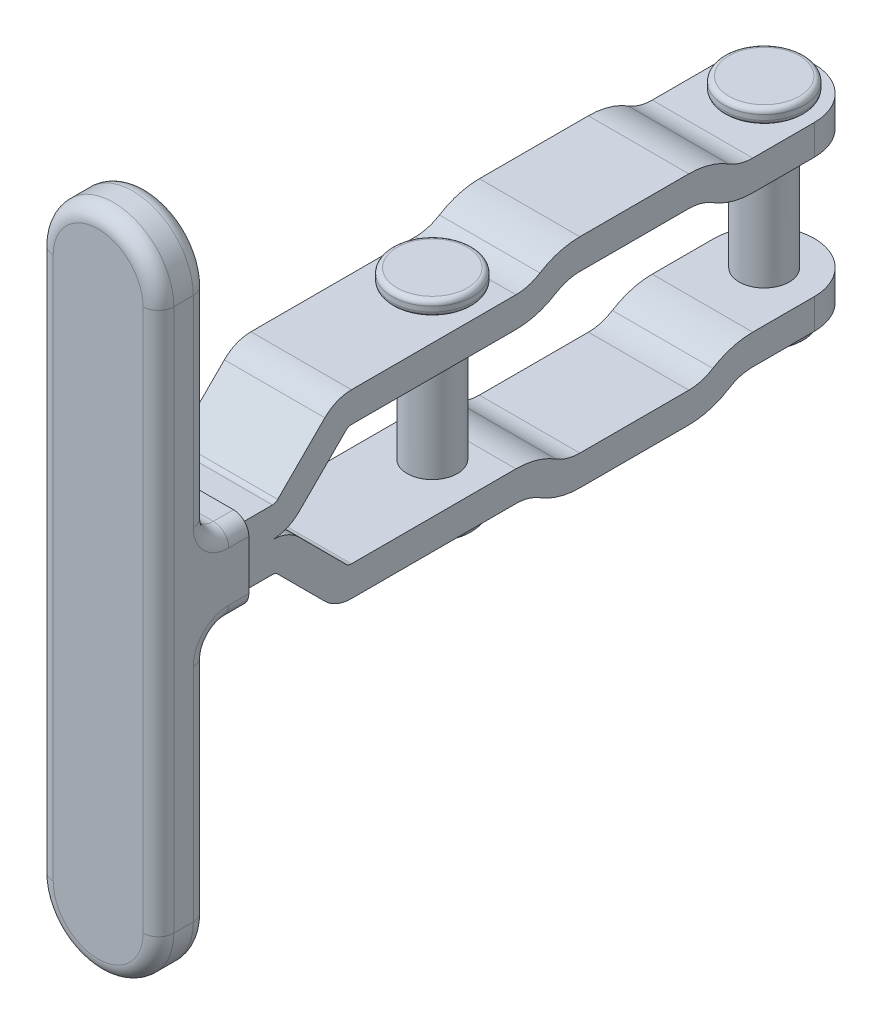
ISO-10303-21;
HEADER;
FILE_DESCRIPTION(('STEP AP214'),'2;1');
FILE_NAME('part.step','',(''),(''),'','','');
FILE_SCHEMA(('AUTOMOTIVE_DESIGN { 1 0 10303 214 1 1 1 1 }'));
ENDSEC;
DATA;
#1=APPLICATION_CONTEXT('core data for automotive mechanical design processes');
#2=APPLICATION_PROTOCOL_DEFINITION('international standard','automotive_design',2000,#1);
#3=PRODUCT_CONTEXT('',#1,'mechanical');
#4=PRODUCT('Part','Part','',(#3));
#5=PRODUCT_RELATED_PRODUCT_CATEGORY('part','',(#4));
#6=PRODUCT_DEFINITION_FORMATION('','',#4);
#7=PRODUCT_DEFINITION_CONTEXT('part definition',#1,'design');
#8=PRODUCT_DEFINITION('design','',#6,#7);
#9=PRODUCT_DEFINITION_SHAPE('','',#8);
#10=(LENGTH_UNIT() NAMED_UNIT(*) SI_UNIT(.MILLI.,.METRE.));
#11=(NAMED_UNIT(*) PLANE_ANGLE_UNIT() SI_UNIT($,.RADIAN.));
#12=(NAMED_UNIT(*) SI_UNIT($,.STERADIAN.) SOLID_ANGLE_UNIT());
#13=UNCERTAINTY_MEASURE_WITH_UNIT(LENGTH_MEASURE(1.E-05),#10,'distance_accuracy_value','');
#14=(GEOMETRIC_REPRESENTATION_CONTEXT(3) GLOBAL_UNCERTAINTY_ASSIGNED_CONTEXT((#13)) GLOBAL_UNIT_ASSIGNED_CONTEXT((#10,
#11,#12)) REPRESENTATION_CONTEXT('',''));
#15=CARTESIAN_POINT('',(0.,0.,0.));
#16=DIRECTION('',(0.,0.,1.));
#17=DIRECTION('',(1.,0.,0.));
#18=AXIS2_PLACEMENT_3D('',#15,#16,#17);
#19=CARTESIAN_POINT('',(0.,-10.5049999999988,0.));
#20=DIRECTION('',(0.,1.,0.));
#21=DIRECTION('',(0.245978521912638,0.,-0.969275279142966));
#22=AXIS2_PLACEMENT_3D('',#19,#20,#21);
#23=PLANE('',#22);
#24=CARTESIAN_POINT('',(0.,-10.5049999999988,0.));
#25=DIRECTION('',(0.,-1.,0.));
#26=DIRECTION('',(0.245978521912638,0.,-0.969275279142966));
#27=AXIS2_PLACEMENT_3D('',#24,#25,#26);
#28=CIRCLE('',#27,3.5);
#29=CARTESIAN_POINT('',(0.860924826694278,-10.5049999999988,-3.39246347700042));
#30=VERTEX_POINT('',#29);
#31=EDGE_CURVE('E1756',#30,#30,#28,.T.);
#32=ORIENTED_EDGE('',*,*,#31,.T.);
#33=EDGE_LOOP('',(#32));
#34=FACE_BOUND('',#33,.T.);
#35=ADVANCED_FACE('F14',(#34),#23,.F.);
#36=CARTESIAN_POINT('',(0.,-10.0049999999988,0.));
#37=DIRECTION('',(0.,1.,0.));
#38=DIRECTION('',(0.245978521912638,0.,-0.969275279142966));
#39=AXIS2_PLACEMENT_3D('',#36,#37,#38);
#40=TOROIDAL_SURFACE('',#39,3.5,0.5);
#41=CARTESIAN_POINT('',(0.,-10.0049999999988,0.));
#42=DIRECTION('',(0.,1.,0.));
#43=DIRECTION('',(0.245978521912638,0.,-0.969275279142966));
#44=AXIS2_PLACEMENT_3D('',#41,#42,#43);
#45=CIRCLE('',#44,4.);
#46=CARTESIAN_POINT('',(0.983914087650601,-10.0049999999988,-3.87710111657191));
#47=VERTEX_POINT('',#46);
#48=EDGE_CURVE('E1747',#47,#47,#45,.T.);
#49=ORIENTED_EDGE('',*,*,#48,.F.);
#50=EDGE_LOOP('',(#49));
#51=FACE_BOUND('',#50,.T.);
#52=ORIENTED_EDGE('',*,*,#31,.F.);
#53=EDGE_LOOP('',(#52));
#54=FACE_BOUND('',#53,.T.);
#55=ADVANCED_FACE('F1698',(#51,#54),#40,.T.);
#56=CARTESIAN_POINT('',(0.,-9.00499999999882,0.));
#57=DIRECTION('',(0.,-1.,0.));
#58=DIRECTION('',(-0.245978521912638,0.,0.969275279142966));
#59=AXIS2_PLACEMENT_3D('',#56,#57,#58);
#60=CYLINDRICAL_SURFACE('',#59,4.);
#61=ORIENTED_EDGE('',*,*,#48,.T.);
#62=EDGE_LOOP('',(#61));
#63=FACE_BOUND('',#62,.T.);
#64=CARTESIAN_POINT('',(0.,-9.50499999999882,0.));
#65=DIRECTION('',(0.,-1.,0.));
#66=DIRECTION('',(0.245978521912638,0.,-0.969275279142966));
#67=AXIS2_PLACEMENT_3D('',#64,#65,#66);
#68=CIRCLE('',#67,4.);
#69=CARTESIAN_POINT('',(0.983914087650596,-9.5049999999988,-3.87710111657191));
#70=VERTEX_POINT('',#69);
#71=EDGE_CURVE('E1738',#70,#70,#68,.T.);
#72=ORIENTED_EDGE('',*,*,#71,.T.);
#73=EDGE_LOOP('',(#72));
#74=FACE_BOUND('',#73,.T.);
#75=ADVANCED_FACE('F1663',(#63,#74),#60,.T.);
#76=CARTESIAN_POINT('',(0.,-9.50499999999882,0.));
#77=DIRECTION('',(0.,1.,0.));
#78=DIRECTION('',(0.245978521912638,0.,-0.969275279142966));
#79=AXIS2_PLACEMENT_3D('',#76,#77,#78);
#80=TOROIDAL_SURFACE('',#79,3.5,0.5);
#81=CARTESIAN_POINT('',(0.,-9.00499999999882,0.));
#82=DIRECTION('',(0.,1.,0.));
#83=DIRECTION('',(0.245978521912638,0.,-0.969275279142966));
#84=AXIS2_PLACEMENT_3D('',#81,#82,#83);
#85=CIRCLE('',#84,3.5);
#86=CARTESIAN_POINT('',(0.86092482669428,-9.00499999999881,-3.39246347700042));
#87=VERTEX_POINT('',#86);
#88=EDGE_CURVE('E1751',#87,#87,#85,.T.);
#89=ORIENTED_EDGE('',*,*,#88,.F.);
#90=EDGE_LOOP('',(#89));
#91=FACE_BOUND('',#90,.T.);
#92=ORIENTED_EDGE('',*,*,#71,.F.);
#93=EDGE_LOOP('',(#92));
#94=FACE_BOUND('',#93,.T.);
#95=ADVANCED_FACE('F1658',(#91,#94),#80,.T.);
#96=CARTESIAN_POINT('',(0.,-9.00399999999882,0.));
#97=DIRECTION('',(0.,-1.,0.));
#98=DIRECTION('',(-0.245978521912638,0.,0.969275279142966));
#99=AXIS2_PLACEMENT_3D('',#96,#97,#98);
#100=CYLINDRICAL_SURFACE('',#99,3.5);
#101=ORIENTED_EDGE('',*,*,#88,.T.);
#102=EDGE_LOOP('',(#101));
#103=FACE_BOUND('',#102,.T.);
#104=CARTESIAN_POINT('',(0.,-9.00399999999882,0.));
#105=DIRECTION('',(0.,1.,0.));
#106=DIRECTION('',(0.245978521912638,0.,-0.969275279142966));
#107=AXIS2_PLACEMENT_3D('',#104,#105,#106);
#108=CIRCLE('',#107,3.5);
#109=CARTESIAN_POINT('',(0.86092482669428,-9.00399999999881,-3.39246347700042));
#110=VERTEX_POINT('',#109);
#111=EDGE_CURVE('E1745',#110,#110,#108,.T.);
#112=ORIENTED_EDGE('',*,*,#111,.F.);
#113=EDGE_LOOP('',(#112));
#114=FACE_BOUND('',#113,.T.);
#115=ADVANCED_FACE('F988',(#103,#114),#100,.T.);
#116=CARTESIAN_POINT('',(0.,10.5050000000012,0.));
#117=DIRECTION('',(0.,-1.,0.));
#118=DIRECTION('',(0.969275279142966,0.,0.245978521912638));
#119=AXIS2_PLACEMENT_3D('',#116,#117,#118);
#120=PLANE('',#119);
#121=CARTESIAN_POINT('',(0.,10.5050000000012,0.));
#122=DIRECTION('',(0.,1.,0.));
#123=DIRECTION('',(-0.245978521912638,0.,0.969275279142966));
#124=AXIS2_PLACEMENT_3D('',#121,#122,#123);
#125=CIRCLE('',#124,3.5);
#126=CARTESIAN_POINT('',(-0.860924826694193,10.5050000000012,3.39246347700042));
#127=VERTEX_POINT('',#126);
#128=EDGE_CURVE('E1740',#127,#127,#125,.T.);
#129=ORIENTED_EDGE('',*,*,#128,.T.);
#130=EDGE_LOOP('',(#129));
#131=FACE_BOUND('',#130,.T.);
#132=ADVANCED_FACE('F1103',(#131),#120,.F.);
#133=CARTESIAN_POINT('',(0.,10.0050000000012,0.));
#134=DIRECTION('',(0.,-1.,0.));
#135=DIRECTION('',(-0.245978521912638,0.,0.969275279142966));
#136=AXIS2_PLACEMENT_3D('',#133,#134,#135);
#137=TOROIDAL_SURFACE('',#136,3.5,0.5);
#138=CARTESIAN_POINT('',(0.,10.0050000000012,0.));
#139=DIRECTION('',(0.,-1.,0.));
#140=DIRECTION('',(-0.245978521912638,0.,0.969275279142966));
#141=AXIS2_PLACEMENT_3D('',#138,#139,#140);
#142=CIRCLE('',#141,4.);
#143=CARTESIAN_POINT('',(-0.983914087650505,10.0050000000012,3.8771011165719));
#144=VERTEX_POINT('',#143);
#145=EDGE_CURVE('E1733',#144,#144,#142,.T.);
#146=ORIENTED_EDGE('',*,*,#145,.F.);
#147=EDGE_LOOP('',(#146));
#148=FACE_BOUND('',#147,.T.);
#149=ORIENTED_EDGE('',*,*,#128,.F.);
#150=EDGE_LOOP('',(#149));
#151=FACE_BOUND('',#150,.T.);
#152=ADVANCED_FACE('F1673',(#148,#151),#137,.T.);
#153=CARTESIAN_POINT('',(0.,9.0050000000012,0.));
#154=DIRECTION('',(0.,1.,0.));
#155=DIRECTION('',(0.245978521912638,0.,-0.969275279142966));
#156=AXIS2_PLACEMENT_3D('',#153,#154,#155);
#157=CYLINDRICAL_SURFACE('',#156,4.);
#158=ORIENTED_EDGE('',*,*,#145,.T.);
#159=EDGE_LOOP('',(#158));
#160=FACE_BOUND('',#159,.T.);
#161=CARTESIAN_POINT('',(0.,9.5050000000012,0.));
#162=DIRECTION('',(0.,1.,0.));
#163=DIRECTION('',(-0.245978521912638,0.,0.969275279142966));
#164=AXIS2_PLACEMENT_3D('',#161,#162,#163);
#165=CIRCLE('',#164,4.);
#166=CARTESIAN_POINT('',(-0.983914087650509,9.50500000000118,3.8771011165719));
#167=VERTEX_POINT('',#166);
#168=EDGE_CURVE('E1729',#167,#167,#165,.T.);
#169=ORIENTED_EDGE('',*,*,#168,.T.);
#170=EDGE_LOOP('',(#169));
#171=FACE_BOUND('',#170,.T.);
#172=ADVANCED_FACE('F1679',(#160,#171),#157,.T.);
#173=CARTESIAN_POINT('',(0.,9.5050000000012,0.));
#174=DIRECTION('',(0.,-1.,0.));
#175=DIRECTION('',(-0.245978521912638,0.,0.969275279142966));
#176=AXIS2_PLACEMENT_3D('',#173,#174,#175);
#177=TOROIDAL_SURFACE('',#176,3.5,0.5);
#178=CARTESIAN_POINT('',(0.,9.0050000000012,0.));
#179=DIRECTION('',(0.,-1.,0.));
#180=DIRECTION('',(-0.245978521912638,0.,0.969275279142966));
#181=AXIS2_PLACEMENT_3D('',#178,#179,#180);
#182=CIRCLE('',#181,3.5);
#183=CARTESIAN_POINT('',(-0.860924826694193,9.00500000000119,3.39246347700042));
#184=VERTEX_POINT('',#183);
#185=EDGE_CURVE('E1744',#184,#184,#182,.T.);
#186=ORIENTED_EDGE('',*,*,#185,.F.);
#187=EDGE_LOOP('',(#186));
#188=FACE_BOUND('',#187,.T.);
#189=ORIENTED_EDGE('',*,*,#168,.F.);
#190=EDGE_LOOP('',(#189));
#191=FACE_BOUND('',#190,.T.);
#192=ADVANCED_FACE('F1684',(#188,#191),#177,.T.);
#193=CARTESIAN_POINT('',(0.,9.0040000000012,0.));
#194=DIRECTION('',(0.,1.,0.));
#195=DIRECTION('',(0.245978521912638,0.,-0.969275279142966));
#196=AXIS2_PLACEMENT_3D('',#193,#194,#195);
#197=CYLINDRICAL_SURFACE('',#196,3.5);
#198=ORIENTED_EDGE('',*,*,#185,.T.);
#199=EDGE_LOOP('',(#198));
#200=FACE_BOUND('',#199,.T.);
#201=CARTESIAN_POINT('',(0.,9.0040000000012,0.));
#202=DIRECTION('',(0.,-1.,0.));
#203=DIRECTION('',(-0.245978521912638,0.,0.969275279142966));
#204=AXIS2_PLACEMENT_3D('',#201,#202,#203);
#205=CIRCLE('',#204,3.5);
#206=CARTESIAN_POINT('',(-0.860924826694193,9.00400000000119,3.39246347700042));
#207=VERTEX_POINT('',#206);
#208=EDGE_CURVE('E2748',#207,#207,#205,.T.);
#209=ORIENTED_EDGE('',*,*,#208,.F.);
#210=EDGE_LOOP('',(#209));
#211=FACE_BOUND('',#210,.T.);
#212=ADVANCED_FACE('F985',(#200,#211),#197,.T.);
#213=CARTESIAN_POINT('',(0.,9.0050000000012,0.));
#214=DIRECTION('',(0.,-1.,0.));
#215=DIRECTION('',(-0.245978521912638,0.,0.969275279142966));
#216=AXIS2_PLACEMENT_3D('',#213,#214,#215);
#217=CYLINDRICAL_SURFACE('',#216,2.5);
#218=CARTESIAN_POINT('',(1.84574577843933E-12,-6.004,4.96130914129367E-13));
#219=DIRECTION('',(0.,1.,0.));
#220=DIRECTION('',(-1.,0.,0.));
#221=AXIS2_PLACEMENT_3D('',#218,#219,#220);
#222=CIRCLE('',#221,2.5);
#223=CARTESIAN_POINT('',(-2.49999999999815,-6.00399999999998,4.96130914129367E-13));
#224=VERTEX_POINT('',#223);
#225=EDGE_CURVE('E9',#224,#224,#222,.T.);
#226=ORIENTED_EDGE('',*,*,#225,.T.);
#227=EDGE_LOOP('',(#226));
#228=FACE_BOUND('',#227,.T.);
#229=CARTESIAN_POINT('',(1.93074722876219E-12,6.004,4.75314232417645E-13));
#230=DIRECTION('',(0.,-1.,0.));
#231=DIRECTION('',(1.,0.,0.));
#232=AXIS2_PLACEMENT_3D('',#229,#230,#231);
#233=CIRCLE('',#232,2.5);
#234=CARTESIAN_POINT('',(2.50000000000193,6.00399999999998,4.75314232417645E-13));
#235=VERTEX_POINT('',#234);
#236=EDGE_CURVE('E31',#235,#235,#233,.T.);
#237=ORIENTED_EDGE('',*,*,#236,.T.);
#238=EDGE_LOOP('',(#237));
#239=FACE_BOUND('',#238,.T.);
#240=ADVANCED_FACE('F974',(#228,#239),#217,.T.);
#241=CARTESIAN_POINT('',(6.00000000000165,-34.,61.2995081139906));
#242=DIRECTION('',(0.,0.,1.));
#243=DIRECTION('',(0.,1.,0.));
#244=AXIS2_PLACEMENT_3D('',#241,#242,#243);
#245=PLANE('',#244);
#246=DIRECTION('',(-1.,0.,0.));
#247=VECTOR('',#246,1.);
#248=CARTESIAN_POINT('',(6.00000000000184,-6.00000000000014,61.2995081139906));
#249=LINE('',#248,#247);
#250=CARTESIAN_POINT('',(4.47000000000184,-6.00000000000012,61.2995081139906));
#251=VERTEX_POINT('',#250);
#252=CARTESIAN_POINT('',(-4.46999999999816,-6.,61.2995081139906));
#253=VERTEX_POINT('',#252);
#254=EDGE_CURVE('E606',#251,#253,#249,.T.);
#255=ORIENTED_EDGE('',*,*,#254,.F.);
#256=DIRECTION('',(0.,-1.,0.));
#257=VECTOR('',#256,1.);
#258=CARTESIAN_POINT('',(4.47000000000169,-28.,61.2995081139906));
#259=LINE('',#258,#257);
#260=CARTESIAN_POINT('',(4.47000000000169,-28.,61.2995081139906));
#261=VERTEX_POINT('',#260);
#262=EDGE_CURVE('E574',#251,#261,#259,.T.);
#263=ORIENTED_EDGE('',*,*,#262,.T.);
#264=CARTESIAN_POINT('',(1.68962066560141E-12,-28.,61.2995081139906));
#265=DIRECTION('',(0.,0.,-1.));
#266=DIRECTION('',(0.,-1.,0.));
#267=AXIS2_PLACEMENT_3D('',#264,#265,#266);
#268=CIRCLE('',#267,4.47);
#269=CARTESIAN_POINT('',(-4.46999999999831,-28.,61.2995081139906));
#270=VERTEX_POINT('',#269);
#271=EDGE_CURVE('E633',#261,#270,#268,.T.);
#272=ORIENTED_EDGE('',*,*,#271,.T.);
#273=DIRECTION('',(0.,1.,0.));
#274=VECTOR('',#273,1.);
#275=CARTESIAN_POINT('',(-4.46999999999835,-34.,61.2995081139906));
#276=LINE('',#275,#274);
#277=EDGE_CURVE('E705',#270,#253,#276,.T.);
#278=ORIENTED_EDGE('',*,*,#277,.T.);
#279=EDGE_LOOP('',(#255,#263,#272,#278));
#280=FACE_BOUND('',#279,.T.);
#281=ADVANCED_FACE('F971',(#280),#245,.F.);
#282=CARTESIAN_POINT('',(6.00000000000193,5.99999999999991,61.2995081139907));
#283=DIRECTION('',(0.,0.,1.));
#284=DIRECTION('',(0.,1.,0.));
#285=AXIS2_PLACEMENT_3D('',#282,#283,#284);
#286=PLANE('',#285);
#287=CARTESIAN_POINT('',(2.07299455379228E-12,26.,61.2995081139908));
#288=DIRECTION('',(0.,0.,-1.));
#289=DIRECTION('',(1.,0.,0.));
#290=AXIS2_PLACEMENT_3D('',#287,#288,#289);
#291=CIRCLE('',#290,4.47);
#292=CARTESIAN_POINT('',(-4.46999999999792,26.,61.2995081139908));
#293=VERTEX_POINT('',#292);
#294=CARTESIAN_POINT('',(4.47000000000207,26.,61.2995081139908));
#295=VERTEX_POINT('',#294);
#296=EDGE_CURVE('E725',#293,#295,#291,.T.);
#297=ORIENTED_EDGE('',*,*,#296,.T.);
#298=DIRECTION('',(0.,-1.,0.));
#299=VECTOR('',#298,1.);
#300=CARTESIAN_POINT('',(4.47000000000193,5.99999999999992,61.2995081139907));
#301=LINE('',#300,#299);
#302=CARTESIAN_POINT('',(4.47000000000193,5.99999999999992,61.2995081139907));
#303=VERTEX_POINT('',#302);
#304=EDGE_CURVE('E721',#295,#303,#301,.T.);
#305=ORIENTED_EDGE('',*,*,#304,.T.);
#306=DIRECTION('',(-1.,0.,0.));
#307=VECTOR('',#306,1.);
#308=CARTESIAN_POINT('',(6.00000000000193,5.99999999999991,61.2995081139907));
#309=LINE('',#308,#307);
#310=CARTESIAN_POINT('',(-4.46999999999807,6.,61.2995081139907));
#311=VERTEX_POINT('',#310);
#312=EDGE_CURVE('E715',#303,#311,#309,.T.);
#313=ORIENTED_EDGE('',*,*,#312,.T.);
#314=DIRECTION('',(0.,1.,0.));
#315=VECTOR('',#314,1.);
#316=CARTESIAN_POINT('',(-4.46999999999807,6.,61.2995081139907));
#317=LINE('',#316,#315);
#318=EDGE_CURVE('E605',#311,#293,#317,.T.);
#319=ORIENTED_EDGE('',*,*,#318,.T.);
#320=EDGE_LOOP('',(#297,#305,#313,#319));
#321=FACE_BOUND('',#320,.T.);
#322=ADVANCED_FACE('F973',(#321),#286,.F.);
#323=CARTESIAN_POINT('',(2.07299455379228E-12,26.,64.7695081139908));
#324=DIRECTION('',(0.,0.,-1.));
#325=DIRECTION('',(0.,1.,0.));
#326=AXIS2_PLACEMENT_3D('',#323,#324,#325);
#327=TOROIDAL_SURFACE('',#326,4.47,1.53);
#328=CARTESIAN_POINT('',(4.47000000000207,26.,64.7695081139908));
#329=DIRECTION('',(0.,1.,0.));
#330=DIRECTION('',(-1.,0.,0.));
#331=AXIS2_PLACEMENT_3D('',#328,#329,#330);
#332=CIRCLE('',#331,1.53);
#333=CARTESIAN_POINT('',(4.47000000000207,26.,66.2995081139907));
#334=VERTEX_POINT('',#333);
#335=CARTESIAN_POINT('',(6.00000000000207,26.,64.7695081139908));
#336=VERTEX_POINT('',#335);
#337=EDGE_CURVE('E589',#334,#336,#332,.T.);
#338=ORIENTED_EDGE('',*,*,#337,.T.);
#339=CARTESIAN_POINT('',(2.07299455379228E-12,26.,64.7695081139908));
#340=DIRECTION('',(0.,0.,-1.));
#341=DIRECTION('',(0.,1.,0.));
#342=AXIS2_PLACEMENT_3D('',#339,#340,#341);
#343=CIRCLE('',#342,6.);
#344=CARTESIAN_POINT('',(-5.99999999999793,26.,64.7695081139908));
#345=VERTEX_POINT('',#344);
#346=EDGE_CURVE('E653',#345,#336,#343,.T.);
#347=ORIENTED_EDGE('',*,*,#346,.F.);
#348=CARTESIAN_POINT('',(-4.46999999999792,26.,64.7695081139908));
#349=DIRECTION('',(0.,1.,0.));
#350=DIRECTION('',(-1.,0.,0.));
#351=AXIS2_PLACEMENT_3D('',#348,#349,#350);
#352=CIRCLE('',#351,1.53);
#353=CARTESIAN_POINT('',(-4.46999999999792,26.,66.2995081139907));
#354=VERTEX_POINT('',#353);
#355=EDGE_CURVE('E700',#345,#354,#352,.T.);
#356=ORIENTED_EDGE('',*,*,#355,.T.);
#357=CARTESIAN_POINT('',(2.07299455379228E-12,26.,66.2995081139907));
#358=DIRECTION('',(0.,0.,1.));
#359=DIRECTION('',(0.,1.,0.));
#360=AXIS2_PLACEMENT_3D('',#357,#358,#359);
#361=CIRCLE('',#360,4.47);
#362=EDGE_CURVE('E578',#334,#354,#361,.T.);
#363=ORIENTED_EDGE('',*,*,#362,.F.);
#364=EDGE_LOOP('',(#338,#347,#356,#363));
#365=FACE_BOUND('',#364,.T.);
#366=ADVANCED_FACE('F982',(#365),#327,.T.);
#367=CARTESIAN_POINT('',(2.07299455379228E-12,26.,62.8295081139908));
#368=DIRECTION('',(0.,0.,1.));
#369=DIRECTION('',(1.,0.,0.));
#370=AXIS2_PLACEMENT_3D('',#367,#368,#369);
#371=TOROIDAL_SURFACE('',#370,4.47,1.53);
#372=CARTESIAN_POINT('',(4.47000000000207,26.,62.8295081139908));
#373=DIRECTION('',(0.,1.,0.));
#374=DIRECTION('',(-1.,0.,0.));
#375=AXIS2_PLACEMENT_3D('',#372,#373,#374);
#376=CIRCLE('',#375,1.53);
#377=CARTESIAN_POINT('',(6.00000000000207,26.,62.8295081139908));
#378=VERTEX_POINT('',#377);
#379=EDGE_CURVE('E672',#378,#295,#376,.T.);
#380=ORIENTED_EDGE('',*,*,#379,.T.);
#381=ORIENTED_EDGE('',*,*,#296,.F.);
#382=CARTESIAN_POINT('',(-4.46999999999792,26.,62.8295081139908));
#383=DIRECTION('',(0.,-1.,0.));
#384=DIRECTION('',(1.,0.,0.));
#385=AXIS2_PLACEMENT_3D('',#382,#383,#384);
#386=CIRCLE('',#385,1.53);
#387=CARTESIAN_POINT('',(-5.99999999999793,26.,62.8295081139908));
#388=VERTEX_POINT('',#387);
#389=EDGE_CURVE('E668',#388,#293,#386,.T.);
#390=ORIENTED_EDGE('',*,*,#389,.F.);
#391=CARTESIAN_POINT('',(2.07299455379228E-12,26.,62.8295081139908));
#392=DIRECTION('',(0.,0.,1.));
#393=DIRECTION('',(1.,0.,0.));
#394=AXIS2_PLACEMENT_3D('',#391,#392,#393);
#395=CIRCLE('',#394,6.);
#396=EDGE_CURVE('E678',#378,#388,#395,.T.);
#397=ORIENTED_EDGE('',*,*,#396,.F.);
#398=EDGE_LOOP('',(#380,#381,#390,#397));
#399=FACE_BOUND('',#398,.T.);
#400=ADVANCED_FACE('F1038',(#399),#371,.T.);
#401=CARTESIAN_POINT('',(6.00000000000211,32.,66.2995081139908));
#402=DIRECTION('',(0.,0.,-1.));
#403=DIRECTION('',(-1.,0.,0.));
#404=AXIS2_PLACEMENT_3D('',#401,#402,#403);
#405=PLANE('',#404);
#406=DIRECTION('',(0.,1.,0.));
#407=VECTOR('',#406,1.);
#408=CARTESIAN_POINT('',(4.47000000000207,26.,66.2995081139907));
#409=LINE('',#408,#407);
#410=CARTESIAN_POINT('',(4.47000000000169,-28.,66.2995081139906));
#411=VERTEX_POINT('',#410);
#412=EDGE_CURVE('E602',#411,#334,#409,.T.);
#413=ORIENTED_EDGE('',*,*,#412,.T.);
#414=ORIENTED_EDGE('',*,*,#362,.T.);
#415=DIRECTION('',(0.,-1.,0.));
#416=VECTOR('',#415,1.);
#417=CARTESIAN_POINT('',(-4.46999999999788,32.,66.2995081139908));
#418=LINE('',#417,#416);
#419=CARTESIAN_POINT('',(-4.46999999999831,-28.,66.2995081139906));
#420=VERTEX_POINT('',#419);
#421=EDGE_CURVE('E573',#354,#420,#418,.T.);
#422=ORIENTED_EDGE('',*,*,#421,.T.);
#423=CARTESIAN_POINT('',(1.68962066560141E-12,-28.,66.2995081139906));
#424=DIRECTION('',(0.,0.,1.));
#425=DIRECTION('',(0.,1.,0.));
#426=AXIS2_PLACEMENT_3D('',#423,#424,#425);
#427=CIRCLE('',#426,4.47);
#428=EDGE_CURVE('E561',#420,#411,#427,.T.);
#429=ORIENTED_EDGE('',*,*,#428,.T.);
#430=EDGE_LOOP('',(#413,#414,#422,#429));
#431=FACE_BOUND('',#430,.T.);
#432=ADVANCED_FACE('F577',(#431),#405,.F.);
#433=CARTESIAN_POINT('',(1.68962066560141E-12,-28.,64.7695081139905));
#434=DIRECTION('',(0.,0.,-1.));
#435=DIRECTION('',(0.,1.,0.));
#436=AXIS2_PLACEMENT_3D('',#433,#434,#435);
#437=TOROIDAL_SURFACE('',#436,4.47,1.53);
#438=CARTESIAN_POINT('',(-4.46999999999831,-28.,64.7695081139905));
#439=DIRECTION('',(0.,1.,0.));
#440=DIRECTION('',(-1.,0.,0.));
#441=AXIS2_PLACEMENT_3D('',#438,#439,#440);
#442=CIRCLE('',#441,1.53);
#443=CARTESIAN_POINT('',(-5.99999999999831,-28.,64.7695081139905));
#444=VERTEX_POINT('',#443);
#445=EDGE_CURVE('E566',#444,#420,#442,.T.);
#446=ORIENTED_EDGE('',*,*,#445,.F.);
#447=CARTESIAN_POINT('',(1.68962066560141E-12,-28.,64.7695081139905));
#448=DIRECTION('',(0.,0.,-1.));
#449=DIRECTION('',(0.,1.,0.));
#450=AXIS2_PLACEMENT_3D('',#447,#448,#449);
#451=CIRCLE('',#450,6.);
#452=CARTESIAN_POINT('',(6.00000000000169,-28.,64.7695081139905));
#453=VERTEX_POINT('',#452);
#454=EDGE_CURVE('E600',#453,#444,#451,.T.);
#455=ORIENTED_EDGE('',*,*,#454,.F.);
#456=CARTESIAN_POINT('',(4.47000000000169,-28.,64.7695081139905));
#457=DIRECTION('',(0.,1.,0.));
#458=DIRECTION('',(-1.,0.,0.));
#459=AXIS2_PLACEMENT_3D('',#456,#457,#458);
#460=CIRCLE('',#459,1.53);
#461=EDGE_CURVE('E568',#411,#453,#460,.T.);
#462=ORIENTED_EDGE('',*,*,#461,.F.);
#463=ORIENTED_EDGE('',*,*,#428,.F.);
#464=EDGE_LOOP('',(#446,#455,#462,#463));
#465=FACE_BOUND('',#464,.T.);
#466=ADVANCED_FACE('F563',(#465),#437,.T.);
#467=CARTESIAN_POINT('',(1.68962066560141E-12,-28.,62.8295081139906));
#468=DIRECTION('',(0.,0.,1.));
#469=DIRECTION('',(0.,-1.,0.));
#470=AXIS2_PLACEMENT_3D('',#467,#468,#469);
#471=TOROIDAL_SURFACE('',#470,4.47,1.53);
#472=CARTESIAN_POINT('',(4.47000000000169,-28.,62.8295081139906));
#473=DIRECTION('',(0.,1.,0.));
#474=DIRECTION('',(-1.,0.,0.));
#475=AXIS2_PLACEMENT_3D('',#472,#473,#474);
#476=CIRCLE('',#475,1.53);
#477=CARTESIAN_POINT('',(6.00000000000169,-28.,62.8295081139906));
#478=VERTEX_POINT('',#477);
#479=EDGE_CURVE('E682',#478,#261,#476,.T.);
#480=ORIENTED_EDGE('',*,*,#479,.F.);
#481=CARTESIAN_POINT('',(1.68962066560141E-12,-28.,62.8295081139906));
#482=DIRECTION('',(0.,0.,1.));
#483=DIRECTION('',(0.,-1.,0.));
#484=AXIS2_PLACEMENT_3D('',#481,#482,#483);
#485=CIRCLE('',#484,6.);
#486=CARTESIAN_POINT('',(-5.99999999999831,-28.,62.8295081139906));
#487=VERTEX_POINT('',#486);
#488=EDGE_CURVE('E701',#487,#478,#485,.T.);
#489=ORIENTED_EDGE('',*,*,#488,.F.);
#490=CARTESIAN_POINT('',(-4.46999999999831,-28.,62.8295081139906));
#491=DIRECTION('',(0.,-1.,0.));
#492=DIRECTION('',(1.,0.,0.));
#493=AXIS2_PLACEMENT_3D('',#490,#491,#492);
#494=CIRCLE('',#493,1.53);
#495=EDGE_CURVE('E696',#487,#270,#494,.T.);
#496=ORIENTED_EDGE('',*,*,#495,.T.);
#497=ORIENTED_EDGE('',*,*,#271,.F.);
#498=EDGE_LOOP('',(#480,#489,#496,#497));
#499=FACE_BOUND('',#498,.T.);
#500=ADVANCED_FACE('F995',(#499),#471,.T.);
#501=CARTESIAN_POINT('',(6.00000000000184,-6.00000000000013,59.2995081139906));
#502=DIRECTION('',(-1.,0.,0.));
#503=DIRECTION('',(0.,-1.,0.));
#504=AXIS2_PLACEMENT_3D('',#501,#502,#503);
#505=CYLINDRICAL_SURFACE('',#504,2.);
#506=DIRECTION('',(-1.,0.,0.));
#507=VECTOR('',#506,1.);
#508=CARTESIAN_POINT('',(6.00000000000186,-4.00000000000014,59.2995081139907));
#509=LINE('',#508,#507);
#510=CARTESIAN_POINT('',(4.47000000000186,-4.00000000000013,59.2995081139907));
#511=VERTEX_POINT('',#510);
#512=CARTESIAN_POINT('',(-4.46999999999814,-4.00000000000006,59.2995081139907));
#513=VERTEX_POINT('',#512);
#514=EDGE_CURVE('E654',#511,#513,#509,.T.);
#515=ORIENTED_EDGE('',*,*,#514,.F.);
#516=CARTESIAN_POINT('',(4.47000000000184,-6.00000000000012,59.2995081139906));
#517=DIRECTION('',(1.,0.,0.));
#518=DIRECTION('',(0.,1.,0.));
#519=AXIS2_PLACEMENT_3D('',#516,#517,#518);
#520=CIRCLE('',#519,2.);
#521=EDGE_CURVE('E610',#511,#251,#520,.T.);
#522=ORIENTED_EDGE('',*,*,#521,.T.);
#523=ORIENTED_EDGE('',*,*,#254,.T.);
#524=CARTESIAN_POINT('',(-4.46999999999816,-6.,59.2995081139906));
#525=DIRECTION('',(-1.,0.,0.));
#526=DIRECTION('',(0.,1.,0.));
#527=AXIS2_PLACEMENT_3D('',#524,#525,#526);
#528=CIRCLE('',#527,2.);
#529=EDGE_CURVE('E611',#253,#513,#528,.T.);
#530=ORIENTED_EDGE('',*,*,#529,.T.);
#531=EDGE_LOOP('',(#515,#522,#523,#530));
#532=FACE_BOUND('',#531,.T.);
#533=ADVANCED_FACE('F1025',(#532),#505,.F.);
#534=CARTESIAN_POINT('',(4.47000000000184,-6.00000000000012,59.2995081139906));
#535=DIRECTION('',(1.,0.,0.));
#536=DIRECTION('',(0.,1.,0.));
#537=AXIS2_PLACEMENT_3D('',#534,#535,#536);
#538=TOROIDAL_SURFACE('',#537,3.53,1.53);
#539=CARTESIAN_POINT('',(4.47000000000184,-6.00000000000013,62.8295081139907));
#540=DIRECTION('',(0.,1.,0.));
#541=DIRECTION('',(-1.,0.,0.));
#542=AXIS2_PLACEMENT_3D('',#539,#540,#541);
#543=CIRCLE('',#542,1.53);
#544=CARTESIAN_POINT('',(6.00000000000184,-6.00000000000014,62.8295081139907));
#545=VERTEX_POINT('',#544);
#546=EDGE_CURVE('E687',#545,#251,#543,.T.);
#547=ORIENTED_EDGE('',*,*,#546,.T.);
#548=ORIENTED_EDGE('',*,*,#521,.F.);
#549=CARTESIAN_POINT('',(4.47000000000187,-2.47000000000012,59.2995081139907));
#550=DIRECTION('',(0.,0.,-1.));
#551=DIRECTION('',(-1.,0.,0.));
#552=AXIS2_PLACEMENT_3D('',#549,#550,#551);
#553=CIRCLE('',#552,1.53);
#554=CARTESIAN_POINT('',(6.00000000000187,-2.47000000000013,59.2995081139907));
#555=VERTEX_POINT('',#554);
#556=EDGE_CURVE('E594',#555,#511,#553,.T.);
#557=ORIENTED_EDGE('',*,*,#556,.F.);
#558=CARTESIAN_POINT('',(6.00000000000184,-6.00000000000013,59.2995081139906));
#559=DIRECTION('',(-1.,0.,0.));
#560=DIRECTION('',(0.,1.,0.));
#561=AXIS2_PLACEMENT_3D('',#558,#559,#560);
#562=CIRCLE('',#561,3.53);
#563=EDGE_CURVE('E765',#545,#555,#562,.T.);
#564=ORIENTED_EDGE('',*,*,#563,.F.);
#565=EDGE_LOOP('',(#547,#548,#557,#564));
#566=FACE_BOUND('',#565,.T.);
#567=ADVANCED_FACE('F1022',(#566),#538,.T.);
#568=CARTESIAN_POINT('',(4.47000000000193,5.99999999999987,62.8295081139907));
#569=DIRECTION('',(0.,-1.,0.));
#570=DIRECTION('',(0.,0.,-1.));
#571=AXIS2_PLACEMENT_3D('',#568,#569,#570);
#572=CYLINDRICAL_SURFACE('',#571,1.53);
#573=ORIENTED_EDGE('',*,*,#479,.T.);
#574=ORIENTED_EDGE('',*,*,#262,.F.);
#575=ORIENTED_EDGE('',*,*,#546,.F.);
#576=DIRECTION('',(0.,1.,0.));
#577=VECTOR('',#576,1.);
#578=CARTESIAN_POINT('',(6.00000000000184,-6.00000000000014,62.8295081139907));
#579=LINE('',#578,#577);
#580=EDGE_CURVE('E760',#478,#545,#579,.T.);
#581=ORIENTED_EDGE('',*,*,#580,.F.);
#582=EDGE_LOOP('',(#573,#574,#575,#581));
#583=FACE_BOUND('',#582,.T.);
#584=ADVANCED_FACE('F16',(#583),#572,.T.);
#585=CARTESIAN_POINT('',(4.47000000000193,5.99999999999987,64.7695081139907));
#586=DIRECTION('',(0.,1.,0.));
#587=DIRECTION('',(0.,0.,1.));
#588=AXIS2_PLACEMENT_3D('',#585,#586,#587);
#589=CYLINDRICAL_SURFACE('',#588,1.53);
#590=ORIENTED_EDGE('',*,*,#461,.T.);
#591=DIRECTION('',(0.,-1.,0.));
#592=VECTOR('',#591,1.);
#593=CARTESIAN_POINT('',(6.00000000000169,-28.,64.7695081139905));
#594=LINE('',#593,#592);
#595=EDGE_CURVE('E770',#336,#453,#594,.T.);
#596=ORIENTED_EDGE('',*,*,#595,.F.);
#597=ORIENTED_EDGE('',*,*,#337,.F.);
#598=ORIENTED_EDGE('',*,*,#412,.F.);
#599=EDGE_LOOP('',(#590,#596,#597,#598));
#600=FACE_BOUND('',#599,.T.);
#601=ADVANCED_FACE('F996',(#600),#589,.T.);
#602=CARTESIAN_POINT('',(4.47000000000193,5.99999999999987,62.8295081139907));
#603=DIRECTION('',(0.,-1.,0.));
#604=DIRECTION('',(1.,0.,0.));
#605=AXIS2_PLACEMENT_3D('',#602,#603,#604);
#606=CYLINDRICAL_SURFACE('',#605,1.53);
#607=CARTESIAN_POINT('',(4.47000000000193,5.99999999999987,62.8295081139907));
#608=DIRECTION('',(0.,1.,0.));
#609=DIRECTION('',(-1.,0.,0.));
#610=AXIS2_PLACEMENT_3D('',#607,#608,#609);
#611=CIRCLE('',#610,1.53);
#612=CARTESIAN_POINT('',(6.00000000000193,5.99999999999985,62.8295081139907));
#613=VERTEX_POINT('',#612);
#614=EDGE_CURVE('E716',#613,#303,#611,.T.);
#615=ORIENTED_EDGE('',*,*,#614,.T.);
#616=ORIENTED_EDGE('',*,*,#304,.F.);
#617=ORIENTED_EDGE('',*,*,#379,.F.);
#618=DIRECTION('',(0.,1.,0.));
#619=VECTOR('',#618,1.);
#620=CARTESIAN_POINT('',(6.00000000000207,26.,62.8295081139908));
#621=LINE('',#620,#619);
#622=EDGE_CURVE('E617',#613,#378,#621,.T.);
#623=ORIENTED_EDGE('',*,*,#622,.F.);
#624=EDGE_LOOP('',(#615,#616,#617,#623));
#625=FACE_BOUND('',#624,.T.);
#626=ADVANCED_FACE('F999',(#625),#606,.T.);
#627=CARTESIAN_POINT('',(4.47000000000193,5.99999999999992,59.2995081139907));
#628=DIRECTION('',(1.,0.,0.));
#629=DIRECTION('',(0.,1.,0.));
#630=AXIS2_PLACEMENT_3D('',#627,#628,#629);
#631=TOROIDAL_SURFACE('',#630,3.53,1.53);
#632=CARTESIAN_POINT('',(4.4700000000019,2.46999999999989,59.2995081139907));
#633=DIRECTION('',(0.,0.,1.));
#634=DIRECTION('',(0.,-1.,0.));
#635=AXIS2_PLACEMENT_3D('',#632,#633,#634);
#636=CIRCLE('',#635,1.53);
#637=CARTESIAN_POINT('',(6.00000000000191,2.46999999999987,59.2995081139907));
#638=VERTEX_POINT('',#637);
#639=CARTESIAN_POINT('',(4.47000000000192,3.99999999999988,59.2995081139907));
#640=VERTEX_POINT('',#639);
#641=EDGE_CURVE('E720',#638,#640,#636,.T.);
#642=ORIENTED_EDGE('',*,*,#641,.T.);
#643=CARTESIAN_POINT('',(4.47000000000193,5.99999999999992,59.2995081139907));
#644=DIRECTION('',(1.,0.,0.));
#645=DIRECTION('',(0.,1.,0.));
#646=AXIS2_PLACEMENT_3D('',#643,#644,#645);
#647=CIRCLE('',#646,2.);
#648=EDGE_CURVE('E641',#303,#640,#647,.T.);
#649=ORIENTED_EDGE('',*,*,#648,.F.);
#650=ORIENTED_EDGE('',*,*,#614,.F.);
#651=CARTESIAN_POINT('',(6.00000000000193,5.99999999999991,59.2995081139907));
#652=DIRECTION('',(-1.,0.,0.));
#653=DIRECTION('',(0.,1.,0.));
#654=AXIS2_PLACEMENT_3D('',#651,#652,#653);
#655=CIRCLE('',#654,3.53);
#656=EDGE_CURVE('E621',#638,#613,#655,.T.);
#657=ORIENTED_EDGE('',*,*,#656,.F.);
#658=EDGE_LOOP('',(#642,#649,#650,#657));
#659=FACE_BOUND('',#658,.T.);
#660=ADVANCED_FACE('F1003',(#659),#631,.T.);
#661=CARTESIAN_POINT('',(6.00000000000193,5.99999999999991,59.2995081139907));
#662=DIRECTION('',(-1.,0.,0.));
#663=DIRECTION('',(0.,-1.,0.));
#664=AXIS2_PLACEMENT_3D('',#661,#662,#663);
#665=CYLINDRICAL_SURFACE('',#664,2.);
#666=ORIENTED_EDGE('',*,*,#312,.F.);
#667=ORIENTED_EDGE('',*,*,#648,.T.);
#668=DIRECTION('',(-1.,0.,0.));
#669=VECTOR('',#668,1.);
#670=CARTESIAN_POINT('',(6.00000000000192,3.99999999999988,59.2995081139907));
#671=LINE('',#670,#669);
#672=CARTESIAN_POINT('',(-4.46999999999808,3.99999999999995,59.2995081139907));
#673=VERTEX_POINT('',#672);
#674=EDGE_CURVE('E637',#640,#673,#671,.T.);
#675=ORIENTED_EDGE('',*,*,#674,.T.);
#676=CARTESIAN_POINT('',(-4.46999999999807,6.,59.2995081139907));
#677=DIRECTION('',(-1.,0.,0.));
#678=DIRECTION('',(0.,1.,0.));
#679=AXIS2_PLACEMENT_3D('',#676,#677,#678);
#680=CIRCLE('',#679,2.);
#681=EDGE_CURVE('E642',#673,#311,#680,.T.);
#682=ORIENTED_EDGE('',*,*,#681,.T.);
#683=EDGE_LOOP('',(#666,#667,#675,#682));
#684=FACE_BOUND('',#683,.T.);
#685=ADVANCED_FACE('F1080',(#684),#665,.F.);
#686=CARTESIAN_POINT('',(-4.46999999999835,-34.,62.8295081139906));
#687=DIRECTION('',(0.,1.,0.));
#688=DIRECTION('',(0.,0.,1.));
#689=AXIS2_PLACEMENT_3D('',#686,#687,#688);
#690=CYLINDRICAL_SURFACE('',#689,1.53);
#691=CARTESIAN_POINT('',(-4.46999999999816,-6.00000000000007,62.8295081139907));
#692=DIRECTION('',(0.,-1.,0.));
#693=DIRECTION('',(1.,0.,0.));
#694=AXIS2_PLACEMENT_3D('',#691,#692,#693);
#695=CIRCLE('',#694,1.53);
#696=CARTESIAN_POINT('',(-5.99999999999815,-6.,62.8295081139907));
#697=VERTEX_POINT('',#696);
#698=EDGE_CURVE('E686',#697,#253,#695,.T.);
#699=ORIENTED_EDGE('',*,*,#698,.T.);
#700=ORIENTED_EDGE('',*,*,#277,.F.);
#701=ORIENTED_EDGE('',*,*,#495,.F.);
#702=DIRECTION('',(0.,-1.,0.));
#703=VECTOR('',#702,1.);
#704=CARTESIAN_POINT('',(-5.99999999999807,6.,62.8295081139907));
#705=LINE('',#704,#703);
#706=EDGE_CURVE('E766',#697,#487,#705,.T.);
#707=ORIENTED_EDGE('',*,*,#706,.F.);
#708=EDGE_LOOP('',(#699,#700,#701,#707));
#709=FACE_BOUND('',#708,.T.);
#710=ADVANCED_FACE('F1015',(#709),#690,.T.);
#711=CARTESIAN_POINT('',(-4.46999999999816,-6.,59.2995081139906));
#712=DIRECTION('',(1.,0.,0.));
#713=DIRECTION('',(0.,1.,0.));
#714=AXIS2_PLACEMENT_3D('',#711,#712,#713);
#715=TOROIDAL_SURFACE('',#714,3.53,1.53);
#716=CARTESIAN_POINT('',(-4.46999999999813,-2.47000000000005,59.2995081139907));
#717=DIRECTION('',(0.,0.,1.));
#718=DIRECTION('',(1.,0.,0.));
#719=AXIS2_PLACEMENT_3D('',#716,#717,#718);
#720=CIRCLE('',#719,1.53);
#721=CARTESIAN_POINT('',(-5.99999999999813,-2.47000000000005,59.2995081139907));
#722=VERTEX_POINT('',#721);
#723=EDGE_CURVE('E648',#722,#513,#720,.T.);
#724=ORIENTED_EDGE('',*,*,#723,.T.);
#725=ORIENTED_EDGE('',*,*,#529,.F.);
#726=ORIENTED_EDGE('',*,*,#698,.F.);
#727=CARTESIAN_POINT('',(-5.99999999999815,-6.,59.2995081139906));
#728=DIRECTION('',(1.,0.,0.));
#729=DIRECTION('',(0.,1.,0.));
#730=AXIS2_PLACEMENT_3D('',#727,#728,#729);
#731=CIRCLE('',#730,3.53);
#732=EDGE_CURVE('E756',#722,#697,#731,.T.);
#733=ORIENTED_EDGE('',*,*,#732,.F.);
#734=EDGE_LOOP('',(#724,#725,#726,#733));
#735=FACE_BOUND('',#734,.T.);
#736=ADVANCED_FACE('F1011',(#735),#715,.T.);
#737=CARTESIAN_POINT('',(-4.46999999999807,6.,59.2995081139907));
#738=DIRECTION('',(1.,0.,0.));
#739=DIRECTION('',(0.,1.,0.));
#740=AXIS2_PLACEMENT_3D('',#737,#738,#739);
#741=TOROIDAL_SURFACE('',#740,3.53,1.53);
#742=CARTESIAN_POINT('',(-4.46999999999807,5.99999999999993,62.8295081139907));
#743=DIRECTION('',(0.,-1.,0.));
#744=DIRECTION('',(1.,0.,0.));
#745=AXIS2_PLACEMENT_3D('',#742,#743,#744);
#746=CIRCLE('',#745,1.53);
#747=CARTESIAN_POINT('',(-5.99999999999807,6.,62.8295081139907));
#748=VERTEX_POINT('',#747);
#749=EDGE_CURVE('E647',#748,#311,#746,.T.);
#750=ORIENTED_EDGE('',*,*,#749,.T.);
#751=ORIENTED_EDGE('',*,*,#681,.F.);
#752=CARTESIAN_POINT('',(-4.4699999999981,2.46999999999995,59.2995081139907));
#753=DIRECTION('',(0.,0.,-1.));
#754=DIRECTION('',(0.,1.,0.));
#755=AXIS2_PLACEMENT_3D('',#752,#753,#754);
#756=CIRCLE('',#755,1.53);
#757=CARTESIAN_POINT('',(-5.99999999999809,2.46999999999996,59.2995081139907));
#758=VERTEX_POINT('',#757);
#759=EDGE_CURVE('E643',#758,#673,#756,.T.);
#760=ORIENTED_EDGE('',*,*,#759,.F.);
#761=CARTESIAN_POINT('',(-5.99999999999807,6.,59.2995081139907));
#762=DIRECTION('',(1.,0.,0.));
#763=DIRECTION('',(0.,1.,0.));
#764=AXIS2_PLACEMENT_3D('',#761,#762,#763);
#765=CIRCLE('',#764,3.53);
#766=EDGE_CURVE('E658',#748,#758,#765,.T.);
#767=ORIENTED_EDGE('',*,*,#766,.F.);
#768=EDGE_LOOP('',(#750,#751,#760,#767));
#769=FACE_BOUND('',#768,.T.);
#770=ADVANCED_FACE('F1014',(#769),#741,.T.);
#771=CARTESIAN_POINT('',(-4.46999999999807,5.99999999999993,62.8295081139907));
#772=DIRECTION('',(0.,1.,0.));
#773=DIRECTION('',(-1.,0.,0.));
#774=AXIS2_PLACEMENT_3D('',#771,#772,#773);
#775=CYLINDRICAL_SURFACE('',#774,1.53);
#776=ORIENTED_EDGE('',*,*,#389,.T.);
#777=ORIENTED_EDGE('',*,*,#318,.F.);
#778=ORIENTED_EDGE('',*,*,#749,.F.);
#779=DIRECTION('',(0.,-1.,0.));
#780=VECTOR('',#779,1.);
#781=CARTESIAN_POINT('',(-5.99999999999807,6.,62.8295081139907));
#782=LINE('',#781,#780);
#783=EDGE_CURVE('E662',#388,#748,#782,.T.);
#784=ORIENTED_EDGE('',*,*,#783,.F.);
#785=EDGE_LOOP('',(#776,#777,#778,#784));
#786=FACE_BOUND('',#785,.T.);
#787=ADVANCED_FACE('F1055',(#786),#775,.T.);
#788=CARTESIAN_POINT('',(2.07299455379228E-12,26.,61.2995081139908));
#789=DIRECTION('',(0.,0.,1.));
#790=DIRECTION('',(1.,0.,0.));
#791=AXIS2_PLACEMENT_3D('',#788,#789,#790);
#792=CYLINDRICAL_SURFACE('',#791,6.);
#793=DIRECTION('',(0.,0.,1.));
#794=VECTOR('',#793,1.);
#795=CARTESIAN_POINT('',(6.00000000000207,26.,61.2995081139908));
#796=LINE('',#795,#794);
#797=EDGE_CURVE('E622',#378,#336,#796,.T.);
#798=ORIENTED_EDGE('',*,*,#797,.F.);
#799=ORIENTED_EDGE('',*,*,#396,.T.);
#800=DIRECTION('',(0.,0.,-1.));
#801=VECTOR('',#800,1.);
#802=CARTESIAN_POINT('',(-5.99999999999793,26.,59.2995081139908));
#803=LINE('',#802,#801);
#804=EDGE_CURVE('E625',#345,#388,#803,.T.);
#805=ORIENTED_EDGE('',*,*,#804,.F.);
#806=ORIENTED_EDGE('',*,*,#346,.T.);
#807=EDGE_LOOP('',(#798,#799,#805,#806));
#808=FACE_BOUND('',#807,.T.);
#809=ADVANCED_FACE('F1050',(#808),#792,.T.);
#810=CARTESIAN_POINT('',(-4.46999999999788,32.,64.7695081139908));
#811=DIRECTION('',(0.,-1.,0.));
#812=DIRECTION('',(0.,0.,-1.));
#813=AXIS2_PLACEMENT_3D('',#810,#811,#812);
#814=CYLINDRICAL_SURFACE('',#813,1.53);
#815=ORIENTED_EDGE('',*,*,#445,.T.);
#816=ORIENTED_EDGE('',*,*,#421,.F.);
#817=ORIENTED_EDGE('',*,*,#355,.F.);
#818=DIRECTION('',(0.,1.,0.));
#819=VECTOR('',#818,1.);
#820=CARTESIAN_POINT('',(-5.99999999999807,6.,64.7695081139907));
#821=LINE('',#820,#819);
#822=EDGE_CURVE('E586',#444,#345,#821,.T.);
#823=ORIENTED_EDGE('',*,*,#822,.F.);
#824=EDGE_LOOP('',(#815,#816,#817,#823));
#825=FACE_BOUND('',#824,.T.);
#826=ADVANCED_FACE('F584',(#825),#814,.T.);
#827=CARTESIAN_POINT('',(1.68962066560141E-12,-28.,61.2995081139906));
#828=DIRECTION('',(0.,0.,-1.));
#829=DIRECTION('',(-1.,0.,0.));
#830=AXIS2_PLACEMENT_3D('',#827,#828,#829);
#831=CYLINDRICAL_SURFACE('',#830,6.);
#832=DIRECTION('',(0.,0.,1.));
#833=VECTOR('',#832,1.);
#834=CARTESIAN_POINT('',(-5.99999999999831,-28.,59.2995081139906));
#835=LINE('',#834,#833);
#836=EDGE_CURVE('E624',#487,#444,#835,.T.);
#837=ORIENTED_EDGE('',*,*,#836,.F.);
#838=ORIENTED_EDGE('',*,*,#488,.T.);
#839=DIRECTION('',(0.,0.,-1.));
#840=VECTOR('',#839,1.);
#841=CARTESIAN_POINT('',(6.00000000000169,-28.,61.2995081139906));
#842=LINE('',#841,#840);
#843=EDGE_CURVE('E764',#453,#478,#842,.T.);
#844=ORIENTED_EDGE('',*,*,#843,.F.);
#845=ORIENTED_EDGE('',*,*,#454,.T.);
#846=EDGE_LOOP('',(#837,#838,#844,#845));
#847=FACE_BOUND('',#846,.T.);
#848=ADVANCED_FACE('F1017',(#847),#831,.T.);
#849=CARTESIAN_POINT('',(-4.46999999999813,-2.47000000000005,59.2995081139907));
#850=DIRECTION('',(0.,0.,-1.));
#851=DIRECTION('',(-1.,0.,0.));
#852=AXIS2_PLACEMENT_3D('',#849,#850,#851);
#853=CYLINDRICAL_SURFACE('',#852,1.53);
#854=CARTESIAN_POINT('',(-4.46999999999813,-2.47000000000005,57.2995081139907));
#855=DIRECTION('',(0.,0.,-1.));
#856=DIRECTION('',(1.,0.,0.));
#857=AXIS2_PLACEMENT_3D('',#854,#855,#856);
#858=CIRCLE('',#857,1.53);
#859=CARTESIAN_POINT('',(-4.46999999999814,-4.00000000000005,57.2995081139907));
#860=VERTEX_POINT('',#859);
#861=CARTESIAN_POINT('',(-5.99999999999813,-2.47000000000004,57.2995081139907));
#862=VERTEX_POINT('',#861);
#863=EDGE_CURVE('E612',#860,#862,#858,.T.);
#864=ORIENTED_EDGE('',*,*,#863,.F.);
#865=DIRECTION('',(0.,0.,-1.));
#866=VECTOR('',#865,1.);
#867=CARTESIAN_POINT('',(-4.46999999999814,-4.00000000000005,59.2995081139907));
#868=LINE('',#867,#866);
#869=EDGE_CURVE('E673',#513,#860,#868,.T.);
#870=ORIENTED_EDGE('',*,*,#869,.F.);
#871=ORIENTED_EDGE('',*,*,#723,.F.);
#872=DIRECTION('',(0.,0.,1.));
#873=VECTOR('',#872,1.);
#874=CARTESIAN_POINT('',(-5.99999999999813,-2.47000000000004,59.2995081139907));
#875=LINE('',#874,#873);
#876=EDGE_CURVE('E752',#862,#722,#875,.T.);
#877=ORIENTED_EDGE('',*,*,#876,.F.);
#878=EDGE_LOOP('',(#864,#870,#871,#877));
#879=FACE_BOUND('',#878,.T.);
#880=ADVANCED_FACE('F1020',(#879),#853,.T.);
#881=CARTESIAN_POINT('',(6.00000000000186,-4.00000000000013,59.2995081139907));
#882=DIRECTION('',(0.,1.,0.));
#883=DIRECTION('',(0.,0.,1.));
#884=AXIS2_PLACEMENT_3D('',#881,#882,#883);
#885=PLANE('',#884);
#886=DIRECTION('',(-1.,0.,0.));
#887=VECTOR('',#886,1.);
#888=CARTESIAN_POINT('',(6.00000000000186,-4.00000000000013,57.2995081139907));
#889=LINE('',#888,#887);
#890=CARTESIAN_POINT('',(4.47000000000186,-4.00000000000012,57.2995081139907));
#891=VERTEX_POINT('',#890);
#892=EDGE_CURVE('E615',#891,#860,#889,.T.);
#893=ORIENTED_EDGE('',*,*,#892,.F.);
#894=DIRECTION('',(0.,0.,1.));
#895=VECTOR('',#894,1.);
#896=CARTESIAN_POINT('',(4.47000000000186,-4.00000000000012,59.2995081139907));
#897=LINE('',#896,#895);
#898=EDGE_CURVE('E649',#891,#511,#897,.T.);
#899=ORIENTED_EDGE('',*,*,#898,.T.);
#900=ORIENTED_EDGE('',*,*,#514,.T.);
#901=ORIENTED_EDGE('',*,*,#869,.T.);
#902=EDGE_LOOP('',(#893,#899,#900,#901));
#903=FACE_BOUND('',#902,.T.);
#904=ADVANCED_FACE('F1031',(#903),#885,.F.);
#905=CARTESIAN_POINT('',(4.47000000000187,-2.47000000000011,59.2995081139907));
#906=DIRECTION('',(0.,0.,1.));
#907=DIRECTION('',(1.,0.,0.));
#908=AXIS2_PLACEMENT_3D('',#905,#906,#907);
#909=CYLINDRICAL_SURFACE('',#908,1.53);
#910=ORIENTED_EDGE('',*,*,#556,.T.);
#911=ORIENTED_EDGE('',*,*,#898,.F.);
#912=CARTESIAN_POINT('',(4.47000000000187,-2.47000000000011,57.2995081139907));
#913=DIRECTION('',(0.,0.,-1.));
#914=DIRECTION('',(1.,0.,0.));
#915=AXIS2_PLACEMENT_3D('',#912,#913,#914);
#916=CIRCLE('',#915,1.53);
#917=CARTESIAN_POINT('',(6.00000000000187,-2.47000000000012,57.2995081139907));
#918=VERTEX_POINT('',#917);
#919=EDGE_CURVE('E690',#918,#891,#916,.T.);
#920=ORIENTED_EDGE('',*,*,#919,.F.);
#921=DIRECTION('',(0.,0.,-1.));
#922=VECTOR('',#921,1.);
#923=CARTESIAN_POINT('',(6.00000000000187,-2.47000000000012,57.2995081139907));
#924=LINE('',#923,#922);
#925=EDGE_CURVE('E657',#555,#918,#924,.T.);
#926=ORIENTED_EDGE('',*,*,#925,.F.);
#927=EDGE_LOOP('',(#910,#911,#920,#926));
#928=FACE_BOUND('',#927,.T.);
#929=ADVANCED_FACE('F1027',(#928),#909,.T.);
#930=CARTESIAN_POINT('',(6.00000000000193,5.99999999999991,59.2995081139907));
#931=DIRECTION('',(1.,0.,0.));
#932=DIRECTION('',(0.,1.,0.));
#933=AXIS2_PLACEMENT_3D('',#930,#931,#932);
#934=PLANE('',#933);
#935=DIRECTION('',(0.,1.,0.));
#936=VECTOR('',#935,1.);
#937=CARTESIAN_POINT('',(6.00000000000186,-4.00000000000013,57.2995081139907));
#938=LINE('',#937,#936);
#939=CARTESIAN_POINT('',(6.00000000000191,2.46999999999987,57.2995081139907));
#940=VERTEX_POINT('',#939);
#941=EDGE_CURVE('E636',#918,#940,#938,.T.);
#942=ORIENTED_EDGE('',*,*,#941,.T.);
#943=DIRECTION('',(0.,0.,1.));
#944=VECTOR('',#943,1.);
#945=CARTESIAN_POINT('',(6.00000000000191,2.46999999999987,59.2995081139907));
#946=LINE('',#945,#944);
#947=EDGE_CURVE('E667',#940,#638,#946,.T.);
#948=ORIENTED_EDGE('',*,*,#947,.T.);
#949=ORIENTED_EDGE('',*,*,#656,.T.);
#950=ORIENTED_EDGE('',*,*,#622,.T.);
#951=ORIENTED_EDGE('',*,*,#797,.T.);
#952=ORIENTED_EDGE('',*,*,#595,.T.);
#953=ORIENTED_EDGE('',*,*,#843,.T.);
#954=ORIENTED_EDGE('',*,*,#580,.T.);
#955=ORIENTED_EDGE('',*,*,#563,.T.);
#956=ORIENTED_EDGE('',*,*,#925,.T.);
#957=EDGE_LOOP('',(#942,#948,#949,#950,#951,#952,#953,#954,#955,#956));
#958=FACE_BOUND('',#957,.T.);
#959=ADVANCED_FACE('F1030',(#958),#934,.T.);
#960=CARTESIAN_POINT('',(4.4700000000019,2.46999999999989,59.2995081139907));
#961=DIRECTION('',(0.,0.,-1.));
#962=DIRECTION('',(0.,1.,0.));
#963=AXIS2_PLACEMENT_3D('',#960,#961,#962);
#964=CYLINDRICAL_SURFACE('',#963,1.53);
#965=CARTESIAN_POINT('',(4.4700000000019,2.46999999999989,57.2995081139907));
#966=DIRECTION('',(0.,0.,-1.));
#967=DIRECTION('',(1.,0.,0.));
#968=AXIS2_PLACEMENT_3D('',#965,#966,#967);
#969=CIRCLE('',#968,1.53);
#970=CARTESIAN_POINT('',(4.47000000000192,3.99999999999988,57.2995081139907));
#971=VERTEX_POINT('',#970);
#972=EDGE_CURVE('E695',#971,#940,#969,.T.);
#973=ORIENTED_EDGE('',*,*,#972,.F.);
#974=DIRECTION('',(0.,0.,-1.));
#975=VECTOR('',#974,1.);
#976=CARTESIAN_POINT('',(4.47000000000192,3.99999999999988,57.2995081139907));
#977=LINE('',#976,#975);
#978=EDGE_CURVE('E711',#640,#971,#977,.T.);
#979=ORIENTED_EDGE('',*,*,#978,.F.);
#980=ORIENTED_EDGE('',*,*,#641,.F.);
#981=ORIENTED_EDGE('',*,*,#947,.F.);
#982=EDGE_LOOP('',(#973,#979,#980,#981));
#983=FACE_BOUND('',#982,.T.);
#984=ADVANCED_FACE('F1043',(#983),#964,.T.);
#985=CARTESIAN_POINT('',(6.00000000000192,3.99999999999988,57.2995081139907));
#986=DIRECTION('',(0.,-1.,0.));
#987=DIRECTION('',(1.,0.,0.));
#988=AXIS2_PLACEMENT_3D('',#985,#986,#987);
#989=PLANE('',#988);
#990=DIRECTION('',(-1.,0.,0.));
#991=VECTOR('',#990,1.);
#992=CARTESIAN_POINT('',(6.00000000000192,3.99999999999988,57.2995081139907));
#993=LINE('',#992,#991);
#994=CARTESIAN_POINT('',(-4.46999999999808,3.99999999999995,57.2995081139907));
#995=VERTEX_POINT('',#994);
#996=EDGE_CURVE('E616',#971,#995,#993,.T.);
#997=ORIENTED_EDGE('',*,*,#996,.T.);
#998=DIRECTION('',(0.,0.,1.));
#999=VECTOR('',#998,1.);
#1000=CARTESIAN_POINT('',(-4.46999999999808,3.99999999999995,57.2995081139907));
#1001=LINE('',#1000,#999);
#1002=EDGE_CURVE('E629',#995,#673,#1001,.T.);
#1003=ORIENTED_EDGE('',*,*,#1002,.T.);
#1004=ORIENTED_EDGE('',*,*,#674,.F.);
#1005=ORIENTED_EDGE('',*,*,#978,.T.);
#1006=EDGE_LOOP('',(#997,#1003,#1004,#1005));
#1007=FACE_BOUND('',#1006,.T.);
#1008=ADVANCED_FACE('F1009',(#1007),#989,.F.);
#1009=CARTESIAN_POINT('',(-4.4699999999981,2.46999999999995,57.2995081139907));
#1010=DIRECTION('',(0.,0.,1.));
#1011=DIRECTION('',(0.,-1.,0.));
#1012=AXIS2_PLACEMENT_3D('',#1009,#1010,#1011);
#1013=CYLINDRICAL_SURFACE('',#1012,1.53);
#1014=CARTESIAN_POINT('',(-4.4699999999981,2.46999999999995,57.2995081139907));
#1015=DIRECTION('',(0.,0.,-1.));
#1016=DIRECTION('',(1.,0.,0.));
#1017=AXIS2_PLACEMENT_3D('',#1014,#1015,#1016);
#1018=CIRCLE('',#1017,1.53);
#1019=CARTESIAN_POINT('',(-5.99999999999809,2.46999999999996,57.2995081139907));
#1020=VERTEX_POINT('',#1019);
#1021=EDGE_CURVE('E691',#1020,#995,#1018,.T.);
#1022=ORIENTED_EDGE('',*,*,#1021,.F.);
#1023=DIRECTION('',(0.,0.,-1.));
#1024=VECTOR('',#1023,1.);
#1025=CARTESIAN_POINT('',(-5.99999999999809,2.46999999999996,59.2995081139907));
#1026=LINE('',#1025,#1024);
#1027=EDGE_CURVE('E663',#758,#1020,#1026,.T.);
#1028=ORIENTED_EDGE('',*,*,#1027,.F.);
#1029=ORIENTED_EDGE('',*,*,#759,.T.);
#1030=ORIENTED_EDGE('',*,*,#1002,.F.);
#1031=EDGE_LOOP('',(#1022,#1028,#1029,#1030));
#1032=FACE_BOUND('',#1031,.T.);
#1033=ADVANCED_FACE('F1005',(#1032),#1013,.T.);
#1034=CARTESIAN_POINT('',(-5.99999999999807,6.,59.2995081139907));
#1035=DIRECTION('',(1.,0.,0.));
#1036=DIRECTION('',(0.,1.,0.));
#1037=AXIS2_PLACEMENT_3D('',#1034,#1035,#1036);
#1038=PLANE('',#1037);
#1039=ORIENTED_EDGE('',*,*,#836,.T.);
#1040=ORIENTED_EDGE('',*,*,#822,.T.);
#1041=ORIENTED_EDGE('',*,*,#804,.T.);
#1042=ORIENTED_EDGE('',*,*,#783,.T.);
#1043=ORIENTED_EDGE('',*,*,#766,.T.);
#1044=ORIENTED_EDGE('',*,*,#1027,.T.);
#1045=DIRECTION('',(0.,1.,0.));
#1046=VECTOR('',#1045,1.);
#1047=CARTESIAN_POINT('',(-5.99999999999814,-4.,57.2995081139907));
#1048=LINE('',#1047,#1046);
#1049=EDGE_CURVE('E677',#862,#1020,#1048,.T.);
#1050=ORIENTED_EDGE('',*,*,#1049,.F.);
#1051=ORIENTED_EDGE('',*,*,#876,.T.);
#1052=ORIENTED_EDGE('',*,*,#732,.T.);
#1053=ORIENTED_EDGE('',*,*,#706,.T.);
#1054=EDGE_LOOP('',(#1039,#1040,#1041,#1042,#1043,#1044,#1050,#1051,#1052,#1053));
#1055=FACE_BOUND('',#1054,.T.);
#1056=ADVANCED_FACE('F1008',(#1055),#1038,.F.);
#1057=CARTESIAN_POINT('',(6.00000000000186,-4.00000000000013,57.2995081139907));
#1058=DIRECTION('',(0.,0.,1.));
#1059=DIRECTION('',(0.,1.,0.));
#1060=AXIS2_PLACEMENT_3D('',#1057,#1058,#1059);
#1061=PLANE('',#1060);
#1062=ORIENTED_EDGE('',*,*,#1049,.T.);
#1063=ORIENTED_EDGE('',*,*,#1021,.T.);
#1064=ORIENTED_EDGE('',*,*,#996,.F.);
#1065=ORIENTED_EDGE('',*,*,#972,.T.);
#1066=ORIENTED_EDGE('',*,*,#941,.F.);
#1067=ORIENTED_EDGE('',*,*,#919,.T.);
#1068=ORIENTED_EDGE('',*,*,#892,.T.);
#1069=ORIENTED_EDGE('',*,*,#863,.T.);
#1070=EDGE_LOOP('',(#1062,#1063,#1064,#1065,#1066,#1067,#1068,#1069));
#1071=FACE_BOUND('',#1070,.T.);
#1072=DIRECTION('',(1.,0.,0.));
#1073=VECTOR('',#1072,1.);
#1074=CARTESIAN_POINT('',(1.86656246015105E-12,-3.00000000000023,57.2995081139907));
#1075=LINE('',#1074,#1073);
#1076=CARTESIAN_POINT('',(-4.99999999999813,-3.0000000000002,57.2995081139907));
#1077=VERTEX_POINT('',#1076);
#1078=CARTESIAN_POINT('',(5.00000000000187,-3.00000000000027,57.2995081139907));
#1079=VERTEX_POINT('',#1078);
#1080=EDGE_CURVE('E822',#1077,#1079,#1075,.T.);
#1081=ORIENTED_EDGE('',*,*,#1080,.T.);
#1082=DIRECTION('',(0.,1.,0.));
#1083=VECTOR('',#1082,1.);
#1084=CARTESIAN_POINT('',(5.00000000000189,0.,57.2995081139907));
#1085=LINE('',#1084,#1083);
#1086=CARTESIAN_POINT('',(5.00000000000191,2.99999999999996,57.2995081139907));
#1087=VERTEX_POINT('',#1086);
#1088=EDGE_CURVE('E830',#1079,#1087,#1085,.T.);
#1089=ORIENTED_EDGE('',*,*,#1088,.T.);
#1090=DIRECTION('',(-1.,0.,0.));
#1091=VECTOR('',#1090,1.);
#1092=CARTESIAN_POINT('',(1.90993054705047E-12,3.,57.2995081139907));
#1093=LINE('',#1092,#1091);
#1094=CARTESIAN_POINT('',(-4.99999999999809,3.00000000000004,57.2995081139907));
#1095=VERTEX_POINT('',#1094);
#1096=EDGE_CURVE('E827',#1087,#1095,#1093,.T.);
#1097=ORIENTED_EDGE('',*,*,#1096,.T.);
#1098=DIRECTION('',(0.,-1.,0.));
#1099=VECTOR('',#1098,1.);
#1100=CARTESIAN_POINT('',(-4.99999999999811,1.23165366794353E-13,57.2995081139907));
#1101=LINE('',#1100,#1099);
#1102=EDGE_CURVE('E831',#1095,#1077,#1101,.T.);
#1103=ORIENTED_EDGE('',*,*,#1102,.T.);
#1104=EDGE_LOOP('',(#1081,#1089,#1097,#1103));
#1105=FACE_BOUND('',#1104,.T.);
#1106=ADVANCED_FACE('F991',(#1071,#1105),#1061,.F.);
#1107=CARTESIAN_POINT('',(1.86656246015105E-12,-3.00000000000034,86.0446315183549));
#1108=DIRECTION('',(0.,1.,0.));
#1109=DIRECTION('',(-1.,0.,0.));
#1110=AXIS2_PLACEMENT_3D('',#1107,#1108,#1109);
#1111=PLANE('',#1110);
#1112=ORIENTED_EDGE('',*,*,#1080,.F.);
#1113=DIRECTION('',(0.,0.,1.));
#1114=VECTOR('',#1113,1.);
#1115=CARTESIAN_POINT('',(-4.99999999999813,-3.00000000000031,86.0446315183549));
#1116=LINE('',#1115,#1114);
#1117=CARTESIAN_POINT('',(-4.99999999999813,-3.00000000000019,53.9493180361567));
#1118=VERTEX_POINT('',#1117);
#1119=EDGE_CURVE('E1801',#1118,#1077,#1116,.T.);
#1120=ORIENTED_EDGE('',*,*,#1119,.F.);
#1121=DIRECTION('',(1.,0.,0.));
#1122=VECTOR('',#1121,1.);
#1123=CARTESIAN_POINT('',(1.86656246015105E-12,-3.00000000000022,53.9493180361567));
#1124=LINE('',#1123,#1122);
#1125=CARTESIAN_POINT('',(5.00000000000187,-3.00000000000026,53.9493180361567));
#1126=VERTEX_POINT('',#1125);
#1127=EDGE_CURVE('E1864',#1118,#1126,#1124,.T.);
#1128=ORIENTED_EDGE('',*,*,#1127,.T.);
#1129=DIRECTION('',(0.,0.,-1.));
#1130=VECTOR('',#1129,1.);
#1131=CARTESIAN_POINT('',(5.00000000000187,-3.00000000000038,86.0446315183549));
#1132=LINE('',#1131,#1130);
#1133=EDGE_CURVE('E1868',#1079,#1126,#1132,.T.);
#1134=ORIENTED_EDGE('',*,*,#1133,.F.);
#1135=EDGE_LOOP('',(#1112,#1120,#1128,#1134));
#1136=FACE_BOUND('',#1135,.T.);
#1137=ADVANCED_FACE('F945',(#1136),#1111,.F.);
#1138=CARTESIAN_POINT('',(1.90993054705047E-12,3.,86.0446315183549));
#1139=DIRECTION('',(0.,-1.,0.));
#1140=DIRECTION('',(1.,0.,0.));
#1141=AXIS2_PLACEMENT_3D('',#1138,#1139,#1140);
#1142=PLANE('',#1141);
#1143=ORIENTED_EDGE('',*,*,#1096,.F.);
#1144=DIRECTION('',(0.,0.,1.));
#1145=VECTOR('',#1144,1.);
#1146=CARTESIAN_POINT('',(5.00000000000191,2.99999999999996,86.0446315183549));
#1147=LINE('',#1146,#1145);
#1148=CARTESIAN_POINT('',(5.00000000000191,2.99999999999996,53.9493180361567));
#1149=VERTEX_POINT('',#1148);
#1150=EDGE_CURVE('E2523',#1149,#1087,#1147,.T.);
#1151=ORIENTED_EDGE('',*,*,#1150,.F.);
#1152=DIRECTION('',(-1.,0.,0.));
#1153=VECTOR('',#1152,1.);
#1154=CARTESIAN_POINT('',(1.90993054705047E-12,3.,53.9493180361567));
#1155=LINE('',#1154,#1153);
#1156=CARTESIAN_POINT('',(-4.99999999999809,3.00000000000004,53.9493180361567));
#1157=VERTEX_POINT('',#1156);
#1158=EDGE_CURVE('E2518',#1149,#1157,#1155,.T.);
#1159=ORIENTED_EDGE('',*,*,#1158,.T.);
#1160=DIRECTION('',(0.,0.,-1.));
#1161=VECTOR('',#1160,1.);
#1162=CARTESIAN_POINT('',(-4.99999999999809,3.00000000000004,86.0446315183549));
#1163=LINE('',#1162,#1161);
#1164=EDGE_CURVE('E2514',#1095,#1157,#1163,.T.);
#1165=ORIENTED_EDGE('',*,*,#1164,.F.);
#1166=EDGE_LOOP('',(#1143,#1151,#1159,#1165));
#1167=FACE_BOUND('',#1166,.T.);
#1168=ADVANCED_FACE('F941',(#1167),#1142,.F.);
#1169=CARTESIAN_POINT('',(-11.0747848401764,-3.74000000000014,53.9493180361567));
#1170=DIRECTION('',(1.,0.,0.));
#1171=DIRECTION('',(0.,1.,0.));
#1172=AXIS2_PLACEMENT_3D('',#1169,#1170,#1171);
#1173=CYLINDRICAL_SURFACE('',#1172,3.74);
#1174=CARTESIAN_POINT('',(5.00000000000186,-3.74000000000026,53.9493180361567));
#1175=DIRECTION('',(-1.,0.,0.));
#1176=DIRECTION('',(0.,-1.,0.));
#1177=AXIS2_PLACEMENT_3D('',#1174,#1175,#1176);
#1178=CIRCLE('',#1177,3.74);
#1179=CARTESIAN_POINT('',(5.00000000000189,0.,53.9493180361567));
#1180=VERTEX_POINT('',#1179);
#1181=CARTESIAN_POINT('',(5.00000000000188,-1.09542063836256,51.304738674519));
#1182=VERTEX_POINT('',#1181);
#1183=EDGE_CURVE('E2157',#1180,#1182,#1178,.T.);
#1184=ORIENTED_EDGE('',*,*,#1183,.T.);
#1185=DIRECTION('',(1.,0.,0.));
#1186=VECTOR('',#1185,1.);
#1187=CARTESIAN_POINT('',(1.88044024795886E-12,-1.09542063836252,51.304738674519));
#1188=LINE('',#1187,#1186);
#1189=CARTESIAN_POINT('',(-4.99999999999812,-1.09542063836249,51.304738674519));
#1190=VERTEX_POINT('',#1189);
#1191=EDGE_CURVE('E2222',#1190,#1182,#1188,.T.);
#1192=ORIENTED_EDGE('',*,*,#1191,.F.);
#1193=CARTESIAN_POINT('',(-4.99999999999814,-3.74000000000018,53.9493180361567));
#1194=DIRECTION('',(1.,0.,0.));
#1195=DIRECTION('',(0.,1.,0.));
#1196=AXIS2_PLACEMENT_3D('',#1193,#1194,#1195);
#1197=CIRCLE('',#1196,3.74);
#1198=CARTESIAN_POINT('',(-4.99999999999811,0.,53.9493180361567));
#1199=VERTEX_POINT('',#1198);
#1200=EDGE_CURVE('E2150',#1190,#1199,#1197,.T.);
#1201=ORIENTED_EDGE('',*,*,#1200,.T.);
#1202=DIRECTION('',(-1.,0.,0.));
#1203=VECTOR('',#1202,1.);
#1204=CARTESIAN_POINT('',(1.88911386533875E-12,0.,53.9493180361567));
#1205=LINE('',#1204,#1203);
#1206=EDGE_CURVE('E2536',#1180,#1199,#1205,.T.);
#1207=ORIENTED_EDGE('',*,*,#1206,.F.);
#1208=EDGE_LOOP('',(#1184,#1192,#1201,#1207));
#1209=FACE_BOUND('',#1208,.T.);
#1210=ADVANCED_FACE('F944',(#1209),#1173,.T.);
#1211=CARTESIAN_POINT('',(11.0747848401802,3.73999999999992,53.9493180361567));
#1212=DIRECTION('',(-1.,0.,0.));
#1213=DIRECTION('',(0.,-1.,0.));
#1214=AXIS2_PLACEMENT_3D('',#1211,#1212,#1213);
#1215=CYLINDRICAL_SURFACE('',#1214,3.74);
#1216=CARTESIAN_POINT('',(-4.99999999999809,3.74,53.9493180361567));
#1217=DIRECTION('',(1.,0.,0.));
#1218=DIRECTION('',(0.,1.,0.));
#1219=AXIS2_PLACEMENT_3D('',#1216,#1217,#1218);
#1220=CIRCLE('',#1219,3.74);
#1221=CARTESIAN_POINT('',(-4.99999999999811,1.09542063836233,51.304738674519));
#1222=VERTEX_POINT('',#1221);
#1223=EDGE_CURVE('E2549',#1199,#1222,#1220,.T.);
#1224=ORIENTED_EDGE('',*,*,#1223,.T.);
#1225=DIRECTION('',(-1.,0.,0.));
#1226=VECTOR('',#1225,1.);
#1227=CARTESIAN_POINT('',(1.89605275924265E-12,1.0954206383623,51.304738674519));
#1228=LINE('',#1227,#1226);
#1229=CARTESIAN_POINT('',(5.00000000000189,1.09542063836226,51.304738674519));
#1230=VERTEX_POINT('',#1229);
#1231=EDGE_CURVE('E2637',#1230,#1222,#1228,.T.);
#1232=ORIENTED_EDGE('',*,*,#1231,.F.);
#1233=CARTESIAN_POINT('',(5.00000000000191,3.74,53.9493180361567));
#1234=DIRECTION('',(-1.,0.,0.));
#1235=DIRECTION('',(0.,-1.,0.));
#1236=AXIS2_PLACEMENT_3D('',#1233,#1234,#1235);
#1237=CIRCLE('',#1236,3.74);
#1238=EDGE_CURVE('E2542',#1230,#1180,#1237,.T.);
#1239=ORIENTED_EDGE('',*,*,#1238,.T.);
#1240=ORIENTED_EDGE('',*,*,#1206,.T.);
#1241=EDGE_LOOP('',(#1224,#1232,#1239,#1240));
#1242=FACE_BOUND('',#1241,.T.);
#1243=ADVANCED_FACE('F863',(#1242),#1215,.T.);
#1244=CARTESIAN_POINT('',(-11.0747848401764,-3.74000000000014,53.9493180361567));
#1245=DIRECTION('',(1.,0.,0.));
#1246=DIRECTION('',(0.,1.,0.));
#1247=AXIS2_PLACEMENT_3D('',#1244,#1245,#1246);
#1248=CYLINDRICAL_SURFACE('',#1247,0.74);
#1249=CARTESIAN_POINT('',(5.00000000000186,-3.74000000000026,53.9493180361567));
#1250=DIRECTION('',(-1.,0.,0.));
#1251=DIRECTION('',(0.,1.,0.));
#1252=AXIS2_PLACEMENT_3D('',#1249,#1250,#1251);
#1253=CIRCLE('',#1252,0.74);
#1254=CARTESIAN_POINT('',(5.00000000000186,-3.21674098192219,53.4260590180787));
#1255=VERTEX_POINT('',#1254);
#1256=EDGE_CURVE('E2164',#1126,#1255,#1253,.T.);
#1257=ORIENTED_EDGE('',*,*,#1256,.F.);
#1258=ORIENTED_EDGE('',*,*,#1127,.F.);
#1259=CARTESIAN_POINT('',(-4.99999999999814,-3.74000000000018,53.9493180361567));
#1260=DIRECTION('',(1.,0.,0.));
#1261=DIRECTION('',(0.,1.,0.));
#1262=AXIS2_PLACEMENT_3D('',#1259,#1260,#1261);
#1263=CIRCLE('',#1262,0.74);
#1264=CARTESIAN_POINT('',(-4.99999999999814,-3.21674098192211,53.4260590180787));
#1265=VERTEX_POINT('',#1264);
#1266=EDGE_CURVE('E1839',#1265,#1118,#1263,.T.);
#1267=ORIENTED_EDGE('',*,*,#1266,.F.);
#1268=DIRECTION('',(1.,0.,0.));
#1269=VECTOR('',#1268,1.);
#1270=CARTESIAN_POINT('',(1.86482773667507E-12,-3.21674098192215,53.4260590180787));
#1271=LINE('',#1270,#1269);
#1272=EDGE_CURVE('E2145',#1265,#1255,#1271,.T.);
#1273=ORIENTED_EDGE('',*,*,#1272,.T.);
#1274=EDGE_LOOP('',(#1257,#1258,#1267,#1273));
#1275=FACE_BOUND('',#1274,.T.);
#1276=ADVANCED_FACE('F1164',(#1275),#1248,.F.);
#1277=CARTESIAN_POINT('',(1.42646311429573E-11,-10.5049999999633,33.037400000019));
#1278=DIRECTION('',(0.,1.,0.));
#1279=DIRECTION('',(-0.615828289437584,0.,0.787880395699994));
#1280=AXIS2_PLACEMENT_3D('',#1277,#1278,#1279);
#1281=PLANE('',#1280);
#1282=CARTESIAN_POINT('',(1.42646311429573E-11,-10.5049999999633,33.037400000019));
#1283=DIRECTION('',(0.,-1.,0.));
#1284=DIRECTION('',(-0.615828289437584,0.,0.787880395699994));
#1285=AXIS2_PLACEMENT_3D('',#1282,#1283,#1284);
#1286=CIRCLE('',#1285,3.5);
#1287=CARTESIAN_POINT('',(-2.15539901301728,-10.5049999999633,35.794981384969));
#1288=VERTEX_POINT('',#1287);
#1289=EDGE_CURVE('E1176',#1288,#1288,#1286,.T.);
#1290=ORIENTED_EDGE('',*,*,#1289,.T.);
#1291=EDGE_LOOP('',(#1290));
#1292=FACE_BOUND('',#1291,.T.);
#1293=ADVANCED_FACE('F1162',(#1292),#1281,.F.);
#1294=CARTESIAN_POINT('',(1.42681005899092E-11,-10.0049999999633,33.037400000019));
#1295=DIRECTION('',(0.,1.,0.));
#1296=DIRECTION('',(-0.615828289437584,0.,0.787880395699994));
#1297=AXIS2_PLACEMENT_3D('',#1294,#1295,#1296);
#1298=TOROIDAL_SURFACE('',#1297,3.5,0.5);
#1299=CARTESIAN_POINT('',(1.42681005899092E-11,-10.0049999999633,33.037400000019));
#1300=DIRECTION('',(0.,1.,0.));
#1301=DIRECTION('',(-0.615828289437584,0.,0.787880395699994));
#1302=AXIS2_PLACEMENT_3D('',#1299,#1300,#1301);
#1303=CIRCLE('',#1302,4.);
#1304=CARTESIAN_POINT('',(-2.46331315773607,-10.0049999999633,36.188921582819));
#1305=VERTEX_POINT('',#1304);
#1306=EDGE_CURVE('E1186',#1305,#1305,#1303,.T.);
#1307=ORIENTED_EDGE('',*,*,#1306,.F.);
#1308=EDGE_LOOP('',(#1307));
#1309=FACE_BOUND('',#1308,.T.);
#1310=ORIENTED_EDGE('',*,*,#1289,.F.);
#1311=EDGE_LOOP('',(#1310));
#1312=FACE_BOUND('',#1311,.T.);
#1313=ADVANCED_FACE('F891',(#1309,#1312),#1298,.T.);
#1314=CARTESIAN_POINT('',(11.0747848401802,3.73999999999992,53.9493180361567));
#1315=DIRECTION('',(-1.,0.,0.));
#1316=DIRECTION('',(0.,-1.,0.));
#1317=AXIS2_PLACEMENT_3D('',#1314,#1315,#1316);
#1318=CYLINDRICAL_SURFACE('',#1317,0.74);
#1319=CARTESIAN_POINT('',(-4.99999999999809,3.74,53.9493180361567));
#1320=DIRECTION('',(1.,0.,0.));
#1321=DIRECTION('',(0.,-1.,0.));
#1322=AXIS2_PLACEMENT_3D('',#1319,#1320,#1321);
#1323=CIRCLE('',#1322,0.74);
#1324=CARTESIAN_POINT('',(-4.99999999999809,3.21674098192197,53.4260590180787));
#1325=VERTEX_POINT('',#1324);
#1326=EDGE_CURVE('E2556',#1157,#1325,#1323,.T.);
#1327=ORIENTED_EDGE('',*,*,#1326,.F.);
#1328=ORIENTED_EDGE('',*,*,#1158,.F.);
#1329=CARTESIAN_POINT('',(5.00000000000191,3.74,53.9493180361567));
#1330=DIRECTION('',(-1.,0.,0.));
#1331=DIRECTION('',(0.,-1.,0.));
#1332=AXIS2_PLACEMENT_3D('',#1329,#1330,#1331);
#1333=CIRCLE('',#1332,0.74);
#1334=CARTESIAN_POINT('',(5.00000000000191,3.2167409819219,53.4260590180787));
#1335=VERTEX_POINT('',#1334);
#1336=EDGE_CURVE('E2563',#1335,#1149,#1333,.T.);
#1337=ORIENTED_EDGE('',*,*,#1336,.F.);
#1338=DIRECTION('',(-1.,0.,0.));
#1339=VECTOR('',#1338,1.);
#1340=CARTESIAN_POINT('',(1.91166527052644E-12,3.21674098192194,53.4260590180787));
#1341=LINE('',#1340,#1339);
#1342=EDGE_CURVE('E2530',#1335,#1325,#1341,.T.);
#1343=ORIENTED_EDGE('',*,*,#1342,.T.);
#1344=EDGE_LOOP('',(#1327,#1328,#1337,#1343));
#1345=FACE_BOUND('',#1344,.T.);
#1346=ADVANCED_FACE('F906',(#1345),#1318,.F.);
#1347=CARTESIAN_POINT('',(1.44120826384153E-11,10.5050000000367,33.0374000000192));
#1348=DIRECTION('',(0.,-1.,0.));
#1349=DIRECTION('',(-0.787880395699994,0.,-0.615828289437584));
#1350=AXIS2_PLACEMENT_3D('',#1347,#1348,#1349);
#1351=PLANE('',#1350);
#1352=CARTESIAN_POINT('',(1.44120826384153E-11,10.5050000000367,33.0374000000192));
#1353=DIRECTION('',(0.,1.,0.));
#1354=DIRECTION('',(0.615828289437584,0.,-0.787880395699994));
#1355=AXIS2_PLACEMENT_3D('',#1352,#1353,#1354);
#1356=CIRCLE('',#1355,3.5);
#1357=CARTESIAN_POINT('',(2.15539901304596,10.5050000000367,30.2798186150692));
#1358=VERTEX_POINT('',#1357);
#1359=EDGE_CURVE('E1189',#1358,#1358,#1356,.T.);
#1360=ORIENTED_EDGE('',*,*,#1359,.T.);
#1361=EDGE_LOOP('',(#1360));
#1362=FACE_BOUND('',#1361,.T.);
#1363=ADVANCED_FACE('F903',(#1362),#1351,.F.);
#1364=CARTESIAN_POINT('',(1.44086131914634E-11,10.0050000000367,33.0374000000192));
#1365=DIRECTION('',(0.,-1.,0.));
#1366=DIRECTION('',(0.615828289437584,0.,-0.787880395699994));
#1367=AXIS2_PLACEMENT_3D('',#1364,#1365,#1366);
#1368=TOROIDAL_SURFACE('',#1367,3.5,0.5);
#1369=CARTESIAN_POINT('',(1.44086131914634E-11,10.0050000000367,33.0374000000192));
#1370=DIRECTION('',(0.,-1.,0.));
#1371=DIRECTION('',(0.615828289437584,0.,-0.787880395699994));
#1372=AXIS2_PLACEMENT_3D('',#1369,#1370,#1371);
#1373=CIRCLE('',#1372,4.);
#1374=CARTESIAN_POINT('',(2.46331315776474,10.0050000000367,29.8858784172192));
#1375=VERTEX_POINT('',#1374);
#1376=EDGE_CURVE('E1196',#1375,#1375,#1373,.T.);
#1377=ORIENTED_EDGE('',*,*,#1376,.F.);
#1378=EDGE_LOOP('',(#1377));
#1379=FACE_BOUND('',#1378,.T.);
#1380=ORIENTED_EDGE('',*,*,#1359,.F.);
#1381=EDGE_LOOP('',(#1380));
#1382=FACE_BOUND('',#1381,.T.);
#1383=ADVANCED_FACE('F905',(#1379,#1382),#1368,.T.);
#1384=CARTESIAN_POINT('',(2.05044314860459E-12,22.8434003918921,75.2435597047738));
#1385=DIRECTION('',(0.,0.707106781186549,-0.707106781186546));
#1386=DIRECTION('',(1.,0.,0.));
#1387=AXIS2_PLACEMENT_3D('',#1384,#1385,#1386);
#1388=PLANE('',#1387);
#1389=DIRECTION('',(0.,0.707106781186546,0.707106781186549));
#1390=VECTOR('',#1389,1.);
#1391=CARTESIAN_POINT('',(-4.99999999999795,22.8434003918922,75.2435597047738));
#1392=LINE('',#1391,#1390);
#1393=CARTESIAN_POINT('',(-4.99999999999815,-5.7872590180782,46.6129002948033));
#1394=VERTEX_POINT('',#1393);
#1395=EDGE_CURVE('E2229',#1394,#1190,#1392,.T.);
#1396=ORIENTED_EDGE('',*,*,#1395,.T.);
#1397=ORIENTED_EDGE('',*,*,#1191,.T.);
#1398=DIRECTION('',(0.,-0.707106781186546,-0.707106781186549));
#1399=VECTOR('',#1398,1.);
#1400=CARTESIAN_POINT('',(5.00000000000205,22.8434003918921,75.2435597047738));
#1401=LINE('',#1400,#1399);
#1402=CARTESIAN_POINT('',(5.00000000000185,-5.78725901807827,46.6129002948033));
#1403=VERTEX_POINT('',#1402);
#1404=EDGE_CURVE('E2215',#1182,#1403,#1401,.T.);
#1405=ORIENTED_EDGE('',*,*,#1404,.T.);
#1406=DIRECTION('',(1.,0.,0.));
#1407=VECTOR('',#1406,1.);
#1408=CARTESIAN_POINT('',(1.8474805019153E-12,-5.78725901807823,46.6129002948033));
#1409=LINE('',#1408,#1407);
#1410=EDGE_CURVE('E1838',#1394,#1403,#1409,.T.);
#1411=ORIENTED_EDGE('',*,*,#1410,.F.);
#1412=EDGE_LOOP('',(#1396,#1397,#1405,#1411));
#1413=FACE_BOUND('',#1412,.T.);
#1414=ADVANCED_FACE('F1120',(#1413),#1388,.T.);
#1415=CARTESIAN_POINT('',(1.72604985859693E-12,-22.8434003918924,75.2435597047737));
#1416=DIRECTION('',(0.,-0.707106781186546,-0.707106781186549));
#1417=DIRECTION('',(-1.,0.,0.));
#1418=AXIS2_PLACEMENT_3D('',#1415,#1416,#1417);
#1419=PLANE('',#1418);
#1420=DIRECTION('',(0.,-0.707106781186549,0.707106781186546));
#1421=VECTOR('',#1420,1.);
#1422=CARTESIAN_POINT('',(5.00000000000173,-22.8434003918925,75.2435597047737));
#1423=LINE('',#1422,#1421);
#1424=CARTESIAN_POINT('',(5.00000000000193,5.78725901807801,46.6129002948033));
#1425=VERTEX_POINT('',#1424);
#1426=EDGE_CURVE('E2644',#1425,#1230,#1423,.T.);
#1427=ORIENTED_EDGE('',*,*,#1426,.T.);
#1428=ORIENTED_EDGE('',*,*,#1231,.T.);
#1429=DIRECTION('',(0.,0.707106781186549,-0.707106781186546));
#1430=VECTOR('',#1429,1.);
#1431=CARTESIAN_POINT('',(-4.99999999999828,-22.8434003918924,75.2435597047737));
#1432=LINE('',#1431,#1430);
#1433=CARTESIAN_POINT('',(-4.99999999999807,5.78725901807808,46.6129002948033));
#1434=VERTEX_POINT('',#1433);
#1435=EDGE_CURVE('E2630',#1222,#1434,#1432,.T.);
#1436=ORIENTED_EDGE('',*,*,#1435,.T.);
#1437=DIRECTION('',(-1.,0.,0.));
#1438=VECTOR('',#1437,1.);
#1439=CARTESIAN_POINT('',(1.92901250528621E-12,5.78725901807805,46.6129002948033));
#1440=LINE('',#1439,#1438);
#1441=EDGE_CURVE('E2576',#1425,#1434,#1440,.T.);
#1442=ORIENTED_EDGE('',*,*,#1441,.F.);
#1443=EDGE_LOOP('',(#1427,#1428,#1436,#1442));
#1444=FACE_BOUND('',#1443,.T.);
#1445=ADVANCED_FACE('F1123',(#1444),#1419,.T.);
#1446=CARTESIAN_POINT('',(2.0348306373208E-12,20.7220800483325,77.3648800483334));
#1447=DIRECTION('',(0.,0.707106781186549,-0.707106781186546));
#1448=DIRECTION('',(1.,0.,0.));
#1449=AXIS2_PLACEMENT_3D('',#1446,#1447,#1448);
#1450=PLANE('',#1449);
#1451=ORIENTED_EDGE('',*,*,#1272,.F.);
#1452=DIRECTION('',(0.,0.707106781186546,0.707106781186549));
#1453=VECTOR('',#1452,1.);
#1454=CARTESIAN_POINT('',(-4.99999999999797,20.7220800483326,77.3648800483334));
#1455=LINE('',#1454,#1453);
#1456=CARTESIAN_POINT('',(-4.99999999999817,-7.90857936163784,48.7342206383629));
#1457=VERTEX_POINT('',#1456);
#1458=EDGE_CURVE('E1852',#1457,#1265,#1455,.T.);
#1459=ORIENTED_EDGE('',*,*,#1458,.F.);
#1460=DIRECTION('',(1.,0.,0.));
#1461=VECTOR('',#1460,1.);
#1462=CARTESIAN_POINT('',(1.83186799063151E-12,-7.90857936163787,48.7342206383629));
#1463=LINE('',#1462,#1461);
#1464=CARTESIAN_POINT('',(5.00000000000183,-7.90857936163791,48.7342206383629));
#1465=VERTEX_POINT('',#1464);
#1466=EDGE_CURVE('E1850',#1457,#1465,#1463,.T.);
#1467=ORIENTED_EDGE('',*,*,#1466,.T.);
#1468=DIRECTION('',(0.,-0.707106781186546,-0.707106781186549));
#1469=VECTOR('',#1468,1.);
#1470=CARTESIAN_POINT('',(5.00000000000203,20.7220800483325,77.3648800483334));
#1471=LINE('',#1470,#1469);
#1472=EDGE_CURVE('E1856',#1255,#1465,#1471,.T.);
#1473=ORIENTED_EDGE('',*,*,#1472,.F.);
#1474=EDGE_LOOP('',(#1451,#1459,#1467,#1473));
#1475=FACE_BOUND('',#1474,.T.);
#1476=ADVANCED_FACE('F1158',(#1475),#1450,.F.);
#1477=CARTESIAN_POINT('',(1.42750394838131E-11,-9.00499999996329,33.037400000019));
#1478=DIRECTION('',(0.,-1.,0.));
#1479=DIRECTION('',(0.615828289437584,0.,-0.787880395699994));
#1480=AXIS2_PLACEMENT_3D('',#1477,#1478,#1479);
#1481=CYLINDRICAL_SURFACE('',#1480,4.);
#1482=ORIENTED_EDGE('',*,*,#1306,.T.);
#1483=EDGE_LOOP('',(#1482));
#1484=FACE_BOUND('',#1483,.T.);
#1485=CARTESIAN_POINT('',(1.42715700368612E-11,-9.50499999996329,33.037400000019));
#1486=DIRECTION('',(0.,-1.,0.));
#1487=DIRECTION('',(-0.615828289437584,0.,0.787880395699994));
#1488=AXIS2_PLACEMENT_3D('',#1485,#1486,#1487);
#1489=CIRCLE('',#1488,4.);
#1490=CARTESIAN_POINT('',(-2.46331315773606,-9.50499999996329,36.188921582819));
#1491=VERTEX_POINT('',#1490);
#1492=EDGE_CURVE('E1193',#1491,#1491,#1489,.T.);
#1493=ORIENTED_EDGE('',*,*,#1492,.T.);
#1494=EDGE_LOOP('',(#1493));
#1495=FACE_BOUND('',#1494,.T.);
#1496=ADVANCED_FACE('F959',(#1484,#1495),#1481,.T.);
#1497=CARTESIAN_POINT('',(1.74166236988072E-12,-20.7220800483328,77.3648800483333));
#1498=DIRECTION('',(0.,-0.707106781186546,-0.707106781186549));
#1499=DIRECTION('',(-1.,0.,0.));
#1500=AXIS2_PLACEMENT_3D('',#1497,#1498,#1499);
#1501=PLANE('',#1500);
#1502=ORIENTED_EDGE('',*,*,#1342,.F.);
#1503=DIRECTION('',(0.,-0.707106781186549,0.707106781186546));
#1504=VECTOR('',#1503,1.);
#1505=CARTESIAN_POINT('',(5.00000000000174,-20.7220800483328,77.3648800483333));
#1506=LINE('',#1505,#1504);
#1507=CARTESIAN_POINT('',(5.00000000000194,7.90857936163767,48.7342206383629));
#1508=VERTEX_POINT('',#1507);
#1509=EDGE_CURVE('E2616',#1508,#1335,#1506,.T.);
#1510=ORIENTED_EDGE('',*,*,#1509,.F.);
#1511=DIRECTION('',(-1.,0.,0.));
#1512=VECTOR('',#1511,1.);
#1513=CARTESIAN_POINT('',(1.94462501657E-12,7.90857936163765,48.7342206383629));
#1514=LINE('',#1513,#1512);
#1515=CARTESIAN_POINT('',(-4.99999999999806,7.90857936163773,48.7342206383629));
#1516=VERTEX_POINT('',#1515);
#1517=EDGE_CURVE('E2610',#1508,#1516,#1514,.T.);
#1518=ORIENTED_EDGE('',*,*,#1517,.T.);
#1519=DIRECTION('',(0.,0.707106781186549,-0.707106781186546));
#1520=VECTOR('',#1519,1.);
#1521=CARTESIAN_POINT('',(-4.99999999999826,-20.7220800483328,77.3648800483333));
#1522=LINE('',#1521,#1520);
#1523=EDGE_CURVE('E2623',#1325,#1516,#1522,.T.);
#1524=ORIENTED_EDGE('',*,*,#1523,.F.);
#1525=EDGE_LOOP('',(#1502,#1510,#1518,#1524));
#1526=FACE_BOUND('',#1525,.T.);
#1527=ADVANCED_FACE('F897',(#1526),#1501,.F.);
#1528=CARTESIAN_POINT('',(1.44016742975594E-11,9.0050000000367,33.0374000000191));
#1529=DIRECTION('',(0.,1.,0.));
#1530=DIRECTION('',(-0.615828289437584,0.,0.787880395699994));
#1531=AXIS2_PLACEMENT_3D('',#1528,#1529,#1530);
#1532=CYLINDRICAL_SURFACE('',#1531,4.);
#1533=ORIENTED_EDGE('',*,*,#1376,.T.);
#1534=EDGE_LOOP('',(#1533));
#1535=FACE_BOUND('',#1534,.T.);
#1536=CARTESIAN_POINT('',(1.44051437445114E-11,9.5050000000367,33.0374000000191));
#1537=DIRECTION('',(0.,1.,0.));
#1538=DIRECTION('',(0.615828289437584,0.,-0.787880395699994));
#1539=AXIS2_PLACEMENT_3D('',#1536,#1537,#1538);
#1540=CIRCLE('',#1539,4.);
#1541=CARTESIAN_POINT('',(2.46331315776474,9.50500000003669,29.8858784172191));
#1542=VERTEX_POINT('',#1541);
#1543=EDGE_CURVE('E875',#1542,#1542,#1540,.T.);
#1544=ORIENTED_EDGE('',*,*,#1543,.T.);
#1545=EDGE_LOOP('',(#1544));
#1546=FACE_BOUND('',#1545,.T.);
#1547=ADVANCED_FACE('F893',(#1535,#1546),#1532,.T.);
#1548=CARTESIAN_POINT('',(1.44016742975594E-11,9.0050000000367,33.0374000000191));
#1549=DIRECTION('',(0.,-1.,0.));
#1550=DIRECTION('',(0.615828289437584,0.,-0.787880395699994));
#1551=AXIS2_PLACEMENT_3D('',#1548,#1549,#1550);
#1552=CYLINDRICAL_SURFACE('',#1551,2.5);
#1553=CARTESIAN_POINT('',(1.42958561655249E-11,-6.00400000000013,33.037400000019));
#1554=DIRECTION('',(0.,1.,0.));
#1555=DIRECTION('',(0.,0.,1.));
#1556=AXIS2_PLACEMENT_3D('',#1553,#1554,#1555);
#1557=CIRCLE('',#1556,2.5);
#1558=CARTESIAN_POINT('',(1.42958561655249E-11,-6.00400000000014,35.537400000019));
#1559=VERTEX_POINT('',#1558);
#1560=EDGE_CURVE('E2739',#1559,#1559,#1557,.F.);
#1561=ORIENTED_EDGE('',*,*,#1560,.F.);
#1562=EDGE_LOOP('',(#1561));
#1563=FACE_BOUND('',#1562,.T.);
#1564=CARTESIAN_POINT('',(1.43808576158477E-11,6.004,33.0374000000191));
#1565=DIRECTION('',(0.,-1.,0.));
#1566=DIRECTION('',(1.,0.,0.));
#1567=AXIS2_PLACEMENT_3D('',#1564,#1565,#1566);
#1568=CIRCLE('',#1567,2.5);
#1569=CARTESIAN_POINT('',(2.50000000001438,6.00399999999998,33.0374000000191));
#1570=VERTEX_POINT('',#1569);
#1571=EDGE_CURVE('E2743',#1570,#1570,#1568,.F.);
#1572=ORIENTED_EDGE('',*,*,#1571,.F.);
#1573=EDGE_LOOP('',(#1572));
#1574=FACE_BOUND('',#1573,.T.);
#1575=ADVANCED_FACE('F896',(#1563,#1574),#1552,.T.);
#1576=CARTESIAN_POINT('',(10.5874977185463,5.26399999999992,46.0896412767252));
#1577=DIRECTION('',(-1.,0.,0.));
#1578=DIRECTION('',(0.,-1.,0.));
#1579=AXIS2_PLACEMENT_3D('',#1576,#1577,#1578);
#1580=CYLINDRICAL_SURFACE('',#1579,0.74);
#1581=CARTESIAN_POINT('',(-4.99999999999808,5.264,46.0896412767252));
#1582=DIRECTION('',(-1.,0.,0.));
#1583=DIRECTION('',(0.,-1.,0.));
#1584=AXIS2_PLACEMENT_3D('',#1581,#1582,#1583);
#1585=CIRCLE('',#1584,0.74);
#1586=CARTESIAN_POINT('',(-4.99999999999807,6.004,46.0896412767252));
#1587=VERTEX_POINT('',#1586);
#1588=EDGE_CURVE('E2589',#1434,#1587,#1585,.T.);
#1589=ORIENTED_EDGE('',*,*,#1588,.T.);
#1590=DIRECTION('',(-1.,0.,0.));
#1591=VECTOR('',#1590,1.);
#1592=CARTESIAN_POINT('',(1.93074722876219E-12,6.004,46.0896412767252));
#1593=LINE('',#1592,#1591);
#1594=CARTESIAN_POINT('',(5.00000000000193,6.004,46.0896412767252));
#1595=VERTEX_POINT('',#1594);
#1596=EDGE_CURVE('E2665',#1595,#1587,#1593,.T.);
#1597=ORIENTED_EDGE('',*,*,#1596,.F.);
#1598=CARTESIAN_POINT('',(5.00000000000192,5.264,46.0896412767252));
#1599=DIRECTION('',(1.,0.,0.));
#1600=DIRECTION('',(0.,1.,0.));
#1601=AXIS2_PLACEMENT_3D('',#1598,#1599,#1600);
#1602=CIRCLE('',#1601,0.74);
#1603=EDGE_CURVE('E2582',#1595,#1425,#1602,.T.);
#1604=ORIENTED_EDGE('',*,*,#1603,.T.);
#1605=ORIENTED_EDGE('',*,*,#1441,.T.);
#1606=EDGE_LOOP('',(#1589,#1597,#1604,#1605));
#1607=FACE_BOUND('',#1606,.T.);
#1608=ADVANCED_FACE('F901',(#1607),#1580,.F.);
#1609=CARTESIAN_POINT('',(10.5874977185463,5.26399999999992,46.0896412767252));
#1610=DIRECTION('',(-1.,0.,0.));
#1611=DIRECTION('',(0.,-1.,0.));
#1612=AXIS2_PLACEMENT_3D('',#1609,#1610,#1611);
#1613=CYLINDRICAL_SURFACE('',#1612,3.74);
#1614=CARTESIAN_POINT('',(-4.99999999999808,5.264,46.0896412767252));
#1615=DIRECTION('',(-1.,0.,0.));
#1616=DIRECTION('',(0.,-1.,0.));
#1617=AXIS2_PLACEMENT_3D('',#1614,#1615,#1616);
#1618=CIRCLE('',#1617,3.74);
#1619=CARTESIAN_POINT('',(-4.99999999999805,9.004,46.0896412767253));
#1620=VERTEX_POINT('',#1619);
#1621=EDGE_CURVE('E2596',#1516,#1620,#1618,.T.);
#1622=ORIENTED_EDGE('',*,*,#1621,.F.);
#1623=ORIENTED_EDGE('',*,*,#1517,.F.);
#1624=CARTESIAN_POINT('',(5.00000000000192,5.264,46.0896412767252));
#1625=DIRECTION('',(1.,0.,0.));
#1626=DIRECTION('',(0.,-1.,0.));
#1627=AXIS2_PLACEMENT_3D('',#1624,#1625,#1626);
#1628=CIRCLE('',#1627,3.74);
#1629=CARTESIAN_POINT('',(5.00000000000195,9.004,46.0896412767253));
#1630=VERTEX_POINT('',#1629);
#1631=EDGE_CURVE('E2603',#1630,#1508,#1628,.T.);
#1632=ORIENTED_EDGE('',*,*,#1631,.F.);
#1633=DIRECTION('',(-1.,0.,0.));
#1634=VECTOR('',#1633,1.);
#1635=CARTESIAN_POINT('',(1.95156391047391E-12,9.004,46.0896412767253));
#1636=LINE('',#1635,#1634);
#1637=EDGE_CURVE('E2570',#1630,#1620,#1636,.T.);
#1638=ORIENTED_EDGE('',*,*,#1637,.T.);
#1639=EDGE_LOOP('',(#1622,#1623,#1632,#1638));
#1640=FACE_BOUND('',#1639,.T.);
#1641=ADVANCED_FACE('F889',(#1640),#1613,.T.);
#1642=CARTESIAN_POINT('',(1.44051437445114E-11,9.5050000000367,33.0374000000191));
#1643=DIRECTION('',(0.,-1.,0.));
#1644=DIRECTION('',(0.615828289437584,0.,-0.787880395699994));
#1645=AXIS2_PLACEMENT_3D('',#1642,#1643,#1644);
#1646=TOROIDAL_SURFACE('',#1645,3.5,0.5);
#1647=CARTESIAN_POINT('',(1.44016742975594E-11,9.0050000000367,33.0374000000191));
#1648=DIRECTION('',(0.,-1.,0.));
#1649=DIRECTION('',(0.615828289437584,0.,-0.787880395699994));
#1650=AXIS2_PLACEMENT_3D('',#1647,#1648,#1649);
#1651=CIRCLE('',#1650,3.5);
#1652=CARTESIAN_POINT('',(0.734643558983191,9.00500000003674,29.6153686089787));
#1653=VERTEX_POINT('',#1652);
#1654=CARTESIAN_POINT('',(-0.7346435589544,9.0050000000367,29.6153686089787));
#1655=VERTEX_POINT('',#1654);
#1656=EDGE_CURVE('E1180',#1653,#1655,#1651,.T.);
#1657=ORIENTED_EDGE('',*,*,#1656,.F.);
#1658=CARTESIAN_POINT('',(-0.527188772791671,9.0078982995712,29.5229631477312));
#1659=CARTESIAN_POINT('',(-0.5676952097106,9.00748440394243,29.5329042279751));
#1660=CARTESIAN_POINT('',(-0.607892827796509,9.00704883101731,29.5441055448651));
#1661=CARTESIAN_POINT('',(-0.667331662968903,9.00638692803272,29.5635386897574));
#1662=CARTESIAN_POINT('',(-0.686999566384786,9.00616489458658,29.5704540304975));
#1663=CARTESIAN_POINT('',(-0.716061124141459,9.00582506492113,29.5820221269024));
#1664=CARTESIAN_POINT('',(-0.725675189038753,9.00571065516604,29.5860774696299));
#1665=CARTESIAN_POINT('',(-0.738491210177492,9.00554526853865,29.5923010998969));
#1666=CARTESIAN_POINT('',(-0.741904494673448,9.00549991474,29.5940416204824));
#1667=CARTESIAN_POINT('',(-0.748629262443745,9.00540543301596,29.5977564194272));
#1668=CARTESIAN_POINT('',(-0.751940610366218,9.00535630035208,29.5997309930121));
#1669=CARTESIAN_POINT('',(-0.755761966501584,9.00528640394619,29.6026385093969));
#1670=CARTESIAN_POINT('',(-0.756513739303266,9.00527192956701,29.6032449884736));
#1671=CARTESIAN_POINT('',(-0.757950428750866,9.00524142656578,29.6045352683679));
#1672=CARTESIAN_POINT('',(-0.758635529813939,9.00522540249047,29.605218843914));
#1673=CARTESIAN_POINT('',(-0.759470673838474,9.00520120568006,29.606262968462));
#1674=CARTESIAN_POINT('',(-0.759691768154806,9.00519422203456,29.6065655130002));
#1675=CARTESIAN_POINT('',(-0.760091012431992,9.00517970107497,29.6071976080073));
#1676=CARTESIAN_POINT('',(-0.760269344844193,9.00517216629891,29.6075270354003));
#1677=CARTESIAN_POINT('',(-0.760482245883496,9.00516038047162,29.6080450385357));
#1678=CARTESIAN_POINT('',(-0.760544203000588,9.00515636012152,29.6082221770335));
#1679=CARTESIAN_POINT('',(-0.760643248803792,9.00514818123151,29.608583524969));
#1680=CARTESIAN_POINT('',(-0.760680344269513,9.00514402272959,29.6087677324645));
#1681=CARTESIAN_POINT('',(-0.760722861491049,9.00513557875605,29.6091428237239));
#1682=CARTESIAN_POINT('',(-0.760727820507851,9.00513129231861,29.6093337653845));
#1683=CARTESIAN_POINT('',(-0.760698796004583,9.00512281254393,29.609712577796));
#1684=CARTESIAN_POINT('',(-0.760664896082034,9.00511861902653,29.6099004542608));
#1685=CARTESIAN_POINT('',(-0.760566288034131,9.00511111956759,29.6102373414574));
#1686=CARTESIAN_POINT('',(-0.760506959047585,9.00510777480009,29.610387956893));
#1687=CARTESIAN_POINT('',(-0.760363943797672,9.00510136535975,29.6106771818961));
#1688=CARTESIAN_POINT('',(-0.760280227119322,9.00509830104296,29.6108157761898));
#1689=CARTESIAN_POINT('',(-0.760056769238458,9.00509133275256,29.6111315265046));
#1690=CARTESIAN_POINT('',(-0.759907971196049,9.0050875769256,29.6113022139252));
#1691=CARTESIAN_POINT('',(-0.759585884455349,9.00508063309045,29.6116184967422));
#1692=CARTESIAN_POINT('',(-0.759412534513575,9.00507744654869,29.6117640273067));
#1693=CARTESIAN_POINT('',(-0.758887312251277,9.00506886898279,29.6121564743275));
#1694=CARTESIAN_POINT('',(-0.758515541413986,9.00506408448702,29.6123763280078));
#1695=CARTESIAN_POINT('',(-0.757746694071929,9.00505563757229,29.6127654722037));
#1696=CARTESIAN_POINT('',(-0.757349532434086,9.00505197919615,29.6129345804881));
#1697=CARTESIAN_POINT('',(-0.755475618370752,9.00503658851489,29.6136472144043));
#1698=CARTESIAN_POINT('',(-0.753928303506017,9.00502916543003,29.6139947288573));
#1699=CARTESIAN_POINT('',(-0.750807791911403,9.00501775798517,29.6145299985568));
#1700=CARTESIAN_POINT('',(-0.749234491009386,9.00501379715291,29.6147166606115));
#1701=CARTESIAN_POINT('',(-0.735242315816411,9.00498450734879,29.6160960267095));
#1702=CARTESIAN_POINT('',(-0.722702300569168,9.00499972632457,29.6153711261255));
#1703=CARTESIAN_POINT('',(-0.660386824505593,9.00509001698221,29.6111597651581));
#1704=CARTESIAN_POINT('',(-0.611059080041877,9.00520825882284,29.6058833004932));
#1705=CARTESIAN_POINT('',(-0.46266587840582,9.00555961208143,29.591300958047));
#1706=CARTESIAN_POINT('',(-0.363300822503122,9.0057890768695,29.583256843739));
#1707=CARTESIAN_POINT('',(-0.164397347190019,9.00609159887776,29.572939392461));
#1708=CARTESIAN_POINT('',(-0.0648589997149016,9.00616471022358,29.5706640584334));
#1709=CARTESIAN_POINT('',(0.134112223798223,9.00612165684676,29.5720651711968));
#1710=CARTESIAN_POINT('',(0.233545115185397,9.00600565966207,29.5757363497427));
#1711=CARTESIAN_POINT('',(0.398898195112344,9.00570417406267,29.5863303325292));
#1712=CARTESIAN_POINT('',(0.464922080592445,9.00555482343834,29.5917580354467));
#1713=CARTESIAN_POINT('',(0.578985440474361,9.0052834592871,29.6026816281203));
#1714=CARTESIAN_POINT('',(0.627069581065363,9.0051649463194,29.6077637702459));
#1715=CARTESIAN_POINT('',(0.691039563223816,9.00504418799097,29.613284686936));
#1716=CARTESIAN_POINT('',(0.706828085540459,9.00501735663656,29.6145474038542));
#1717=CARTESIAN_POINT('',(0.729124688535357,9.00500010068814,29.6153634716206));
#1718=CARTESIAN_POINT('',(0.735607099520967,9.00499753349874,29.6154859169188));
#1719=CARTESIAN_POINT('',(0.745251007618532,9.00500552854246,29.6151064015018));
#1720=CARTESIAN_POINT('',(0.748409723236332,9.00501002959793,29.6148926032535));
#1721=CARTESIAN_POINT('',(0.75266093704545,9.00502430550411,29.6142227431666));
#1722=CARTESIAN_POINT('',(0.753791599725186,9.00502891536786,29.6140067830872));
#1723=CARTESIAN_POINT('',(0.756058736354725,9.00504129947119,29.6134291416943));
#1724=CARTESIAN_POINT('',(0.757194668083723,9.00504914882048,29.613064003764));
#1725=CARTESIAN_POINT('',(0.758447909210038,9.00506345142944,29.6124055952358));
#1726=CARTESIAN_POINT('',(0.758653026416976,9.00506599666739,29.6122885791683));
#1727=CARTESIAN_POINT('',(0.759050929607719,9.00507154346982,29.6120341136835));
#1728=CARTESIAN_POINT('',(0.759243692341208,9.00507454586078,29.6118966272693));
#1729=CARTESIAN_POINT('',(0.759612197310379,9.00508115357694,29.6115947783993));
#1730=CARTESIAN_POINT('',(0.759787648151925,9.00508476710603,29.6114300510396));
#1731=CARTESIAN_POINT('',(0.760104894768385,9.00509266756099,29.6110709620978));
#1732=CARTESIAN_POINT('',(0.760246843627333,9.00509695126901,29.6108767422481));
#1733=CARTESIAN_POINT('',(0.760440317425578,9.00510457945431,29.6105320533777));
#1734=CARTESIAN_POINT('',(0.760506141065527,9.00510773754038,29.6103896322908));
#1735=CARTESIAN_POINT('',(0.760612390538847,9.00511427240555,29.6100956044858));
#1736=CARTESIAN_POINT('',(0.760652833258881,9.00511764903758,29.6099440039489));
#1737=CARTESIAN_POINT('',(0.760706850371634,9.00512451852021,29.6096363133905));
#1738=CARTESIAN_POINT('',(0.760720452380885,9.0051280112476,29.6094802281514));
#1739=CARTESIAN_POINT('',(0.760722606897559,9.00513501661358,29.6091678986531));
#1740=CARTESIAN_POINT('',(0.7607111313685,9.00513852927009,29.6090116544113));
#1741=CARTESIAN_POINT('',(0.760656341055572,9.00514715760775,29.6086287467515));
#1742=CARTESIAN_POINT('',(0.760600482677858,9.00515224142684,29.6084039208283));
#1743=CARTESIAN_POINT('',(0.760454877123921,9.00516218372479,29.6079656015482));
#1744=CARTESIAN_POINT('',(0.760365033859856,9.00516704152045,29.6077521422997));
#1745=CARTESIAN_POINT('',(0.760068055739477,9.00518091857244,29.607144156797));
#1746=CARTESIAN_POINT('',(0.759829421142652,9.00518961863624,29.606765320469));
#1747=CARTESIAN_POINT('',(0.759305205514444,9.00520631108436,29.6060420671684));
#1748=CARTESIAN_POINT('',(0.759019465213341,9.00521430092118,29.60569777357));
#1749=CARTESIAN_POINT('',(0.757625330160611,9.00525049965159,29.6041446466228));
#1750=CARTESIAN_POINT('',(0.756358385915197,9.00527570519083,29.6030832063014));
#1751=CARTESIAN_POINT('',(0.753723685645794,9.00532347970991,29.6010965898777));
#1752=CARTESIAN_POINT('',(0.752355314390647,9.00534603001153,29.6001723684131));
#1753=CARTESIAN_POINT('',(0.740032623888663,9.00554200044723,29.5922183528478));
#1754=CARTESIAN_POINT('',(0.727996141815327,9.00568430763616,29.5869998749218));
#1755=CARTESIAN_POINT('',(0.667557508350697,9.00639079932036,29.5623169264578));
#1756=CARTESIAN_POINT('',(0.617950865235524,9.00694510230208,29.546873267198));
#1757=CARTESIAN_POINT('',(0.466438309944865,9.0085459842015,29.5062246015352));
#1758=CARTESIAN_POINT('',(0.362774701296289,9.00951829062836,29.4871202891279));
#1759=CARTESIAN_POINT('',(0.153811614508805,9.01076081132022,29.4633717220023));
#1760=CARTESIAN_POINT('',(0.0485100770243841,9.01103005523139,29.4587474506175));
#1761=CARTESIAN_POINT('',(-0.135904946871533,9.01078145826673,29.4632933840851));
#1762=CARTESIAN_POINT('',(-0.215101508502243,9.01044060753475,29.4693559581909));
#1763=CARTESIAN_POINT('',(-0.372297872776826,9.00939150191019,29.4897637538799));
#1764=CARTESIAN_POINT('',(-0.450299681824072,9.00868395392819,29.5040930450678));
#1765=CARTESIAN_POINT('',(-0.527188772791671,9.0078982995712,29.5229631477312));
#1766=B_SPLINE_CURVE_WITH_KNOTS('',3,(#1658,#1659,#1660,#1661,#1662,#1663,#1664,#1665,#1666,
#1667,#1668,#1669,#1670,#1671,#1672,#1673,#1674,#1675,#1676,#1677,#1678,#1679,#1680,#1681,#1682,
#1683,#1684,#1685,#1686,#1687,#1688,#1689,#1690,#1691,#1692,#1693,#1694,#1695,#1696,#1697,#1698,
#1699,#1700,#1701,#1702,#1703,#1704,#1705,#1706,#1707,#1708,#1709,#1710,#1711,#1712,#1713,#1714,
#1715,#1716,#1717,#1718,#1719,#1720,#1721,#1722,#1723,#1724,#1725,#1726,#1727,#1728,#1729,#1730,
#1731,#1732,#1733,#1734,#1735,#1736,#1737,#1738,#1739,#1740,#1741,#1742,#1743,#1744,#1745,#1746,
#1747,#1748,#1749,#1750,#1751,#1752,#1753,#1754,#1755,#1756,#1757,#1758,#1759,#1760,#1761,#1762,
#1763,#1764,#1765),.UNSPECIFIED.,.T.,.F.,(4,2,2,2,2,2,2,2,2,2,2,2,2,2,2,2,2,2,2,2,2,2,2,2,2,2,2,
2,2,2,2,2,2,2,2,2,2,2,2,2,2,2,2,2,2,2,2,2,2,2,2,2,2,4),(0.,0.125077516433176,0.187602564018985,
0.218866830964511,0.230366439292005,0.241880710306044,0.244777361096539,0.24766575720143,
0.248788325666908,0.249906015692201,0.250467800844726,0.251029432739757,0.25159913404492,
0.252167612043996,0.252650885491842,0.25313476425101,0.253810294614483,0.25448754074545,
0.255776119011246,0.257069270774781,0.261790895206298,0.266544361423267,0.304012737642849,
0.453185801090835,0.751867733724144,1.05044625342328,1.34876039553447,1.54746291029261,
1.69253843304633,1.7400313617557,1.75947734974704,1.76894497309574,1.77239963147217,
1.77593934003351,1.77664686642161,1.77735568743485,1.77807491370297,1.77879078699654,
1.77925948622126,1.77972787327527,1.78019577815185,1.78066420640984,1.78135534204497,
1.78204844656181,1.78338440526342,1.78472497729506,1.78964663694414,1.79460107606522,
1.83369457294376,1.98959139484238,2.30442899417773,2.61970089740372,2.85757921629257,
3.09500065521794),.UNSPECIFIED.);
#1767=EDGE_CURVE('E845',#1653,#1655,#1766,.T.);
#1768=ORIENTED_EDGE('',*,*,#1767,.T.);
#1769=EDGE_LOOP('',(#1657,#1768));
#1770=FACE_BOUND('',#1769,.T.);
#1771=ORIENTED_EDGE('',*,*,#1543,.F.);
#1772=EDGE_LOOP('',(#1771));
#1773=FACE_BOUND('',#1772,.T.);
#1774=ADVANCED_FACE('F883',(#1770,#1773),#1646,.T.);
#1775=CARTESIAN_POINT('',(1.93074722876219E-12,6.004,88.3388));
#1776=DIRECTION('',(0.,-1.,0.));
#1777=DIRECTION('',(1.,0.,0.));
#1778=AXIS2_PLACEMENT_3D('',#1775,#1776,#1777);
#1779=PLANE('',#1778);
#1780=DIRECTION('',(0.,0.,-1.));
#1781=VECTOR('',#1780,1.);
#1782=CARTESIAN_POINT('',(-4.99999999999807,6.004,88.3388));
#1783=LINE('',#1782,#1781);
#1784=CARTESIAN_POINT('',(-4.99999999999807,6.004,29.7102316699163));
#1785=VERTEX_POINT('',#1784);
#1786=EDGE_CURVE('E2685',#1587,#1785,#1783,.T.);
#1787=ORIENTED_EDGE('',*,*,#1786,.T.);
#1788=DIRECTION('',(1.,0.,0.));
#1789=VECTOR('',#1788,1.);
#1790=CARTESIAN_POINT('',(1.93074722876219E-12,6.004,29.7102316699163));
#1791=LINE('',#1790,#1789);
#1792=CARTESIAN_POINT('',(5.00000000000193,6.004,29.7102316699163));
#1793=VERTEX_POINT('',#1792);
#1794=EDGE_CURVE('E2678',#1785,#1793,#1791,.T.);
#1795=ORIENTED_EDGE('',*,*,#1794,.T.);
#1796=DIRECTION('',(0.,0.,1.));
#1797=VECTOR('',#1796,1.);
#1798=CARTESIAN_POINT('',(5.00000000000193,6.004,88.3388));
#1799=LINE('',#1798,#1797);
#1800=EDGE_CURVE('E2671',#1793,#1595,#1799,.T.);
#1801=ORIENTED_EDGE('',*,*,#1800,.T.);
#1802=ORIENTED_EDGE('',*,*,#1596,.T.);
#1803=EDGE_LOOP('',(#1787,#1795,#1801,#1802));
#1804=FACE_BOUND('',#1803,.T.);
#1805=ORIENTED_EDGE('',*,*,#1571,.T.);
#1806=EDGE_LOOP('',(#1805));
#1807=FACE_BOUND('',#1806,.T.);
#1808=ADVANCED_FACE('F888',(#1804,#1807),#1779,.T.);
#1809=CARTESIAN_POINT('',(1.95156391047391E-12,9.004,88.3388));
#1810=DIRECTION('',(0.,-1.,0.));
#1811=DIRECTION('',(1.,0.,0.));
#1812=AXIS2_PLACEMENT_3D('',#1809,#1810,#1811);
#1813=PLANE('',#1812);
#1814=DIRECTION('',(1.,0.,0.));
#1815=VECTOR('',#1814,1.);
#1816=CARTESIAN_POINT('',(1.95156391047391E-12,9.004,29.7102316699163));
#1817=LINE('',#1816,#1815);
#1818=CARTESIAN_POINT('',(1.08625545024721,9.00400000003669,29.7102316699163));
#1819=VERTEX_POINT('',#1818);
#1820=CARTESIAN_POINT('',(5.00000000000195,9.004,29.7102316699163));
#1821=VERTEX_POINT('',#1820);
#1822=EDGE_CURVE('E2471',#1819,#1821,#1817,.T.);
#1823=ORIENTED_EDGE('',*,*,#1822,.F.);
#1824=CARTESIAN_POINT('',(1.44016742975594E-11,9.0040000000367,33.0374000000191));
#1825=DIRECTION('',(0.,-1.,0.));
#1826=DIRECTION('',(0.615828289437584,0.,-0.787880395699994));
#1827=AXIS2_PLACEMENT_3D('',#1824,#1825,#1826);
#1828=CIRCLE('',#1827,3.5);
#1829=CARTESIAN_POINT('',(-1.08625545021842,9.00400000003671,29.7102316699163));
#1830=VERTEX_POINT('',#1829);
#1831=EDGE_CURVE('E834',#1819,#1830,#1828,.T.);
#1832=ORIENTED_EDGE('',*,*,#1831,.T.);
#1833=CARTESIAN_POINT('',(-4.99999999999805,9.004,29.7102316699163));
#1834=VERTEX_POINT('',#1833);
#1835=EDGE_CURVE('E2475',#1834,#1830,#1817,.T.);
#1836=ORIENTED_EDGE('',*,*,#1835,.F.);
#1837=DIRECTION('',(0.,0.,-1.));
#1838=VECTOR('',#1837,1.);
#1839=CARTESIAN_POINT('',(-4.99999999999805,9.004,88.3388));
#1840=LINE('',#1839,#1838);
#1841=EDGE_CURVE('E2658',#1620,#1834,#1840,.T.);
#1842=ORIENTED_EDGE('',*,*,#1841,.F.);
#1843=ORIENTED_EDGE('',*,*,#1637,.F.);
#1844=DIRECTION('',(0.,0.,1.));
#1845=VECTOR('',#1844,1.);
#1846=CARTESIAN_POINT('',(5.00000000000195,9.004,88.3388));
#1847=LINE('',#1846,#1845);
#1848=EDGE_CURVE('E2651',#1821,#1630,#1847,.T.);
#1849=ORIENTED_EDGE('',*,*,#1848,.F.);
#1850=EDGE_LOOP('',(#1823,#1832,#1836,#1842,#1843,#1849));
#1851=FACE_BOUND('',#1850,.T.);
#1852=ADVANCED_FACE('F861',(#1851),#1813,.F.);
#1853=CARTESIAN_POINT('',(1.44016742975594E-11,9.0040000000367,33.0374000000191));
#1854=DIRECTION('',(0.,1.,0.));
#1855=DIRECTION('',(-0.615828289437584,0.,0.787880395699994));
#1856=AXIS2_PLACEMENT_3D('',#1853,#1854,#1855);
#1857=CYLINDRICAL_SURFACE('',#1856,3.5);
#1858=CARTESIAN_POINT('',(0.734643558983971,9.00500000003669,29.6153686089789));
#1859=CARTESIAN_POINT('',(0.794068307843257,9.00470036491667,29.6281281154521));
#1860=CARTESIAN_POINT('',(0.853081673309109,9.00446721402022,29.6424131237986));
#1861=CARTESIAN_POINT('',(0.970285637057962,9.00413388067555,29.6740341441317));
#1862=CARTESIAN_POINT('',(1.02847623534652,9.00403369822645,29.6913701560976));
#1863=CARTESIAN_POINT('',(1.08625545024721,9.004,29.7102316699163));
#1864=B_SPLINE_CURVE_WITH_KNOTS('',3,(#1858,#1859,#1860,#1861,#1862,#1863),.UNSPECIFIED.,.F.,
.F.,(4,2,4),(0.,0.182154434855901,0.364308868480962),.UNSPECIFIED.);
#1865=EDGE_CURVE('E844',#1653,#1819,#1864,.T.);
#1866=ORIENTED_EDGE('',*,*,#1865,.F.);
#1867=ORIENTED_EDGE('',*,*,#1656,.T.);
#1868=CARTESIAN_POINT('',(-1.08625545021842,9.004,29.7102316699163));
#1869=CARTESIAN_POINT('',(-1.02847623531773,9.00403369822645,29.6913701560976));
#1870=CARTESIAN_POINT('',(-0.970285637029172,9.00413388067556,29.6740341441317));
#1871=CARTESIAN_POINT('',(-0.853081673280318,9.00446721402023,29.6424131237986));
#1872=CARTESIAN_POINT('',(-0.794068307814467,9.00470036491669,29.6281281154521));
#1873=CARTESIAN_POINT('',(-0.734643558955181,9.0050000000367,29.6153686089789));
#1874=B_SPLINE_CURVE_WITH_KNOTS('',3,(#1868,#1869,#1870,#1871,#1872,#1873),.UNSPECIFIED.,.F.,
.F.,(4,2,4),(0.,0.182154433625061,0.364308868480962),.UNSPECIFIED.);
#1875=EDGE_CURVE('E835',#1830,#1655,#1874,.T.);
#1876=ORIENTED_EDGE('',*,*,#1875,.F.);
#1877=ORIENTED_EDGE('',*,*,#1831,.F.);
#1878=EDGE_LOOP('',(#1866,#1867,#1876,#1877));
#1879=FACE_BOUND('',#1878,.T.);
#1880=ADVANCED_FACE('F850',(#1879),#1857,.T.);
#1881=CARTESIAN_POINT('',(-10.9649175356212,13.504,29.7102316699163));
#1882=DIRECTION('',(1.,0.,0.));
#1883=DIRECTION('',(0.,1.,0.));
#1884=AXIS2_PLACEMENT_3D('',#1881,#1882,#1883);
#1885=CYLINDRICAL_SURFACE('',#1884,7.5);
#1886=CARTESIAN_POINT('',(5.00000000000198,13.504,29.7102316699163));
#1887=DIRECTION('',(-1.,0.,0.));
#1888=DIRECTION('',(0.,-1.,0.));
#1889=AXIS2_PLACEMENT_3D('',#1886,#1887,#1888);
#1890=CIRCLE('',#1889,7.5);
#1891=CARTESIAN_POINT('',(5.00000000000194,7.14363927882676,25.7358371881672));
#1892=VERTEX_POINT('',#1891);
#1893=EDGE_CURVE('E2493',#1892,#1793,#1890,.T.);
#1894=ORIENTED_EDGE('',*,*,#1893,.T.);
#1895=ORIENTED_EDGE('',*,*,#1794,.F.);
#1896=CARTESIAN_POINT('',(-4.99999999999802,13.504,29.7102316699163));
#1897=DIRECTION('',(1.,0.,0.));
#1898=DIRECTION('',(0.,1.,0.));
#1899=AXIS2_PLACEMENT_3D('',#1896,#1897,#1898);
#1900=CIRCLE('',#1899,7.5);
#1901=CARTESIAN_POINT('',(-4.99999999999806,7.14363927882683,25.7358371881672));
#1902=VERTEX_POINT('',#1901);
#1903=EDGE_CURVE('E2486',#1785,#1902,#1900,.T.);
#1904=ORIENTED_EDGE('',*,*,#1903,.T.);
#1905=DIRECTION('',(1.,0.,0.));
#1906=VECTOR('',#1905,1.);
#1907=CARTESIAN_POINT('',(1.93942084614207E-12,7.1436392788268,25.7358371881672));
#1908=LINE('',#1907,#1906);
#1909=EDGE_CURVE('E2480',#1902,#1892,#1908,.T.);
#1910=ORIENTED_EDGE('',*,*,#1909,.T.);
#1911=EDGE_LOOP('',(#1894,#1895,#1904,#1910));
#1912=FACE_BOUND('',#1911,.T.);
#1913=ADVANCED_FACE('F859',(#1912),#1885,.T.);
#1914=CARTESIAN_POINT('',(-10.9649175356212,13.504,29.7102316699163));
#1915=DIRECTION('',(1.,0.,0.));
#1916=DIRECTION('',(0.,1.,0.));
#1917=AXIS2_PLACEMENT_3D('',#1914,#1915,#1916);
#1918=CYLINDRICAL_SURFACE('',#1917,4.5);
#1919=ORIENTED_EDGE('',*,*,#1767,.F.);
#1920=ORIENTED_EDGE('',*,*,#1865,.T.);
#1921=ORIENTED_EDGE('',*,*,#1822,.T.);
#1922=CARTESIAN_POINT('',(5.00000000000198,13.504,29.7102316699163));
#1923=DIRECTION('',(-1.,0.,0.));
#1924=DIRECTION('',(0.,1.,0.));
#1925=AXIS2_PLACEMENT_3D('',#1922,#1923,#1924);
#1926=CIRCLE('',#1925,4.5);
#1927=CARTESIAN_POINT('',(5.00000000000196,9.68778356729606,27.3255949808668));
#1928=VERTEX_POINT('',#1927);
#1929=EDGE_CURVE('E2500',#1928,#1821,#1926,.T.);
#1930=ORIENTED_EDGE('',*,*,#1929,.F.);
#1931=DIRECTION('',(1.,0.,0.));
#1932=VECTOR('',#1931,1.);
#1933=CARTESIAN_POINT('',(1.95676808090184E-12,9.6877835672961,27.3255949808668));
#1934=LINE('',#1933,#1932);
#1935=CARTESIAN_POINT('',(-4.99999999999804,9.68778356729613,27.3255949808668));
#1936=VERTEX_POINT('',#1935);
#1937=EDGE_CURVE('E2438',#1936,#1928,#1934,.T.);
#1938=ORIENTED_EDGE('',*,*,#1937,.F.);
#1939=CARTESIAN_POINT('',(-4.99999999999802,13.504,29.7102316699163));
#1940=DIRECTION('',(1.,0.,0.));
#1941=DIRECTION('',(0.,1.,0.));
#1942=AXIS2_PLACEMENT_3D('',#1939,#1940,#1941);
#1943=CIRCLE('',#1942,4.5);
#1944=EDGE_CURVE('E2507',#1834,#1936,#1943,.T.);
#1945=ORIENTED_EDGE('',*,*,#1944,.F.);
#1946=ORIENTED_EDGE('',*,*,#1835,.T.);
#1947=ORIENTED_EDGE('',*,*,#1875,.T.);
#1948=EDGE_LOOP('',(#1919,#1920,#1921,#1930,#1938,#1945,#1946,#1947));
#1949=FACE_BOUND('',#1948,.T.);
#1950=ADVANCED_FACE('F853',(#1949),#1918,.F.);
#1951=CARTESIAN_POINT('',(-10.9649175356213,3.32742284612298,23.3512004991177));
#1952=DIRECTION('',(1.,0.,0.));
#1953=DIRECTION('',(0.,0.848048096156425,0.529919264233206));
#1954=AXIS2_PLACEMENT_3D('',#1951,#1952,#1953);
#1955=CYLINDRICAL_SURFACE('',#1954,4.5);
#1956=CARTESIAN_POINT('',(5.00000000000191,3.32742284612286,23.3512004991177));
#1957=DIRECTION('',(1.,0.,0.));
#1958=DIRECTION('',(0.,0.848048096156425,0.529919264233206));
#1959=AXIS2_PLACEMENT_3D('',#1956,#1957,#1958);
#1960=CIRCLE('',#1959,4.5);
#1961=CARTESIAN_POINT('',(5.00000000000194,7.82742284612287,23.3512004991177));
#1962=VERTEX_POINT('',#1961);
#1963=EDGE_CURVE('E2464',#1962,#1892,#1960,.T.);
#1964=ORIENTED_EDGE('',*,*,#1963,.T.);
#1965=ORIENTED_EDGE('',*,*,#1909,.F.);
#1966=CARTESIAN_POINT('',(-4.99999999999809,3.32742284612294,23.3512004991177));
#1967=DIRECTION('',(-1.,0.,0.));
#1968=DIRECTION('',(0.,-0.848048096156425,-0.529919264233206));
#1969=AXIS2_PLACEMENT_3D('',#1966,#1967,#1968);
#1970=CIRCLE('',#1969,4.5);
#1971=CARTESIAN_POINT('',(-4.99999999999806,7.82742284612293,23.3512004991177));
#1972=VERTEX_POINT('',#1971);
#1973=EDGE_CURVE('E2457',#1902,#1972,#1970,.T.);
#1974=ORIENTED_EDGE('',*,*,#1973,.T.);
#1975=DIRECTION('',(1.,0.,0.));
#1976=VECTOR('',#1975,1.);
#1977=CARTESIAN_POINT('',(1.94289029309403E-12,7.8274228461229,23.3512004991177));
#1978=LINE('',#1977,#1976);
#1979=EDGE_CURVE('E2451',#1972,#1962,#1978,.T.);
#1980=ORIENTED_EDGE('',*,*,#1979,.T.);
#1981=EDGE_LOOP('',(#1964,#1965,#1974,#1980));
#1982=FACE_BOUND('',#1981,.T.);
#1983=ADVANCED_FACE('F858',(#1982),#1955,.F.);
#1984=CARTESIAN_POINT('',(-10.9649175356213,3.32742284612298,23.3512004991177));
#1985=DIRECTION('',(1.,0.,0.));
#1986=DIRECTION('',(0.,0.848048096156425,0.529919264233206));
#1987=AXIS2_PLACEMENT_3D('',#1984,#1985,#1986);
#1988=CYLINDRICAL_SURFACE('',#1987,7.5);
#1989=CARTESIAN_POINT('',(5.00000000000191,3.32742284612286,23.3512004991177));
#1990=DIRECTION('',(1.,0.,0.));
#1991=DIRECTION('',(0.,0.848048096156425,0.529919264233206));
#1992=AXIS2_PLACEMENT_3D('',#1989,#1990,#1991);
#1993=CIRCLE('',#1992,7.5);
#1994=CARTESIAN_POINT('',(5.00000000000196,10.8274228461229,23.3512004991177));
#1995=VERTEX_POINT('',#1994);
#1996=EDGE_CURVE('E2431',#1995,#1928,#1993,.T.);
#1997=ORIENTED_EDGE('',*,*,#1996,.F.);
#1998=DIRECTION('',(1.,0.,0.));
#1999=VECTOR('',#1998,1.);
#2000=CARTESIAN_POINT('',(1.96544169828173E-12,10.8274228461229,23.3512004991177));
#2001=LINE('',#2000,#1999);
#2002=CARTESIAN_POINT('',(-4.99999999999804,10.8274228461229,23.3512004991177));
#2003=VERTEX_POINT('',#2002);
#2004=EDGE_CURVE('E2699',#2003,#1995,#2001,.T.);
#2005=ORIENTED_EDGE('',*,*,#2004,.F.);
#2006=CARTESIAN_POINT('',(-4.99999999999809,3.32742284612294,23.3512004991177));
#2007=DIRECTION('',(-1.,0.,0.));
#2008=DIRECTION('',(0.,0.848048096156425,0.529919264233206));
#2009=AXIS2_PLACEMENT_3D('',#2006,#2007,#2008);
#2010=CIRCLE('',#2009,7.5);
#2011=EDGE_CURVE('E2444',#1936,#2003,#2010,.T.);
#2012=ORIENTED_EDGE('',*,*,#2011,.F.);
#2013=ORIENTED_EDGE('',*,*,#1937,.T.);
#2014=EDGE_LOOP('',(#1997,#2005,#2012,#2013));
#2015=FACE_BOUND('',#2014,.T.);
#2016=ADVANCED_FACE('F920',(#2015),#1988,.T.);
#2017=CARTESIAN_POINT('',(1.94289029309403E-12,7.8274228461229,88.6818331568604));
#2018=DIRECTION('',(0.,-1.,0.));
#2019=DIRECTION('',(1.,0.,0.));
#2020=AXIS2_PLACEMENT_3D('',#2017,#2018,#2019);
#2021=PLANE('',#2020);
#2022=DIRECTION('',(0.,0.,-1.));
#2023=VECTOR('',#2022,1.);
#2024=CARTESIAN_POINT('',(-4.99999999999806,7.82742284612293,88.6818331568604));
#2025=LINE('',#2024,#2023);
#2026=CARTESIAN_POINT('',(-4.99999999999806,7.82742284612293,12.5017908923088));
#2027=VERTEX_POINT('',#2026);
#2028=EDGE_CURVE('E2726',#1972,#2027,#2025,.T.);
#2029=ORIENTED_EDGE('',*,*,#2028,.T.);
#2030=DIRECTION('',(1.,0.,0.));
#2031=VECTOR('',#2030,1.);
#2032=CARTESIAN_POINT('',(1.94289029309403E-12,7.8274228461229,12.5017908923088));
#2033=LINE('',#2032,#2031);
#2034=CARTESIAN_POINT('',(5.00000000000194,7.82742284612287,12.5017908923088));
#2035=VERTEX_POINT('',#2034);
#2036=EDGE_CURVE('E2719',#2027,#2035,#2033,.T.);
#2037=ORIENTED_EDGE('',*,*,#2036,.T.);
#2038=DIRECTION('',(0.,0.,1.));
#2039=VECTOR('',#2038,1.);
#2040=CARTESIAN_POINT('',(5.00000000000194,7.82742284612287,88.6818331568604));
#2041=LINE('',#2040,#2039);
#2042=EDGE_CURVE('E2712',#2035,#1962,#2041,.T.);
#2043=ORIENTED_EDGE('',*,*,#2042,.T.);
#2044=ORIENTED_EDGE('',*,*,#1979,.F.);
#2045=EDGE_LOOP('',(#2029,#2037,#2043,#2044));
#2046=FACE_BOUND('',#2045,.T.);
#2047=ADVANCED_FACE('F952',(#2046),#2021,.T.);
#2048=CARTESIAN_POINT('',(1.96544169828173E-12,10.8274228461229,88.6818331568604));
#2049=DIRECTION('',(0.,-1.,0.));
#2050=DIRECTION('',(1.,0.,0.));
#2051=AXIS2_PLACEMENT_3D('',#2048,#2049,#2050);
#2052=PLANE('',#2051);
#2053=DIRECTION('',(1.,0.,0.));
#2054=VECTOR('',#2053,1.);
#2055=CARTESIAN_POINT('',(1.96544169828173E-12,10.8274228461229,12.5017908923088));
#2056=LINE('',#2055,#2054);
#2057=CARTESIAN_POINT('',(-4.99999999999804,10.8274228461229,12.5017908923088));
#2058=VERTEX_POINT('',#2057);
#2059=CARTESIAN_POINT('',(5.00000000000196,10.8274228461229,12.5017908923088));
#2060=VERTEX_POINT('',#2059);
#2061=EDGE_CURVE('E2391',#2058,#2060,#2056,.T.);
#2062=ORIENTED_EDGE('',*,*,#2061,.F.);
#2063=DIRECTION('',(0.,0.,-1.));
#2064=VECTOR('',#2063,1.);
#2065=CARTESIAN_POINT('',(-4.99999999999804,10.8274228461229,88.6818331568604));
#2066=LINE('',#2065,#2064);
#2067=EDGE_CURVE('E2692',#2003,#2058,#2066,.T.);
#2068=ORIENTED_EDGE('',*,*,#2067,.F.);
#2069=ORIENTED_EDGE('',*,*,#2004,.T.);
#2070=DIRECTION('',(0.,0.,1.));
#2071=VECTOR('',#2070,1.);
#2072=CARTESIAN_POINT('',(5.00000000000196,10.8274228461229,88.6818331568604));
#2073=LINE('',#2072,#2071);
#2074=EDGE_CURVE('E2705',#2060,#1995,#2073,.T.);
#2075=ORIENTED_EDGE('',*,*,#2074,.F.);
#2076=EDGE_LOOP('',(#2062,#2068,#2069,#2075));
#2077=FACE_BOUND('',#2076,.T.);
#2078=ADVANCED_FACE('F956',(#2077),#2052,.F.);
#2079=CARTESIAN_POINT('',(-10.9649175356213,3.32742284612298,12.5017908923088));
#2080=DIRECTION('',(1.,0.,0.));
#2081=DIRECTION('',(0.,1.,0.));
#2082=AXIS2_PLACEMENT_3D('',#2079,#2080,#2081);
#2083=CYLINDRICAL_SURFACE('',#2082,4.5);
#2084=CARTESIAN_POINT('',(5.00000000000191,3.32742284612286,12.5017908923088));
#2085=DIRECTION('',(1.,0.,0.));
#2086=DIRECTION('',(0.,1.,0.));
#2087=AXIS2_PLACEMENT_3D('',#2084,#2085,#2086);
#2088=CIRCLE('',#2087,4.5);
#2089=CARTESIAN_POINT('',(5.00000000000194,7.14363927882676,10.1171542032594));
#2090=VERTEX_POINT('',#2089);
#2091=EDGE_CURVE('E2410',#2090,#2035,#2088,.T.);
#2092=ORIENTED_EDGE('',*,*,#2091,.T.);
#2093=ORIENTED_EDGE('',*,*,#2036,.F.);
#2094=CARTESIAN_POINT('',(-4.99999999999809,3.32742284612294,12.5017908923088));
#2095=DIRECTION('',(-1.,0.,0.));
#2096=DIRECTION('',(0.,-1.,0.));
#2097=AXIS2_PLACEMENT_3D('',#2094,#2095,#2096);
#2098=CIRCLE('',#2097,4.5);
#2099=CARTESIAN_POINT('',(-4.99999999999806,7.14363927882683,10.1171542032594));
#2100=VERTEX_POINT('',#2099);
#2101=EDGE_CURVE('E2403',#2027,#2100,#2098,.T.);
#2102=ORIENTED_EDGE('',*,*,#2101,.T.);
#2103=DIRECTION('',(1.,0.,0.));
#2104=VECTOR('',#2103,1.);
#2105=CARTESIAN_POINT('',(1.93942084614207E-12,7.1436392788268,10.1171542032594));
#2106=LINE('',#2105,#2104);
#2107=EDGE_CURVE('E2397',#2100,#2090,#2106,.T.);
#2108=ORIENTED_EDGE('',*,*,#2107,.T.);
#2109=EDGE_LOOP('',(#2092,#2093,#2102,#2108));
#2110=FACE_BOUND('',#2109,.T.);
#2111=ADVANCED_FACE('F926',(#2110),#2083,.F.);
#2112=CARTESIAN_POINT('',(-10.9649175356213,3.32742284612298,12.5017908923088));
#2113=DIRECTION('',(1.,0.,0.));
#2114=DIRECTION('',(0.,1.,0.));
#2115=AXIS2_PLACEMENT_3D('',#2112,#2113,#2114);
#2116=CYLINDRICAL_SURFACE('',#2115,7.5);
#2117=CARTESIAN_POINT('',(5.00000000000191,3.32742284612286,12.5017908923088));
#2118=DIRECTION('',(1.,0.,0.));
#2119=DIRECTION('',(0.,1.,0.));
#2120=AXIS2_PLACEMENT_3D('',#2117,#2118,#2119);
#2121=CIRCLE('',#2120,7.5);
#2122=CARTESIAN_POINT('',(5.00000000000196,9.68778356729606,8.52739641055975));
#2123=VERTEX_POINT('',#2122);
#2124=EDGE_CURVE('E2417',#2123,#2060,#2121,.T.);
#2125=ORIENTED_EDGE('',*,*,#2124,.F.);
#2126=DIRECTION('',(1.,0.,0.));
#2127=VECTOR('',#2126,1.);
#2128=CARTESIAN_POINT('',(1.95676808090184E-12,9.6877835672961,8.52739641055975));
#2129=LINE('',#2128,#2127);
#2130=CARTESIAN_POINT('',(-4.99999999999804,9.68778356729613,8.52739641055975));
#2131=VERTEX_POINT('',#2130);
#2132=EDGE_CURVE('E2299',#2131,#2123,#2129,.T.);
#2133=ORIENTED_EDGE('',*,*,#2132,.F.);
#2134=CARTESIAN_POINT('',(-4.99999999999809,3.32742284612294,12.5017908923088));
#2135=DIRECTION('',(-1.,0.,0.));
#2136=DIRECTION('',(0.,1.,0.));
#2137=AXIS2_PLACEMENT_3D('',#2134,#2135,#2136);
#2138=CIRCLE('',#2137,7.5);
#2139=EDGE_CURVE('E2424',#2058,#2131,#2138,.T.);
#2140=ORIENTED_EDGE('',*,*,#2139,.F.);
#2141=ORIENTED_EDGE('',*,*,#2061,.T.);
#2142=EDGE_LOOP('',(#2125,#2133,#2140,#2141));
#2143=FACE_BOUND('',#2142,.T.);
#2144=ADVANCED_FACE('F922',(#2143),#2116,.T.);
#2145=CARTESIAN_POINT('',(1.93074722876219E-12,6.004,4.75314232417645E-13));
#2146=DIRECTION('',(0.,1.,0.));
#2147=DIRECTION('',(-1.,0.,0.));
#2148=AXIS2_PLACEMENT_3D('',#2145,#2146,#2147);
#2149=CYLINDRICAL_SURFACE('',#2148,5.);
#2150=CARTESIAN_POINT('',(1.95156391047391E-12,9.004,4.75314232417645E-13));
#2151=DIRECTION('',(0.,-1.,0.));
#2152=DIRECTION('',(1.,0.,0.));
#2153=AXIS2_PLACEMENT_3D('',#2150,#2151,#2152);
#2154=CIRCLE('',#2153,5.);
#2155=CARTESIAN_POINT('',(-4.99999999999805,9.004,4.75314232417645E-13));
#2156=VERTEX_POINT('',#2155);
#2157=CARTESIAN_POINT('',(5.00000000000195,9.004,4.75314232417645E-13));
#2158=VERTEX_POINT('',#2157);
#2159=EDGE_CURVE('E2384',#2156,#2158,#2154,.T.);
#2160=ORIENTED_EDGE('',*,*,#2159,.T.);
#2161=DIRECTION('',(0.,1.,0.));
#2162=VECTOR('',#2161,1.);
#2163=CARTESIAN_POINT('',(5.00000000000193,6.004,4.75314232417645E-13));
#2164=LINE('',#2163,#2162);
#2165=CARTESIAN_POINT('',(5.00000000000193,6.004,4.75314232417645E-13));
#2166=VERTEX_POINT('',#2165);
#2167=EDGE_CURVE('E2365',#2166,#2158,#2164,.T.);
#2168=ORIENTED_EDGE('',*,*,#2167,.F.);
#2169=CARTESIAN_POINT('',(1.93074722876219E-12,6.004,4.75314232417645E-13));
#2170=DIRECTION('',(0.,-1.,0.));
#2171=DIRECTION('',(1.,0.,0.));
#2172=AXIS2_PLACEMENT_3D('',#2169,#2170,#2171);
#2173=CIRCLE('',#2172,5.);
#2174=CARTESIAN_POINT('',(-4.99999999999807,6.004,4.75314232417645E-13));
#2175=VERTEX_POINT('',#2174);
#2176=EDGE_CURVE('E2339',#2175,#2166,#2173,.T.);
#2177=ORIENTED_EDGE('',*,*,#2176,.F.);
#2178=DIRECTION('',(0.,1.,0.));
#2179=VECTOR('',#2178,1.);
#2180=CARTESIAN_POINT('',(-4.99999999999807,6.004,4.75314232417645E-13));
#2181=LINE('',#2180,#2179);
#2182=EDGE_CURVE('E2378',#2175,#2156,#2181,.T.);
#2183=ORIENTED_EDGE('',*,*,#2182,.T.);
#2184=EDGE_LOOP('',(#2160,#2168,#2177,#2183));
#2185=FACE_BOUND('',#2184,.T.);
#2186=ADVANCED_FACE('F925',(#2185),#2149,.T.);
#2187=CARTESIAN_POINT('',(-10.9649175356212,13.504,6.14275972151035));
#2188=DIRECTION('',(1.,0.,0.));
#2189=DIRECTION('',(0.,0.848048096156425,-0.529919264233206));
#2190=AXIS2_PLACEMENT_3D('',#2187,#2188,#2189);
#2191=CYLINDRICAL_SURFACE('',#2190,4.5);
#2192=CARTESIAN_POINT('',(5.00000000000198,13.504,6.14275972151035));
#2193=DIRECTION('',(-1.,0.,0.));
#2194=DIRECTION('',(0.,0.848048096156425,-0.529919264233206));
#2195=AXIS2_PLACEMENT_3D('',#2192,#2193,#2194);
#2196=CIRCLE('',#2195,4.5);
#2197=CARTESIAN_POINT('',(5.00000000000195,9.004,6.14275972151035));
#2198=VERTEX_POINT('',#2197);
#2199=EDGE_CURVE('E825',#2198,#2123,#2196,.T.);
#2200=ORIENTED_EDGE('',*,*,#2199,.F.);
#2201=DIRECTION('',(1.,0.,0.));
#2202=VECTOR('',#2201,1.);
#2203=CARTESIAN_POINT('',(1.95156391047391E-12,9.004,6.14275972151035));
#2204=LINE('',#2203,#2202);
#2205=CARTESIAN_POINT('',(-4.99999999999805,9.004,6.14275972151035));
#2206=VERTEX_POINT('',#2205);
#2207=EDGE_CURVE('E2359',#2206,#2198,#2204,.T.);
#2208=ORIENTED_EDGE('',*,*,#2207,.F.);
#2209=CARTESIAN_POINT('',(-4.99999999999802,13.504,6.14275972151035));
#2210=DIRECTION('',(1.,0.,0.));
#2211=DIRECTION('',(0.,0.848048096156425,-0.529919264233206));
#2212=AXIS2_PLACEMENT_3D('',#2209,#2210,#2211);
#2213=CIRCLE('',#2212,4.5);
#2214=EDGE_CURVE('E2305',#2131,#2206,#2213,.T.);
#2215=ORIENTED_EDGE('',*,*,#2214,.F.);
#2216=ORIENTED_EDGE('',*,*,#2132,.T.);
#2217=EDGE_LOOP('',(#2200,#2208,#2215,#2216));
#2218=FACE_BOUND('',#2217,.T.);
#2219=ADVANCED_FACE('F936',(#2218),#2191,.F.);
#2220=CARTESIAN_POINT('',(1.95156391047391E-12,9.004,89.02486631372));
#2221=DIRECTION('',(0.,-1.,0.));
#2222=DIRECTION('',(1.,0.,0.));
#2223=AXIS2_PLACEMENT_3D('',#2220,#2221,#2222);
#2224=PLANE('',#2223);
#2225=DIRECTION('',(0.,0.,-1.));
#2226=VECTOR('',#2225,1.);
#2227=CARTESIAN_POINT('',(-4.99999999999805,9.004,89.02486631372));
#2228=LINE('',#2227,#2226);
#2229=EDGE_CURVE('E2352',#2206,#2156,#2228,.T.);
#2230=ORIENTED_EDGE('',*,*,#2229,.F.);
#2231=ORIENTED_EDGE('',*,*,#2207,.T.);
#2232=DIRECTION('',(0.,0.,1.));
#2233=VECTOR('',#2232,1.);
#2234=CARTESIAN_POINT('',(5.00000000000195,9.004,89.02486631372));
#2235=LINE('',#2234,#2233);
#2236=EDGE_CURVE('E2371',#2158,#2198,#2235,.T.);
#2237=ORIENTED_EDGE('',*,*,#2236,.F.);
#2238=ORIENTED_EDGE('',*,*,#2159,.F.);
#2239=EDGE_LOOP('',(#2230,#2231,#2237,#2238));
#2240=FACE_BOUND('',#2239,.T.);
#2241=ORIENTED_EDGE('',*,*,#208,.T.);
#2242=EDGE_LOOP('',(#2241));
#2243=FACE_BOUND('',#2242,.T.);
#2244=ADVANCED_FACE('F932',(#2240,#2243),#2224,.F.);
#2245=CARTESIAN_POINT('',(-10.9649175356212,13.504,6.14275972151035));
#2246=DIRECTION('',(1.,0.,0.));
#2247=DIRECTION('',(0.,0.848048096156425,-0.529919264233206));
#2248=AXIS2_PLACEMENT_3D('',#2245,#2246,#2247);
#2249=CYLINDRICAL_SURFACE('',#2248,7.5);
#2250=CARTESIAN_POINT('',(5.00000000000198,13.504,6.14275972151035));
#2251=DIRECTION('',(-1.,0.,0.));
#2252=DIRECTION('',(0.,-0.848048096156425,0.529919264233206));
#2253=AXIS2_PLACEMENT_3D('',#2250,#2251,#2252);
#2254=CIRCLE('',#2253,7.5);
#2255=CARTESIAN_POINT('',(5.00000000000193,6.004,6.14275972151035));
#2256=VERTEX_POINT('',#2255);
#2257=EDGE_CURVE('E2325',#2256,#2090,#2254,.T.);
#2258=ORIENTED_EDGE('',*,*,#2257,.T.);
#2259=ORIENTED_EDGE('',*,*,#2107,.F.);
#2260=CARTESIAN_POINT('',(-4.99999999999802,13.504,6.14275972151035));
#2261=DIRECTION('',(1.,0.,0.));
#2262=DIRECTION('',(0.,0.848048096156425,-0.529919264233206));
#2263=AXIS2_PLACEMENT_3D('',#2260,#2261,#2262);
#2264=CIRCLE('',#2263,7.5);
#2265=CARTESIAN_POINT('',(-4.99999999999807,6.004,6.14275972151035));
#2266=VERTEX_POINT('',#2265);
#2267=EDGE_CURVE('E2318',#2100,#2266,#2264,.T.);
#2268=ORIENTED_EDGE('',*,*,#2267,.T.);
#2269=DIRECTION('',(1.,0.,0.));
#2270=VECTOR('',#2269,1.);
#2271=CARTESIAN_POINT('',(1.93074722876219E-12,6.004,6.14275972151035));
#2272=LINE('',#2271,#2270);
#2273=EDGE_CURVE('E2312',#2266,#2256,#2272,.T.);
#2274=ORIENTED_EDGE('',*,*,#2273,.T.);
#2275=EDGE_LOOP('',(#2258,#2259,#2268,#2274));
#2276=FACE_BOUND('',#2275,.T.);
#2277=ADVANCED_FACE('F928',(#2276),#2249,.T.);
#2278=CARTESIAN_POINT('',(1.93074722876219E-12,6.004,89.02486631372));
#2279=DIRECTION('',(0.,-1.,0.));
#2280=DIRECTION('',(1.,0.,0.));
#2281=AXIS2_PLACEMENT_3D('',#2278,#2279,#2280);
#2282=PLANE('',#2281);
#2283=ORIENTED_EDGE('',*,*,#2273,.F.);
#2284=DIRECTION('',(0.,0.,-1.));
#2285=VECTOR('',#2284,1.);
#2286=CARTESIAN_POINT('',(-4.99999999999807,6.004,89.02486631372));
#2287=LINE('',#2286,#2285);
#2288=EDGE_CURVE('E2345',#2266,#2175,#2287,.T.);
#2289=ORIENTED_EDGE('',*,*,#2288,.T.);
#2290=ORIENTED_EDGE('',*,*,#2176,.T.);
#2291=DIRECTION('',(0.,0.,1.));
#2292=VECTOR('',#2291,1.);
#2293=CARTESIAN_POINT('',(5.00000000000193,6.004,89.02486631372));
#2294=LINE('',#2293,#2292);
#2295=EDGE_CURVE('E2332',#2166,#2256,#2294,.T.);
#2296=ORIENTED_EDGE('',*,*,#2295,.T.);
#2297=EDGE_LOOP('',(#2283,#2289,#2290,#2296));
#2298=FACE_BOUND('',#2297,.T.);
#2299=ORIENTED_EDGE('',*,*,#236,.F.);
#2300=EDGE_LOOP('',(#2299));
#2301=FACE_BOUND('',#2300,.T.);
#2302=ADVANCED_FACE('F931',(#2298,#2301),#2282,.T.);
#2303=CARTESIAN_POINT('',(-10.5874977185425,-5.26400000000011,46.0896412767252));
#2304=DIRECTION('',(1.,0.,0.));
#2305=DIRECTION('',(0.,1.,0.));
#2306=AXIS2_PLACEMENT_3D('',#2303,#2304,#2305);
#2307=CYLINDRICAL_SURFACE('',#2306,0.74);
#2308=CARTESIAN_POINT('',(5.00000000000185,-5.26400000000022,46.0896412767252));
#2309=DIRECTION('',(1.,0.,0.));
#2310=DIRECTION('',(0.,1.,0.));
#2311=AXIS2_PLACEMENT_3D('',#2308,#2309,#2310);
#2312=CIRCLE('',#2311,0.74);
#2313=CARTESIAN_POINT('',(5.00000000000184,-6.00400000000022,46.0896412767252));
#2314=VERTEX_POINT('',#2313);
#2315=EDGE_CURVE('E1885',#1403,#2314,#2312,.T.);
#2316=ORIENTED_EDGE('',*,*,#2315,.T.);
#2317=DIRECTION('',(1.,0.,0.));
#2318=VECTOR('',#2317,1.);
#2319=CARTESIAN_POINT('',(1.84574577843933E-12,-6.00400000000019,46.0896412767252));
#2320=LINE('',#2319,#2318);
#2321=CARTESIAN_POINT('',(-4.99999999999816,-6.00400000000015,46.0896412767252));
#2322=VERTEX_POINT('',#2321);
#2323=EDGE_CURVE('E1845',#2322,#2314,#2320,.T.);
#2324=ORIENTED_EDGE('',*,*,#2323,.F.);
#2325=CARTESIAN_POINT('',(-4.99999999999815,-5.26400000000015,46.0896412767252));
#2326=DIRECTION('',(-1.,0.,0.));
#2327=DIRECTION('',(0.,-1.,0.));
#2328=AXIS2_PLACEMENT_3D('',#2325,#2326,#2327);
#2329=CIRCLE('',#2328,0.74);
#2330=EDGE_CURVE('E1875',#2322,#1394,#2329,.T.);
#2331=ORIENTED_EDGE('',*,*,#2330,.T.);
#2332=ORIENTED_EDGE('',*,*,#1410,.T.);
#2333=EDGE_LOOP('',(#2316,#2324,#2331,#2332));
#2334=FACE_BOUND('',#2333,.T.);
#2335=ADVANCED_FACE('F1094',(#2334),#2307,.F.);
#2336=CARTESIAN_POINT('',(-10.5874977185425,-5.26400000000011,46.0896412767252));
#2337=DIRECTION('',(1.,0.,0.));
#2338=DIRECTION('',(0.,1.,0.));
#2339=AXIS2_PLACEMENT_3D('',#2336,#2337,#2338);
#2340=CYLINDRICAL_SURFACE('',#2339,3.74);
#2341=CARTESIAN_POINT('',(5.00000000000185,-5.26400000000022,46.0896412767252));
#2342=DIRECTION('',(1.,0.,0.));
#2343=DIRECTION('',(0.,1.,0.));
#2344=AXIS2_PLACEMENT_3D('',#2341,#2342,#2343);
#2345=CIRCLE('',#2344,3.74);
#2346=CARTESIAN_POINT('',(5.00000000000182,-9.00400000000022,46.0896412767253));
#2347=VERTEX_POINT('',#2346);
#2348=EDGE_CURVE('E1851',#1465,#2347,#2345,.T.);
#2349=ORIENTED_EDGE('',*,*,#2348,.F.);
#2350=ORIENTED_EDGE('',*,*,#1466,.F.);
#2351=CARTESIAN_POINT('',(-4.99999999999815,-5.26400000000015,46.0896412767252));
#2352=DIRECTION('',(-1.,0.,0.));
#2353=DIRECTION('',(0.,1.,0.));
#2354=AXIS2_PLACEMENT_3D('',#2351,#2352,#2353);
#2355=CIRCLE('',#2354,3.74);
#2356=CARTESIAN_POINT('',(-4.99999999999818,-9.00400000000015,46.0896412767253));
#2357=VERTEX_POINT('',#2356);
#2358=EDGE_CURVE('E1846',#2357,#1457,#2355,.T.);
#2359=ORIENTED_EDGE('',*,*,#2358,.F.);
#2360=DIRECTION('',(1.,0.,0.));
#2361=VECTOR('',#2360,1.);
#2362=CARTESIAN_POINT('',(1.8249290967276E-12,-9.00400000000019,46.0896412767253));
#2363=LINE('',#2362,#2361);
#2364=EDGE_CURVE('E1835',#2357,#2347,#2363,.T.);
#2365=ORIENTED_EDGE('',*,*,#2364,.T.);
#2366=EDGE_LOOP('',(#2349,#2350,#2359,#2365));
#2367=FACE_BOUND('',#2366,.T.);
#2368=ADVANCED_FACE('F913',(#2367),#2340,.T.);
#2369=CARTESIAN_POINT('',(1.42715700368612E-11,-9.50499999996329,33.037400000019));
#2370=DIRECTION('',(0.,1.,0.));
#2371=DIRECTION('',(-0.615828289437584,0.,0.787880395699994));
#2372=AXIS2_PLACEMENT_3D('',#2369,#2370,#2371);
#2373=TOROIDAL_SURFACE('',#2372,3.5,0.5);
#2374=CARTESIAN_POINT('',(1.42750394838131E-11,-9.00499999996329,33.037400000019));
#2375=DIRECTION('',(0.,1.,0.));
#2376=DIRECTION('',(-0.615828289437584,0.,0.787880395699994));
#2377=AXIS2_PLACEMENT_3D('',#2374,#2375,#2376);
#2378=CIRCLE('',#2377,3.5);
#2379=CARTESIAN_POINT('',(-0.734643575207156,-9.00499999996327,29.6153686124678));
#2380=VERTEX_POINT('',#2379);
#2381=CARTESIAN_POINT('',(0.734643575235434,-9.00499999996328,29.6153686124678));
#2382=VERTEX_POINT('',#2381);
#2383=EDGE_CURVE('E1179',#2380,#2382,#2378,.T.);
#2384=ORIENTED_EDGE('',*,*,#2383,.F.);
#2385=CARTESIAN_POINT('',(-0.527188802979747,-9.00789829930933,29.5229631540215));
#2386=CARTESIAN_POINT('',(-0.467116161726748,-9.00851313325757,29.508173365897));
#2387=CARTESIAN_POINT('',(-0.406324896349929,-9.00907953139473,29.4962457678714));
#2388=CARTESIAN_POINT('',(-0.283951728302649,-9.01001579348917,29.4774595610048));
#2389=CARTESIAN_POINT('',(-0.222369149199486,-9.01038547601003,29.4706056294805));
#2390=CARTESIAN_POINT('',(-0.0371607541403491,-9.01108298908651,29.45759443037));
#2391=CARTESIAN_POINT('',(0.0871191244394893,-9.01100176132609,29.4589421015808));
#2392=CARTESIAN_POINT('',(0.271701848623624,-9.01010119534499,29.4759654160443));
#2393=CARTESIAN_POINT('',(0.332819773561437,-9.00967262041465,29.4841133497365));
#2394=CARTESIAN_POINT('',(0.454406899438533,-9.00864093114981,29.5056092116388));
#2395=CARTESIAN_POINT('',(0.514872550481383,-9.00803712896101,29.5189777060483));
#2396=CARTESIAN_POINT('',(0.60447505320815,-9.00708541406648,29.5434131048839));
#2397=CARTESIAN_POINT('',(0.634178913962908,-9.0067602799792,29.55229590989));
#2398=CARTESIAN_POINT('',(0.67801562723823,-9.00626466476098,29.5674077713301));
#2399=CARTESIAN_POINT('',(0.692490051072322,-9.00609835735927,29.5727350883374));
#2400=CARTESIAN_POINT('',(0.72121476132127,-9.00576708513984,29.5839804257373));
#2401=CARTESIAN_POINT('',(0.735465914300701,-9.00560211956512,29.5898937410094));
#2402=CARTESIAN_POINT('',(0.750242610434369,-9.00537959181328,29.5988083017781));
#2403=CARTESIAN_POINT('',(0.751884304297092,-9.00535407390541,29.5998416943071));
#2404=CARTESIAN_POINT('',(0.755057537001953,-9.00530038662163,29.6020507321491));
#2405=CARTESIAN_POINT('',(0.756589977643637,-9.00527224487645,29.603224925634));
#2406=CARTESIAN_POINT('',(0.75847404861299,-9.00522869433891,29.6050794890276));
#2407=CARTESIAN_POINT('',(0.75896478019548,-9.00521632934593,29.6056094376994));
#2408=CARTESIAN_POINT('',(0.759622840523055,-9.00519641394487,29.6064705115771));
#2409=CARTESIAN_POINT('',(0.759830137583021,-9.00518950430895,29.6067704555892));
#2410=CARTESIAN_POINT('',(0.760199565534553,-9.00517513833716,29.6073970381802));
#2411=CARTESIAN_POINT('',(0.760361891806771,-9.00516768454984,29.6077235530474));
#2412=CARTESIAN_POINT('',(0.760546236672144,-9.00515615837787,29.6082310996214));
#2413=CARTESIAN_POINT('',(0.76059757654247,-9.00515230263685,29.6084012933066));
#2414=CARTESIAN_POINT('',(0.760675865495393,-9.00514448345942,29.608747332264));
#2415=CARTESIAN_POINT('',(0.760702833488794,-9.00514052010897,29.6089231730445));
#2416=CARTESIAN_POINT('',(0.760726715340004,-9.00513251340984,29.6092793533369));
#2417=CARTESIAN_POINT('',(0.760723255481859,-9.00512846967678,29.60945972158));
#2418=CARTESIAN_POINT('',(0.760681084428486,-9.00512049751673,29.6098162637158));
#2419=CARTESIAN_POINT('',(0.760642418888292,-9.00511656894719,29.6099924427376));
#2420=CARTESIAN_POINT('',(0.760537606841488,-9.00510943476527,29.6103131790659));
#2421=CARTESIAN_POINT('',(0.760475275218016,-9.00510619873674,29.6104590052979));
#2422=CARTESIAN_POINT('',(0.760327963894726,-9.00510000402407,29.6107387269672));
#2423=CARTESIAN_POINT('',(0.760242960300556,-9.005097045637,29.6108726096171));
#2424=CARTESIAN_POINT('',(0.760011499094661,-9.00509011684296,29.6111867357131));
#2425=CARTESIAN_POINT('',(0.759854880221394,-9.00508631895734,29.6113594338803));
#2426=CARTESIAN_POINT('',(0.759517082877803,-9.00507931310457,29.6116787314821));
#2427=CARTESIAN_POINT('',(0.759335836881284,-9.00507610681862,29.6118252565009));
#2428=CARTESIAN_POINT('',(0.7587807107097,-9.00506737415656,29.6122250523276));
#2429=CARTESIAN_POINT('',(0.758386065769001,-9.00506250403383,29.6124490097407));
#2430=CARTESIAN_POINT('',(0.757571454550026,-9.00505393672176,29.6128440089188));
#2431=CARTESIAN_POINT('',(0.757151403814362,-9.00505024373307,29.6130148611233));
#2432=CARTESIAN_POINT('',(0.755126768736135,-9.00503438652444,29.6137497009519));
#2433=CARTESIAN_POINT('',(0.753448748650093,-9.00502693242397,29.6140991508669));
#2434=CARTESIAN_POINT('',(0.750068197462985,-9.00501562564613,29.6146303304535));
#2435=CARTESIAN_POINT('',(0.748365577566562,-9.00501179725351,29.6148109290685));
#2436=CARTESIAN_POINT('',(0.733227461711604,-9.00498391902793,29.6161248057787));
#2437=CARTESIAN_POINT('',(0.719685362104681,-9.00500202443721,29.6152609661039));
#2438=CARTESIAN_POINT('',(0.652362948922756,-9.00510676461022,29.6103825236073));
#2439=CARTESIAN_POINT('',(0.599034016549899,-9.0052367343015,29.6046549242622));
#2440=CARTESIAN_POINT('',(0.438528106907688,-9.00561647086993,29.5891025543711));
#2441=CARTESIAN_POINT('',(0.331004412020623,-9.00585560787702,29.58093221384));
#2442=CARTESIAN_POINT('',(0.115786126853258,-9.00613927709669,29.5714043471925));
#2443=CARTESIAN_POINT('',(0.00809160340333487,-9.00618387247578,29.5700446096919));
#2444=CARTESIAN_POINT('',(-0.241842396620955,-9.00602775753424,29.5751122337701));
#2445=CARTESIAN_POINT('',(-0.384040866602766,-9.00574344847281,29.58418759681));
#2446=CARTESIAN_POINT('',(-0.573506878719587,-9.00529761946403,29.6021077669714));
#2447=CARTESIAN_POINT('',(-0.621236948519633,-9.00517958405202,29.6071198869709));
#2448=CARTESIAN_POINT('',(-0.686249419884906,-9.00505212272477,29.6129141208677));
#2449=CARTESIAN_POINT('',(-0.703448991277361,-9.00502156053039,29.6143491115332));
#2450=CARTESIAN_POINT('',(-0.727509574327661,-9.00500084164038,29.6153282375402));
#2451=CARTESIAN_POINT('',(-0.7343399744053,-9.00499742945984,29.615490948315));
#2452=CARTESIAN_POINT('',(-0.744486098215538,-9.00500448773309,29.615155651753));
#2453=CARTESIAN_POINT('',(-0.747797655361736,-9.00500870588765,29.6149551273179));
#2454=CARTESIAN_POINT('',(-0.75225070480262,-9.00502275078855,29.614295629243));
#2455=CARTESIAN_POINT('',(-0.753428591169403,-9.00502728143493,29.6140832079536));
#2456=CARTESIAN_POINT('',(-0.755768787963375,-9.00503941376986,29.6135168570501));
#2457=CARTESIAN_POINT('',(-0.756930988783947,-9.00504703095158,29.6131622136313));
#2458=CARTESIAN_POINT('',(-0.75823707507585,-9.00506097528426,29.6125195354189));
#2459=CARTESIAN_POINT('',(-0.758459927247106,-9.00506356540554,29.6124003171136));
#2460=CARTESIAN_POINT('',(-0.758893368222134,-9.00506923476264,29.6121399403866));
#2461=CARTESIAN_POINT('',(-0.759103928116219,-9.00507231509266,29.6119987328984));
#2462=CARTESIAN_POINT('',(-0.759507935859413,-9.00507913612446,29.6116868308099));
#2463=CARTESIAN_POINT('',(-0.7597010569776,-9.00508288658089,29.6115157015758));
#2464=CARTESIAN_POINT('',(-0.760051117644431,-9.0050911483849,29.6111398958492));
#2465=CARTESIAN_POINT('',(-0.760208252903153,-9.00509565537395,29.6109354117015));
#2466=CARTESIAN_POINT('',(-0.760416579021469,-9.0051035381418,29.6105790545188));
#2467=CARTESIAN_POINT('',(-0.760485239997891,-9.00510667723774,29.6104374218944));
#2468=CARTESIAN_POINT('',(-0.760597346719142,-9.00511318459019,29.6101444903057));
#2469=CARTESIAN_POINT('',(-0.760640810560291,-9.00511655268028,29.6099931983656));
#2470=CARTESIAN_POINT('',(-0.760700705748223,-9.00512341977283,29.6096854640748));
#2471=CARTESIAN_POINT('',(-0.76071714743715,-9.00512691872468,29.6095290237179));
#2472=CARTESIAN_POINT('',(-0.760724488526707,-9.00513394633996,29.6092155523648));
#2473=CARTESIAN_POINT('',(-0.760715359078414,-9.00513747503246,29.609058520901));
#2474=CARTESIAN_POINT('',(-0.760666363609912,-9.00514602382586,29.608678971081));
#2475=CARTESIAN_POINT('',(-0.76061474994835,-9.00515101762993,29.6084580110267));
#2476=CARTESIAN_POINT('',(-0.760478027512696,-9.00516079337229,29.6080267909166));
#2477=CARTESIAN_POINT('',(-0.760392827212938,-9.00516557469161,29.6078165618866));
#2478=CARTESIAN_POINT('',(-0.760112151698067,-9.00517911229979,29.6072230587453));
#2479=CARTESIAN_POINT('',(-0.759886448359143,-9.00518757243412,29.6068543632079));
#2480=CARTESIAN_POINT('',(-0.759388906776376,-9.00520381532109,29.6061499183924));
#2481=CARTESIAN_POINT('',(-0.759116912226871,-9.00521159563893,29.6058142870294));
#2482=CARTESIAN_POINT('',(-0.757807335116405,-9.00524631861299,29.6043227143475));
#2483=CARTESIAN_POINT('',(-0.7566187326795,-9.00527046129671,29.6033040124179));
#2484=CARTESIAN_POINT('',(-0.754142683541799,-9.00531620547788,29.6013971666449));
#2485=CARTESIAN_POINT('',(-0.752854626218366,-9.00533778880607,29.6005099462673));
#2486=CARTESIAN_POINT('',(-0.741249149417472,-9.00552527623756,29.5928749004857));
#2487=CARTESIAN_POINT('',(-0.72987237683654,-9.00566083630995,29.5878702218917));
#2488=CARTESIAN_POINT('',(-0.672752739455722,-9.00633252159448,29.5641982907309));
#2489=CARTESIAN_POINT('',(-0.625855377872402,-9.00685574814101,29.5493694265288));
#2490=CARTESIAN_POINT('',(-0.561411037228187,-9.00754349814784,29.5316360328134));
#2491=CARTESIAN_POINT('',(-0.544329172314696,-9.00772287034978,29.5271830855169));
#2492=CARTESIAN_POINT('',(-0.527188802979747,-9.00789829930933,29.5229631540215));
#2493=B_SPLINE_CURVE_WITH_KNOTS('',3,(#2385,#2386,#2387,#2388,#2389,#2390,#2391,#2392,#2393,
#2394,#2395,#2396,#2397,#2398,#2399,#2400,#2401,#2402,#2403,#2404,#2405,#2406,#2407,#2408,#2409,
#2410,#2411,#2412,#2413,#2414,#2415,#2416,#2417,#2418,#2419,#2420,#2421,#2422,#2423,#2424,#2425,
#2426,#2427,#2428,#2429,#2430,#2431,#2432,#2433,#2434,#2435,#2436,#2437,#2438,#2439,#2440,#2441,
#2442,#2443,#2444,#2445,#2446,#2447,#2448,#2449,#2450,#2451,#2452,#2453,#2454,#2455,#2456,#2457,
#2458,#2459,#2460,#2461,#2462,#2463,#2464,#2465,#2466,#2467,#2468,#2469,#2470,#2471,#2472,#2473,
#2474,#2475,#2476,#2477,#2478,#2479,#2480,#2481,#2482,#2483,#2484,#2485,#2486,#2487,#2488,#2489,
#2490,#2491,#2492),.UNSPECIFIED.,.T.,.F.,(4,2,2,2,2,2,2,2,2,2,2,2,2,2,2,2,2,2,2,2,2,2,2,2,2,2,2,
2,2,2,2,2,2,2,2,2,2,2,2,2,2,2,2,2,2,2,2,2,2,2,2,2,2,4),(0.,0.18557614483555,0.37132315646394,
0.742227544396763,0.92704557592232,1.11259915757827,1.20549725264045,1.25182850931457,
1.29781399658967,1.30363318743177,1.30939683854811,1.31155589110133,1.31264788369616,
1.31373505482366,1.31426714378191,1.31479881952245,1.31533703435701,1.31587455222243,
1.3163481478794,1.31682224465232,1.31751772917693,1.31821516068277,1.31956894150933,
1.3209275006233,1.32603100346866,1.33116845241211,1.37166169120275,1.53292674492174,
1.85598156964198,2.17893149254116,2.60585535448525,2.74986264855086,2.80161560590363,
2.82210768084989,2.83203103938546,2.83562253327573,2.83923228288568,2.83998956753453,
2.84074856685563,2.84151967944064,2.84228649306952,2.84275672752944,2.84322662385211,
2.84369634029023,2.84416658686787,2.84484355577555,2.8455223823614,2.8468122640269,
2.84810659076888,2.8527678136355,2.85746036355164,2.89448790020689,3.04210735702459,
3.09505731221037),.UNSPECIFIED.);
#2494=EDGE_CURVE('E877',#2380,#2382,#2493,.T.);
#2495=ORIENTED_EDGE('',*,*,#2494,.T.);
#2496=EDGE_LOOP('',(#2384,#2495));
#2497=FACE_BOUND('',#2496,.T.);
#2498=ORIENTED_EDGE('',*,*,#1492,.F.);
#2499=EDGE_LOOP('',(#2498));
#2500=FACE_BOUND('',#2499,.T.);
#2501=ADVANCED_FACE('F908',(#2497,#2500),#2373,.T.);
#2502=CARTESIAN_POINT('',(1.84574577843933E-12,-6.00400000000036,88.3388));
#2503=DIRECTION('',(0.,1.,0.));
#2504=DIRECTION('',(-1.,0.,0.));
#2505=AXIS2_PLACEMENT_3D('',#2502,#2503,#2504);
#2506=PLANE('',#2505);
#2507=DIRECTION('',(0.,0.,-1.));
#2508=VECTOR('',#2507,1.);
#2509=CARTESIAN_POINT('',(5.00000000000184,-6.00400000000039,88.3388));
#2510=LINE('',#2509,#2508);
#2511=CARTESIAN_POINT('',(5.00000000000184,-6.00400000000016,29.7102316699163));
#2512=VERTEX_POINT('',#2511);
#2513=EDGE_CURVE('E2259',#2314,#2512,#2510,.T.);
#2514=ORIENTED_EDGE('',*,*,#2513,.T.);
#2515=DIRECTION('',(-1.,0.,0.));
#2516=VECTOR('',#2515,1.);
#2517=CARTESIAN_POINT('',(1.84574577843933E-12,-6.00400000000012,29.7102316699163));
#2518=LINE('',#2517,#2516);
#2519=CARTESIAN_POINT('',(-4.99999999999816,-6.00400000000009,29.7102316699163));
#2520=VERTEX_POINT('',#2519);
#2521=EDGE_CURVE('E1844',#2512,#2520,#2518,.T.);
#2522=ORIENTED_EDGE('',*,*,#2521,.T.);
#2523=DIRECTION('',(0.,0.,1.));
#2524=VECTOR('',#2523,1.);
#2525=CARTESIAN_POINT('',(-4.99999999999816,-6.00400000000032,88.3388));
#2526=LINE('',#2525,#2524);
#2527=EDGE_CURVE('E1840',#2520,#2322,#2526,.T.);
#2528=ORIENTED_EDGE('',*,*,#2527,.T.);
#2529=ORIENTED_EDGE('',*,*,#2323,.T.);
#2530=EDGE_LOOP('',(#2514,#2522,#2528,#2529));
#2531=FACE_BOUND('',#2530,.T.);
#2532=ORIENTED_EDGE('',*,*,#1560,.T.);
#2533=EDGE_LOOP('',(#2532));
#2534=FACE_BOUND('',#2533,.T.);
#2535=ADVANCED_FACE('F912',(#2531,#2534),#2506,.T.);
#2536=CARTESIAN_POINT('',(1.8249290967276E-12,-9.00400000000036,88.3388));
#2537=DIRECTION('',(0.,1.,0.));
#2538=DIRECTION('',(-1.,0.,0.));
#2539=AXIS2_PLACEMENT_3D('',#2536,#2537,#2538);
#2540=PLANE('',#2539);
#2541=DIRECTION('',(-1.,0.,0.));
#2542=VECTOR('',#2541,1.);
#2543=CARTESIAN_POINT('',(1.8249290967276E-12,-9.00400000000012,29.7102316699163));
#2544=LINE('',#2543,#2542);
#2545=CARTESIAN_POINT('',(-1.08625545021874,-9.00399999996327,29.7102316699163));
#2546=VERTEX_POINT('',#2545);
#2547=CARTESIAN_POINT('',(-4.99999999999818,-9.004,29.7102316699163));
#2548=VERTEX_POINT('',#2547);
#2549=EDGE_CURVE('E1783',#2546,#2548,#2544,.T.);
#2550=ORIENTED_EDGE('',*,*,#2549,.F.);
#2551=CARTESIAN_POINT('',(1.42750394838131E-11,-9.00399999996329,33.037400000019));
#2552=DIRECTION('',(0.,1.,0.));
#2553=DIRECTION('',(-0.615828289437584,0.,0.787880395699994));
#2554=AXIS2_PLACEMENT_3D('',#2551,#2552,#2553);
#2555=CIRCLE('',#2554,3.5);
#2556=CARTESIAN_POINT('',(1.08625545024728,-9.00399999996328,29.7102316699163));
#2557=VERTEX_POINT('',#2556);
#2558=EDGE_CURVE('E1203',#2546,#2557,#2555,.T.);
#2559=ORIENTED_EDGE('',*,*,#2558,.T.);
#2560=CARTESIAN_POINT('',(5.00000000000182,-9.00400000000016,29.7102316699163));
#2561=VERTEX_POINT('',#2560);
#2562=EDGE_CURVE('E1780',#2561,#2557,#2544,.T.);
#2563=ORIENTED_EDGE('',*,*,#2562,.F.);
#2564=DIRECTION('',(0.,0.,-1.));
#2565=VECTOR('',#2564,1.);
#2566=CARTESIAN_POINT('',(5.00000000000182,-9.00400000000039,88.3388));
#2567=LINE('',#2566,#2565);
#2568=EDGE_CURVE('E1857',#2347,#2561,#2567,.T.);
#2569=ORIENTED_EDGE('',*,*,#2568,.F.);
#2570=ORIENTED_EDGE('',*,*,#2364,.F.);
#2571=DIRECTION('',(0.,0.,1.));
#2572=VECTOR('',#2571,1.);
#2573=CARTESIAN_POINT('',(-4.99999999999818,-9.00400000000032,88.3388));
#2574=LINE('',#2573,#2572);
#2575=EDGE_CURVE('E1860',#2548,#2357,#2574,.T.);
#2576=ORIENTED_EDGE('',*,*,#2575,.F.);
#2577=EDGE_LOOP('',(#2550,#2559,#2563,#2569,#2570,#2576));
#2578=FACE_BOUND('',#2577,.T.);
#2579=ADVANCED_FACE('F1140',(#2578),#2540,.F.);
#2580=CARTESIAN_POINT('',(1.42750394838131E-11,-9.00399999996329,33.037400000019));
#2581=DIRECTION('',(0.,-1.,0.));
#2582=DIRECTION('',(0.615828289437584,0.,-0.787880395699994));
#2583=AXIS2_PLACEMENT_3D('',#2580,#2581,#2582);
#2584=CYLINDRICAL_SURFACE('',#2583,3.5);
#2585=CARTESIAN_POINT('',(-0.734643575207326,-9.00499999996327,29.6153686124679));
#2586=CARTESIAN_POINT('',(-0.794068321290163,-9.0047003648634,29.6281281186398));
#2587=CARTESIAN_POINT('',(-0.853081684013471,-9.00446721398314,29.642413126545));
#2588=CARTESIAN_POINT('',(-0.970285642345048,-9.00413388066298,29.6740341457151));
#2589=CARTESIAN_POINT('',(-1.02847623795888,-9.00403369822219,29.6913701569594));
#2590=CARTESIAN_POINT('',(-1.08625545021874,-9.00400000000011,29.7102316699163));
#2591=B_SPLINE_CURVE_WITH_KNOTS('',3,(#2585,#2586,#2587,#2588,#2589,#2590),.UNSPECIFIED.,.F.,
.F.,(4,2,4),(0.,0.18215442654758,0.364308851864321),.UNSPECIFIED.);
#2592=EDGE_CURVE('E18',#2380,#2546,#2591,.T.);
#2593=ORIENTED_EDGE('',*,*,#2592,.F.);
#2594=ORIENTED_EDGE('',*,*,#2383,.T.);
#2595=CARTESIAN_POINT('',(1.08625545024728,-9.00400000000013,29.7102316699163));
#2596=CARTESIAN_POINT('',(1.02847623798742,-9.00403369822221,29.6913701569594));
#2597=CARTESIAN_POINT('',(0.970285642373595,-9.004133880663,29.6740341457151));
#2598=CARTESIAN_POINT('',(0.853081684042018,-9.00446721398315,29.642413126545));
#2599=CARTESIAN_POINT('',(0.794068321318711,-9.00470036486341,29.6281281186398));
#2600=CARTESIAN_POINT('',(0.734643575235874,-9.00499999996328,29.6153686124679));
#2601=B_SPLINE_CURVE_WITH_KNOTS('',3,(#2595,#2596,#2597,#2598,#2599,#2600),.UNSPECIFIED.,.F.,
.F.,(4,2,4),(0.,0.182154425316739,0.364308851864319),.UNSPECIFIED.);
#2602=EDGE_CURVE('E1144',#2557,#2382,#2601,.T.);
#2603=ORIENTED_EDGE('',*,*,#2602,.F.);
#2604=ORIENTED_EDGE('',*,*,#2558,.F.);
#2605=EDGE_LOOP('',(#2593,#2594,#2603,#2604));
#2606=FACE_BOUND('',#2605,.T.);
#2607=ADVANCED_FACE('F1150',(#2606),#2584,.T.);
#2608=CARTESIAN_POINT('',(10.964917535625,-13.5040000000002,29.7102316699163));
#2609=DIRECTION('',(-1.,0.,0.));
#2610=DIRECTION('',(0.,-1.,0.));
#2611=AXIS2_PLACEMENT_3D('',#2608,#2609,#2610);
#2612=CYLINDRICAL_SURFACE('',#2611,7.5);
#2613=CARTESIAN_POINT('',(-4.99999999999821,-13.504,29.7102316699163));
#2614=DIRECTION('',(1.,0.,0.));
#2615=DIRECTION('',(0.,1.,0.));
#2616=AXIS2_PLACEMENT_3D('',#2613,#2614,#2615);
#2617=CIRCLE('',#2616,7.5);
#2618=CARTESIAN_POINT('',(-4.99999999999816,-7.14363927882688,25.7358371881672));
#2619=VERTEX_POINT('',#2618);
#2620=EDGE_CURVE('E2116',#2619,#2520,#2617,.T.);
#2621=ORIENTED_EDGE('',*,*,#2620,.T.);
#2622=ORIENTED_EDGE('',*,*,#2521,.F.);
#2623=CARTESIAN_POINT('',(5.00000000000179,-13.5040000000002,29.7102316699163));
#2624=DIRECTION('',(-1.,0.,0.));
#2625=DIRECTION('',(0.,-1.,0.));
#2626=AXIS2_PLACEMENT_3D('',#2623,#2624,#2625);
#2627=CIRCLE('',#2626,7.5);
#2628=CARTESIAN_POINT('',(5.00000000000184,-7.14363927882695,25.7358371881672));
#2629=VERTEX_POINT('',#2628);
#2630=EDGE_CURVE('E1796',#2512,#2629,#2627,.T.);
#2631=ORIENTED_EDGE('',*,*,#2630,.T.);
#2632=DIRECTION('',(-1.,0.,0.));
#2633=VECTOR('',#2632,1.);
#2634=CARTESIAN_POINT('',(1.83707216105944E-12,-7.14363927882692,25.7358371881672));
#2635=LINE('',#2634,#2633);
#2636=EDGE_CURVE('E1790',#2629,#2619,#2635,.T.);
#2637=ORIENTED_EDGE('',*,*,#2636,.T.);
#2638=EDGE_LOOP('',(#2621,#2622,#2631,#2637));
#2639=FACE_BOUND('',#2638,.T.);
#2640=ADVANCED_FACE('F1139',(#2639),#2612,.T.);
#2641=CARTESIAN_POINT('',(10.964917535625,-13.5040000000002,29.7102316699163));
#2642=DIRECTION('',(-1.,0.,0.));
#2643=DIRECTION('',(0.,-1.,0.));
#2644=AXIS2_PLACEMENT_3D('',#2641,#2642,#2643);
#2645=CYLINDRICAL_SURFACE('',#2644,4.5);
#2646=ORIENTED_EDGE('',*,*,#2494,.F.);
#2647=ORIENTED_EDGE('',*,*,#2592,.T.);
#2648=ORIENTED_EDGE('',*,*,#2549,.T.);
#2649=CARTESIAN_POINT('',(-4.99999999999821,-13.504,29.7102316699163));
#2650=DIRECTION('',(1.,0.,0.));
#2651=DIRECTION('',(0.,-1.,0.));
#2652=AXIS2_PLACEMENT_3D('',#2649,#2650,#2651);
#2653=CIRCLE('',#2652,4.5);
#2654=CARTESIAN_POINT('',(-4.99999999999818,-9.68778356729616,27.3255949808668));
#2655=VERTEX_POINT('',#2654);
#2656=EDGE_CURVE('E2123',#2655,#2548,#2653,.T.);
#2657=ORIENTED_EDGE('',*,*,#2656,.F.);
#2658=DIRECTION('',(-1.,0.,0.));
#2659=VECTOR('',#2658,1.);
#2660=CARTESIAN_POINT('',(1.81972492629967E-12,-9.6877835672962,27.3255949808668));
#2661=LINE('',#2660,#2659);
#2662=CARTESIAN_POINT('',(5.00000000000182,-9.68778356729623,27.3255949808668));
#2663=VERTEX_POINT('',#2662);
#2664=EDGE_CURVE('E2074',#2663,#2655,#2661,.T.);
#2665=ORIENTED_EDGE('',*,*,#2664,.F.);
#2666=CARTESIAN_POINT('',(5.00000000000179,-13.5040000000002,29.7102316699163));
#2667=DIRECTION('',(-1.,0.,0.));
#2668=DIRECTION('',(0.,-1.,0.));
#2669=AXIS2_PLACEMENT_3D('',#2666,#2667,#2668);
#2670=CIRCLE('',#2669,4.5);
#2671=EDGE_CURVE('E1788',#2561,#2663,#2670,.T.);
#2672=ORIENTED_EDGE('',*,*,#2671,.F.);
#2673=ORIENTED_EDGE('',*,*,#2562,.T.);
#2674=ORIENTED_EDGE('',*,*,#2602,.T.);
#2675=EDGE_LOOP('',(#2646,#2647,#2648,#2657,#2665,#2672,#2673,#2674));
#2676=FACE_BOUND('',#2675,.T.);
#2677=ADVANCED_FACE('F1134',(#2676),#2645,.F.);
#2678=CARTESIAN_POINT('',(10.9649175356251,-3.32742284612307,23.3512004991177));
#2679=DIRECTION('',(-1.,0.,0.));
#2680=DIRECTION('',(0.,-0.848048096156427,0.529919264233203));
#2681=AXIS2_PLACEMENT_3D('',#2678,#2679,#2680);
#2682=CYLINDRICAL_SURFACE('',#2681,4.5);
#2683=CARTESIAN_POINT('',(-4.99999999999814,-3.32742284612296,23.3512004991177));
#2684=DIRECTION('',(-1.,0.,0.));
#2685=DIRECTION('',(0.,-0.848048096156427,0.529919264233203));
#2686=AXIS2_PLACEMENT_3D('',#2683,#2684,#2685);
#2687=CIRCLE('',#2686,4.5);
#2688=CARTESIAN_POINT('',(-4.99999999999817,-7.82742284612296,23.3512004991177));
#2689=VERTEX_POINT('',#2688);
#2690=EDGE_CURVE('E1798',#2689,#2619,#2687,.T.);
#2691=ORIENTED_EDGE('',*,*,#2690,.T.);
#2692=ORIENTED_EDGE('',*,*,#2636,.F.);
#2693=CARTESIAN_POINT('',(5.00000000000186,-3.32742284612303,23.3512004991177));
#2694=DIRECTION('',(1.,0.,0.));
#2695=DIRECTION('',(0.,0.848048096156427,-0.529919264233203));
#2696=AXIS2_PLACEMENT_3D('',#2693,#2694,#2695);
#2697=CIRCLE('',#2696,4.5);
#2698=CARTESIAN_POINT('',(5.00000000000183,-7.82742284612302,23.3512004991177));
#2699=VERTEX_POINT('',#2698);
#2700=EDGE_CURVE('E2093',#2629,#2699,#2697,.T.);
#2701=ORIENTED_EDGE('',*,*,#2700,.T.);
#2702=DIRECTION('',(-1.,0.,0.));
#2703=VECTOR('',#2702,1.);
#2704=CARTESIAN_POINT('',(1.83360271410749E-12,-7.82742284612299,23.3512004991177));
#2705=LINE('',#2704,#2703);
#2706=EDGE_CURVE('E2087',#2699,#2689,#2705,.T.);
#2707=ORIENTED_EDGE('',*,*,#2706,.T.);
#2708=EDGE_LOOP('',(#2691,#2692,#2701,#2707));
#2709=FACE_BOUND('',#2708,.T.);
#2710=ADVANCED_FACE('F1138',(#2709),#2682,.F.);
#2711=CARTESIAN_POINT('',(10.9649175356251,-3.32742284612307,23.3512004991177));
#2712=DIRECTION('',(-1.,0.,0.));
#2713=DIRECTION('',(0.,-0.848048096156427,0.529919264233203));
#2714=AXIS2_PLACEMENT_3D('',#2711,#2712,#2713);
#2715=CYLINDRICAL_SURFACE('',#2714,7.5);
#2716=CARTESIAN_POINT('',(-4.99999999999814,-3.32742284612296,23.3512004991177));
#2717=DIRECTION('',(-1.,0.,0.));
#2718=DIRECTION('',(0.,-0.848048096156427,0.529919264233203));
#2719=AXIS2_PLACEMENT_3D('',#2716,#2717,#2718);
#2720=CIRCLE('',#2719,7.5);
#2721=CARTESIAN_POINT('',(-4.99999999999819,-10.827422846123,23.3512004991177));
#2722=VERTEX_POINT('',#2721);
#2723=EDGE_CURVE('E2067',#2722,#2655,#2720,.T.);
#2724=ORIENTED_EDGE('',*,*,#2723,.F.);
#2725=DIRECTION('',(-1.,0.,0.));
#2726=VECTOR('',#2725,1.);
#2727=CARTESIAN_POINT('',(1.81105130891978E-12,-10.827422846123,23.3512004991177));
#2728=LINE('',#2727,#2726);
#2729=CARTESIAN_POINT('',(5.00000000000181,-10.827422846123,23.3512004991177));
#2730=VERTEX_POINT('',#2729);
#2731=EDGE_CURVE('E2272',#2730,#2722,#2728,.T.);
#2732=ORIENTED_EDGE('',*,*,#2731,.F.);
#2733=CARTESIAN_POINT('',(5.00000000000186,-3.32742284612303,23.3512004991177));
#2734=DIRECTION('',(1.,0.,0.));
#2735=DIRECTION('',(0.,-0.848048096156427,0.529919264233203));
#2736=AXIS2_PLACEMENT_3D('',#2733,#2734,#2735);
#2737=CIRCLE('',#2736,7.5);
#2738=EDGE_CURVE('E2080',#2663,#2730,#2737,.T.);
#2739=ORIENTED_EDGE('',*,*,#2738,.F.);
#2740=ORIENTED_EDGE('',*,*,#2664,.T.);
#2741=EDGE_LOOP('',(#2724,#2732,#2739,#2740));
#2742=FACE_BOUND('',#2741,.T.);
#2743=ADVANCED_FACE('F1118',(#2742),#2715,.T.);
#2744=CARTESIAN_POINT('',(1.83360271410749E-12,-7.82742284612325,88.6818331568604));
#2745=DIRECTION('',(0.,1.,0.));
#2746=DIRECTION('',(-1.,0.,0.));
#2747=AXIS2_PLACEMENT_3D('',#2744,#2745,#2746);
#2748=PLANE('',#2747);
#2749=DIRECTION('',(0.,0.,-1.));
#2750=VECTOR('',#2749,1.);
#2751=CARTESIAN_POINT('',(5.00000000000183,-7.82742284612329,88.6818331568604));
#2752=LINE('',#2751,#2750);
#2753=CARTESIAN_POINT('',(5.00000000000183,-7.82742284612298,12.5017908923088));
#2754=VERTEX_POINT('',#2753);
#2755=EDGE_CURVE('E826',#2699,#2754,#2752,.T.);
#2756=ORIENTED_EDGE('',*,*,#2755,.T.);
#2757=DIRECTION('',(-1.,0.,0.));
#2758=VECTOR('',#2757,1.);
#2759=CARTESIAN_POINT('',(1.83360271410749E-12,-7.82742284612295,12.5017908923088));
#2760=LINE('',#2759,#2758);
#2761=CARTESIAN_POINT('',(-4.99999999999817,-7.82742284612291,12.5017908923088));
#2762=VERTEX_POINT('',#2761);
#2763=EDGE_CURVE('E1812',#2754,#2762,#2760,.T.);
#2764=ORIENTED_EDGE('',*,*,#2763,.T.);
#2765=DIRECTION('',(0.,0.,1.));
#2766=VECTOR('',#2765,1.);
#2767=CARTESIAN_POINT('',(-4.99999999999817,-7.82742284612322,88.6818331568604));
#2768=LINE('',#2767,#2766);
#2769=EDGE_CURVE('E1826',#2762,#2689,#2768,.T.);
#2770=ORIENTED_EDGE('',*,*,#2769,.T.);
#2771=ORIENTED_EDGE('',*,*,#2706,.F.);
#2772=EDGE_LOOP('',(#2756,#2764,#2770,#2771));
#2773=FACE_BOUND('',#2772,.T.);
#2774=ADVANCED_FACE('F1114',(#2773),#2748,.T.);
#2775=CARTESIAN_POINT('',(1.81105130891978E-12,-10.8274228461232,88.6818331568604));
#2776=DIRECTION('',(0.,1.,0.));
#2777=DIRECTION('',(-1.,0.,0.));
#2778=AXIS2_PLACEMENT_3D('',#2775,#2776,#2777);
#2779=PLANE('',#2778);
#2780=DIRECTION('',(-1.,0.,0.));
#2781=VECTOR('',#2780,1.);
#2782=CARTESIAN_POINT('',(1.81105130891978E-12,-10.8274228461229,12.5017908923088));
#2783=LINE('',#2782,#2781);
#2784=CARTESIAN_POINT('',(5.00000000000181,-10.827422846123,12.5017908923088));
#2785=VERTEX_POINT('',#2784);
#2786=CARTESIAN_POINT('',(-4.99999999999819,-10.8274228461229,12.5017908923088));
#2787=VERTEX_POINT('',#2786);
#2788=EDGE_CURVE('E1822',#2785,#2787,#2783,.T.);
#2789=ORIENTED_EDGE('',*,*,#2788,.F.);
#2790=DIRECTION('',(0.,0.,-1.));
#2791=VECTOR('',#2790,1.);
#2792=CARTESIAN_POINT('',(5.00000000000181,-10.8274228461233,88.6818331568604));
#2793=LINE('',#2792,#2791);
#2794=EDGE_CURVE('E2265',#2730,#2785,#2793,.T.);
#2795=ORIENTED_EDGE('',*,*,#2794,.F.);
#2796=ORIENTED_EDGE('',*,*,#2731,.T.);
#2797=DIRECTION('',(0.,0.,1.));
#2798=VECTOR('',#2797,1.);
#2799=CARTESIAN_POINT('',(-4.99999999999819,-10.8274228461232,88.6818331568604));
#2800=LINE('',#2799,#2798);
#2801=EDGE_CURVE('E1872',#2787,#2722,#2800,.T.);
#2802=ORIENTED_EDGE('',*,*,#2801,.F.);
#2803=EDGE_LOOP('',(#2789,#2795,#2796,#2802));
#2804=FACE_BOUND('',#2803,.T.);
#2805=ADVANCED_FACE('F1110',(#2804),#2779,.F.);
#2806=CARTESIAN_POINT('',(10.9649175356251,-3.32742284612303,12.5017908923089));
#2807=DIRECTION('',(-1.,0.,0.));
#2808=DIRECTION('',(0.,-1.,0.));
#2809=AXIS2_PLACEMENT_3D('',#2806,#2807,#2808);
#2810=CYLINDRICAL_SURFACE('',#2809,4.5);
#2811=CARTESIAN_POINT('',(-4.99999999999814,-3.32742284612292,12.5017908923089));
#2812=DIRECTION('',(-1.,0.,0.));
#2813=DIRECTION('',(0.,-1.,0.));
#2814=AXIS2_PLACEMENT_3D('',#2811,#2812,#2813);
#2815=CIRCLE('',#2814,4.5);
#2816=CARTESIAN_POINT('',(-4.99999999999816,-7.14363927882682,10.1171542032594));
#2817=VERTEX_POINT('',#2816);
#2818=EDGE_CURVE('E1813',#2817,#2762,#2815,.T.);
#2819=ORIENTED_EDGE('',*,*,#2818,.T.);
#2820=ORIENTED_EDGE('',*,*,#2763,.F.);
#2821=CARTESIAN_POINT('',(5.00000000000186,-3.32742284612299,12.5017908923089));
#2822=DIRECTION('',(1.,0.,0.));
#2823=DIRECTION('',(0.,1.,0.));
#2824=AXIS2_PLACEMENT_3D('',#2821,#2822,#2823);
#2825=CIRCLE('',#2824,4.5);
#2826=CARTESIAN_POINT('',(5.00000000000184,-7.14363927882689,10.1171542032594));
#2827=VERTEX_POINT('',#2826);
#2828=EDGE_CURVE('E1818',#2754,#2827,#2825,.T.);
#2829=ORIENTED_EDGE('',*,*,#2828,.T.);
#2830=DIRECTION('',(-1.,0.,0.));
#2831=VECTOR('',#2830,1.);
#2832=CARTESIAN_POINT('',(1.83707216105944E-12,-7.14363927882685,10.1171542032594));
#2833=LINE('',#2832,#2831);
#2834=EDGE_CURVE('E1819',#2827,#2817,#2833,.T.);
#2835=ORIENTED_EDGE('',*,*,#2834,.T.);
#2836=EDGE_LOOP('',(#2819,#2820,#2829,#2835));
#2837=FACE_BOUND('',#2836,.T.);
#2838=ADVANCED_FACE('F1113',(#2837),#2810,.F.);
#2839=CARTESIAN_POINT('',(10.9649175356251,-3.32742284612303,12.5017908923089));
#2840=DIRECTION('',(-1.,0.,0.));
#2841=DIRECTION('',(0.,-1.,0.));
#2842=AXIS2_PLACEMENT_3D('',#2839,#2840,#2841);
#2843=CYLINDRICAL_SURFACE('',#2842,7.5);
#2844=CARTESIAN_POINT('',(-4.99999999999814,-3.32742284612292,12.5017908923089));
#2845=DIRECTION('',(-1.,0.,0.));
#2846=DIRECTION('',(0.,-1.,0.));
#2847=AXIS2_PLACEMENT_3D('',#2844,#2845,#2846);
#2848=CIRCLE('',#2847,7.5);
#2849=CARTESIAN_POINT('',(-4.99999999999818,-9.68778356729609,8.52739641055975));
#2850=VERTEX_POINT('',#2849);
#2851=EDGE_CURVE('E1817',#2850,#2787,#2848,.T.);
#2852=ORIENTED_EDGE('',*,*,#2851,.F.);
#2853=DIRECTION('',(-1.,0.,0.));
#2854=VECTOR('',#2853,1.);
#2855=CARTESIAN_POINT('',(1.81972492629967E-12,-9.68778356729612,8.52739641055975));
#2856=LINE('',#2855,#2854);
#2857=CARTESIAN_POINT('',(5.00000000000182,-9.68778356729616,8.52739641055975));
#2858=VERTEX_POINT('',#2857);
#2859=EDGE_CURVE('E1834',#2858,#2850,#2856,.T.);
#2860=ORIENTED_EDGE('',*,*,#2859,.F.);
#2861=CARTESIAN_POINT('',(5.00000000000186,-3.32742284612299,12.5017908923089));
#2862=DIRECTION('',(1.,0.,0.));
#2863=DIRECTION('',(0.,-1.,0.));
#2864=AXIS2_PLACEMENT_3D('',#2861,#2862,#2863);
#2865=CIRCLE('',#2864,7.5);
#2866=EDGE_CURVE('E2060',#2785,#2858,#2865,.T.);
#2867=ORIENTED_EDGE('',*,*,#2866,.F.);
#2868=ORIENTED_EDGE('',*,*,#2788,.T.);
#2869=EDGE_LOOP('',(#2852,#2860,#2867,#2868));
#2870=FACE_BOUND('',#2869,.T.);
#2871=ADVANCED_FACE('F1335',(#2870),#2843,.T.);
#2872=CARTESIAN_POINT('',(1.84574577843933E-12,-6.004,4.96130914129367E-13));
#2873=DIRECTION('',(0.,-1.,0.));
#2874=DIRECTION('',(1.,0.,0.));
#2875=AXIS2_PLACEMENT_3D('',#2872,#2873,#2874);
#2876=CYLINDRICAL_SURFACE('',#2875,5.);
#2877=CARTESIAN_POINT('',(1.8249290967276E-12,-9.004,4.75314232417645E-13));
#2878=DIRECTION('',(0.,1.,0.));
#2879=DIRECTION('',(-1.,0.,0.));
#2880=AXIS2_PLACEMENT_3D('',#2877,#2878,#2879);
#2881=CIRCLE('',#2880,5.);
#2882=CARTESIAN_POINT('',(5.00000000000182,-9.004,4.75314232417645E-13));
#2883=VERTEX_POINT('',#2882);
#2884=CARTESIAN_POINT('',(-4.99999999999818,-9.004,4.75314232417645E-13));
#2885=VERTEX_POINT('',#2884);
#2886=EDGE_CURVE('E2030',#2883,#2885,#2881,.T.);
#2887=ORIENTED_EDGE('',*,*,#2886,.T.);
#2888=DIRECTION('',(0.,-1.,0.));
#2889=VECTOR('',#2888,1.);
#2890=CARTESIAN_POINT('',(-4.99999999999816,-6.004,4.96130914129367E-13));
#2891=LINE('',#2890,#2889);
#2892=CARTESIAN_POINT('',(-4.99999999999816,-6.004,4.96130914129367E-13));
#2893=VERTEX_POINT('',#2892);
#2894=EDGE_CURVE('E1863',#2893,#2885,#2891,.T.);
#2895=ORIENTED_EDGE('',*,*,#2894,.F.);
#2896=CARTESIAN_POINT('',(1.84574577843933E-12,-6.004,4.96130914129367E-13));
#2897=DIRECTION('',(0.,1.,0.));
#2898=DIRECTION('',(-1.,0.,0.));
#2899=AXIS2_PLACEMENT_3D('',#2896,#2897,#2898);
#2900=CIRCLE('',#2899,5.);
#2901=CARTESIAN_POINT('',(5.00000000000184,-6.004,4.96130914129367E-13));
#2902=VERTEX_POINT('',#2901);
#2903=EDGE_CURVE('E1827',#2902,#2893,#2900,.T.);
#2904=ORIENTED_EDGE('',*,*,#2903,.F.);
#2905=DIRECTION('',(0.,-1.,0.));
#2906=VECTOR('',#2905,1.);
#2907=CARTESIAN_POINT('',(5.00000000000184,-6.004,4.96130914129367E-13));
#2908=LINE('',#2907,#2906);
#2909=EDGE_CURVE('E2024',#2902,#2883,#2908,.T.);
#2910=ORIENTED_EDGE('',*,*,#2909,.T.);
#2911=EDGE_LOOP('',(#2887,#2895,#2904,#2910));
#2912=FACE_BOUND('',#2911,.T.);
#2913=ADVANCED_FACE('F1339',(#2912),#2876,.T.);
#2914=CARTESIAN_POINT('',(-4.99999999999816,-6.00400000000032,89.02486631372));
#2915=DIRECTION('',(1.,0.,0.));
#2916=DIRECTION('',(0.,0.,1.));
#2917=AXIS2_PLACEMENT_3D('',#2914,#2915,#2916);
#2918=PLANE('',#2917);
#2919=DIRECTION('',(0.,0.,1.));
#2920=VECTOR('',#2919,1.);
#2921=CARTESIAN_POINT('',(-4.99999999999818,-9.00400000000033,89.02486631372));
#2922=LINE('',#2921,#2920);
#2923=CARTESIAN_POINT('',(-4.99999999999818,-9.004,6.14275972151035));
#2924=VERTEX_POINT('',#2923);
#2925=EDGE_CURVE('E2017',#2885,#2924,#2922,.T.);
#2926=ORIENTED_EDGE('',*,*,#2925,.T.);
#2927=CARTESIAN_POINT('',(-4.99999999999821,-13.504,6.14275972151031));
#2928=DIRECTION('',(1.,0.,0.));
#2929=DIRECTION('',(0.,-0.848048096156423,-0.52991926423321));
#2930=AXIS2_PLACEMENT_3D('',#2927,#2928,#2929);
#2931=CIRCLE('',#2930,4.5);
#2932=EDGE_CURVE('E793',#2924,#2850,#2931,.T.);
#2933=ORIENTED_EDGE('',*,*,#2932,.T.);
#2934=ORIENTED_EDGE('',*,*,#2851,.T.);
#2935=ORIENTED_EDGE('',*,*,#2801,.T.);
#2936=ORIENTED_EDGE('',*,*,#2723,.T.);
#2937=ORIENTED_EDGE('',*,*,#2656,.T.);
#2938=ORIENTED_EDGE('',*,*,#2575,.T.);
#2939=ORIENTED_EDGE('',*,*,#2358,.T.);
#2940=ORIENTED_EDGE('',*,*,#1458,.T.);
#2941=ORIENTED_EDGE('',*,*,#1266,.T.);
#2942=ORIENTED_EDGE('',*,*,#1119,.T.);
#2943=ORIENTED_EDGE('',*,*,#1102,.F.);
#2944=ORIENTED_EDGE('',*,*,#1164,.T.);
#2945=ORIENTED_EDGE('',*,*,#1326,.T.);
#2946=ORIENTED_EDGE('',*,*,#1523,.T.);
#2947=ORIENTED_EDGE('',*,*,#1621,.T.);
#2948=ORIENTED_EDGE('',*,*,#1841,.T.);
#2949=ORIENTED_EDGE('',*,*,#1944,.T.);
#2950=ORIENTED_EDGE('',*,*,#2011,.T.);
#2951=ORIENTED_EDGE('',*,*,#2067,.T.);
#2952=ORIENTED_EDGE('',*,*,#2139,.T.);
#2953=ORIENTED_EDGE('',*,*,#2214,.T.);
#2954=ORIENTED_EDGE('',*,*,#2229,.T.);
#2955=ORIENTED_EDGE('',*,*,#2182,.F.);
#2956=ORIENTED_EDGE('',*,*,#2288,.F.);
#2957=ORIENTED_EDGE('',*,*,#2267,.F.);
#2958=ORIENTED_EDGE('',*,*,#2101,.F.);
#2959=ORIENTED_EDGE('',*,*,#2028,.F.);
#2960=ORIENTED_EDGE('',*,*,#1973,.F.);
#2961=ORIENTED_EDGE('',*,*,#1903,.F.);
#2962=ORIENTED_EDGE('',*,*,#1786,.F.);
#2963=ORIENTED_EDGE('',*,*,#1588,.F.);
#2964=ORIENTED_EDGE('',*,*,#1435,.F.);
#2965=ORIENTED_EDGE('',*,*,#1223,.F.);
#2966=ORIENTED_EDGE('',*,*,#1200,.F.);
#2967=ORIENTED_EDGE('',*,*,#1395,.F.);
#2968=ORIENTED_EDGE('',*,*,#2330,.F.);
#2969=ORIENTED_EDGE('',*,*,#2527,.F.);
#2970=ORIENTED_EDGE('',*,*,#2620,.F.);
#2971=ORIENTED_EDGE('',*,*,#2690,.F.);
#2972=ORIENTED_EDGE('',*,*,#2769,.F.);
#2973=ORIENTED_EDGE('',*,*,#2818,.F.);
#2974=CARTESIAN_POINT('',(-4.99999999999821,-13.504,6.14275972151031));
#2975=DIRECTION('',(1.,0.,0.));
#2976=DIRECTION('',(0.,0.848048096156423,0.52991926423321));
#2977=AXIS2_PLACEMENT_3D('',#2974,#2975,#2976);
#2978=CIRCLE('',#2977,7.5);
#2979=CARTESIAN_POINT('',(-4.99999999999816,-6.004,6.14275972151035));
#2980=VERTEX_POINT('',#2979);
#2981=EDGE_CURVE('E1880',#2980,#2817,#2978,.T.);
#2982=ORIENTED_EDGE('',*,*,#2981,.F.);
#2983=DIRECTION('',(0.,0.,1.));
#2984=VECTOR('',#2983,1.);
#2985=CARTESIAN_POINT('',(-4.99999999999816,-6.00400000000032,89.02486631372));
#2986=LINE('',#2985,#2984);
#2987=EDGE_CURVE('E1830',#2893,#2980,#2986,.T.);
#2988=ORIENTED_EDGE('',*,*,#2987,.F.);
#2989=ORIENTED_EDGE('',*,*,#2894,.T.);
#2990=EDGE_LOOP('',(#2926,#2933,#2934,#2935,#2936,#2937,#2938,#2939,#2940,#2941,#2942,#2943,
#2944,#2945,#2946,#2947,#2948,#2949,#2950,#2951,#2952,#2953,#2954,#2955,#2956,#2957,#2958,#2959,
#2960,#2961,#2962,#2963,#2964,#2965,#2966,#2967,#2968,#2969,#2970,#2971,#2972,#2973,#2982,#2988,#2989));
#2991=FACE_BOUND('',#2990,.T.);
#2992=ADVANCED_FACE('F1127',(#2991),#2918,.F.);
#2993=CARTESIAN_POINT('',(10.964917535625,-13.504,6.14275972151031));
#2994=DIRECTION('',(-1.,0.,0.));
#2995=DIRECTION('',(0.,-0.848048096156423,-0.52991926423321));
#2996=AXIS2_PLACEMENT_3D('',#2993,#2994,#2995);
#2997=CYLINDRICAL_SURFACE('',#2996,4.5);
#2998=ORIENTED_EDGE('',*,*,#2932,.F.);
#2999=DIRECTION('',(-1.,0.,0.));
#3000=VECTOR('',#2999,1.);
#3001=CARTESIAN_POINT('',(1.8249290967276E-12,-9.004,6.14275972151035));
#3002=LINE('',#3001,#3000);
#3003=CARTESIAN_POINT('',(5.00000000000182,-9.004,6.14275972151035));
#3004=VERTEX_POINT('',#3003);
#3005=EDGE_CURVE('E1807',#3004,#2924,#3002,.T.);
#3006=ORIENTED_EDGE('',*,*,#3005,.F.);
#3007=CARTESIAN_POINT('',(5.00000000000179,-13.504,6.14275972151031));
#3008=DIRECTION('',(-1.,0.,0.));
#3009=DIRECTION('',(0.,-0.848048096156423,-0.52991926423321));
#3010=AXIS2_PLACEMENT_3D('',#3007,#3008,#3009);
#3011=CIRCLE('',#3010,4.5);
#3012=EDGE_CURVE('E1970',#2858,#3004,#3011,.T.);
#3013=ORIENTED_EDGE('',*,*,#3012,.F.);
#3014=ORIENTED_EDGE('',*,*,#2859,.T.);
#3015=EDGE_LOOP('',(#2998,#3006,#3013,#3014));
#3016=FACE_BOUND('',#3015,.T.);
#3017=ADVANCED_FACE('F1108',(#3016),#2997,.F.);
#3018=CARTESIAN_POINT('',(5.00000000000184,-6.00400000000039,89.02486631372));
#3019=DIRECTION('',(-1.,0.,0.));
#3020=DIRECTION('',(0.,1.,0.));
#3021=AXIS2_PLACEMENT_3D('',#3018,#3019,#3020);
#3022=PLANE('',#3021);
#3023=DIRECTION('',(0.,0.,-1.));
#3024=VECTOR('',#3023,1.);
#3025=CARTESIAN_POINT('',(5.00000000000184,-6.00400000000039,89.02486631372));
#3026=LINE('',#3025,#3024);
#3027=CARTESIAN_POINT('',(5.00000000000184,-6.004,6.14275972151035));
#3028=VERTEX_POINT('',#3027);
#3029=EDGE_CURVE('E1808',#3028,#2902,#3026,.T.);
#3030=ORIENTED_EDGE('',*,*,#3029,.F.);
#3031=CARTESIAN_POINT('',(5.00000000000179,-13.504,6.14275972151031));
#3032=DIRECTION('',(-1.,0.,0.));
#3033=DIRECTION('',(0.,-0.848048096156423,-0.52991926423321));
#3034=AXIS2_PLACEMENT_3D('',#3031,#3032,#3033);
#3035=CIRCLE('',#3034,7.5);
#3036=EDGE_CURVE('E1876',#2827,#3028,#3035,.T.);
#3037=ORIENTED_EDGE('',*,*,#3036,.F.);
#3038=ORIENTED_EDGE('',*,*,#2828,.F.);
#3039=ORIENTED_EDGE('',*,*,#2755,.F.);
#3040=ORIENTED_EDGE('',*,*,#2700,.F.);
#3041=ORIENTED_EDGE('',*,*,#2630,.F.);
#3042=ORIENTED_EDGE('',*,*,#2513,.F.);
#3043=ORIENTED_EDGE('',*,*,#2315,.F.);
#3044=ORIENTED_EDGE('',*,*,#1404,.F.);
#3045=ORIENTED_EDGE('',*,*,#1183,.F.);
#3046=ORIENTED_EDGE('',*,*,#1238,.F.);
#3047=ORIENTED_EDGE('',*,*,#1426,.F.);
#3048=ORIENTED_EDGE('',*,*,#1603,.F.);
#3049=ORIENTED_EDGE('',*,*,#1800,.F.);
#3050=ORIENTED_EDGE('',*,*,#1893,.F.);
#3051=ORIENTED_EDGE('',*,*,#1963,.F.);
#3052=ORIENTED_EDGE('',*,*,#2042,.F.);
#3053=ORIENTED_EDGE('',*,*,#2091,.F.);
#3054=ORIENTED_EDGE('',*,*,#2257,.F.);
#3055=ORIENTED_EDGE('',*,*,#2295,.F.);
#3056=ORIENTED_EDGE('',*,*,#2167,.T.);
#3057=ORIENTED_EDGE('',*,*,#2236,.T.);
#3058=ORIENTED_EDGE('',*,*,#2199,.T.);
#3059=ORIENTED_EDGE('',*,*,#2124,.T.);
#3060=ORIENTED_EDGE('',*,*,#2074,.T.);
#3061=ORIENTED_EDGE('',*,*,#1996,.T.);
#3062=ORIENTED_EDGE('',*,*,#1929,.T.);
#3063=ORIENTED_EDGE('',*,*,#1848,.T.);
#3064=ORIENTED_EDGE('',*,*,#1631,.T.);
#3065=ORIENTED_EDGE('',*,*,#1509,.T.);
#3066=ORIENTED_EDGE('',*,*,#1336,.T.);
#3067=ORIENTED_EDGE('',*,*,#1150,.T.);
#3068=ORIENTED_EDGE('',*,*,#1088,.F.);
#3069=ORIENTED_EDGE('',*,*,#1133,.T.);
#3070=ORIENTED_EDGE('',*,*,#1256,.T.);
#3071=ORIENTED_EDGE('',*,*,#1472,.T.);
#3072=ORIENTED_EDGE('',*,*,#2348,.T.);
#3073=ORIENTED_EDGE('',*,*,#2568,.T.);
#3074=ORIENTED_EDGE('',*,*,#2671,.T.);
#3075=ORIENTED_EDGE('',*,*,#2738,.T.);
#3076=ORIENTED_EDGE('',*,*,#2794,.T.);
#3077=ORIENTED_EDGE('',*,*,#2866,.T.);
#3078=ORIENTED_EDGE('',*,*,#3012,.T.);
#3079=DIRECTION('',(0.,0.,-1.));
#3080=VECTOR('',#3079,1.);
#3081=CARTESIAN_POINT('',(5.00000000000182,-9.0040000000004,89.02486631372));
#3082=LINE('',#3081,#3080);
#3083=EDGE_CURVE('E1803',#3004,#2883,#3082,.T.);
#3084=ORIENTED_EDGE('',*,*,#3083,.T.);
#3085=ORIENTED_EDGE('',*,*,#2909,.F.);
#3086=EDGE_LOOP('',(#3030,#3037,#3038,#3039,#3040,#3041,#3042,#3043,#3044,#3045,#3046,#3047,
#3048,#3049,#3050,#3051,#3052,#3053,#3054,#3055,#3056,#3057,#3058,#3059,#3060,#3061,#3062,#3063,
#3064,#3065,#3066,#3067,#3068,#3069,#3070,#3071,#3072,#3073,#3074,#3075,#3076,#3077,#3078,#3084,#3085));
#3087=FACE_BOUND('',#3086,.T.);
#3088=ADVANCED_FACE('F1104',(#3087),#3022,.F.);
#3089=CARTESIAN_POINT('',(1.8249290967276E-12,-9.00400000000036,89.02486631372));
#3090=DIRECTION('',(0.,1.,0.));
#3091=DIRECTION('',(-1.,0.,0.));
#3092=AXIS2_PLACEMENT_3D('',#3089,#3090,#3091);
#3093=PLANE('',#3092);
#3094=ORIENTED_EDGE('',*,*,#3083,.F.);
#3095=ORIENTED_EDGE('',*,*,#3005,.T.);
#3096=ORIENTED_EDGE('',*,*,#2925,.F.);
#3097=ORIENTED_EDGE('',*,*,#2886,.F.);
#3098=EDGE_LOOP('',(#3094,#3095,#3096,#3097));
#3099=FACE_BOUND('',#3098,.T.);
#3100=ORIENTED_EDGE('',*,*,#111,.T.);
#3101=EDGE_LOOP('',(#3100));
#3102=FACE_BOUND('',#3101,.T.);
#3103=ADVANCED_FACE('F1107',(#3099,#3102),#3093,.F.);
#3104=CARTESIAN_POINT('',(10.964917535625,-13.504,6.14275972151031));
#3105=DIRECTION('',(-1.,0.,0.));
#3106=DIRECTION('',(0.,-0.848048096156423,-0.52991926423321));
#3107=AXIS2_PLACEMENT_3D('',#3104,#3105,#3106);
#3108=CYLINDRICAL_SURFACE('',#3107,7.5);
#3109=ORIENTED_EDGE('',*,*,#2981,.T.);
#3110=ORIENTED_EDGE('',*,*,#2834,.F.);
#3111=ORIENTED_EDGE('',*,*,#3036,.T.);
#3112=DIRECTION('',(-1.,0.,0.));
#3113=VECTOR('',#3112,1.);
#3114=CARTESIAN_POINT('',(1.84574577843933E-12,-6.004,6.14275972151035));
#3115=LINE('',#3114,#3113);
#3116=EDGE_CURVE('E1881',#3028,#2980,#3115,.T.);
#3117=ORIENTED_EDGE('',*,*,#3116,.T.);
#3118=EDGE_LOOP('',(#3109,#3110,#3111,#3117));
#3119=FACE_BOUND('',#3118,.T.);
#3120=ADVANCED_FACE('F1101',(#3119),#3108,.T.);
#3121=CARTESIAN_POINT('',(1.84574577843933E-12,-6.00400000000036,89.02486631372));
#3122=DIRECTION('',(0.,1.,0.));
#3123=DIRECTION('',(-1.,0.,0.));
#3124=AXIS2_PLACEMENT_3D('',#3121,#3122,#3123);
#3125=PLANE('',#3124);
#3126=ORIENTED_EDGE('',*,*,#3116,.F.);
#3127=ORIENTED_EDGE('',*,*,#3029,.T.);
#3128=ORIENTED_EDGE('',*,*,#2903,.T.);
#3129=ORIENTED_EDGE('',*,*,#2987,.T.);
#3130=EDGE_LOOP('',(#3126,#3127,#3128,#3129));
#3131=FACE_BOUND('',#3130,.T.);
#3132=ORIENTED_EDGE('',*,*,#225,.F.);
#3133=EDGE_LOOP('',(#3132));
#3134=FACE_BOUND('',#3133,.T.);
#3135=ADVANCED_FACE('F1098',(#3131,#3134),#3125,.T.);
#3136=CLOSED_SHELL('',(#35,#55,#75,#95,#115,#132,#152,#172,#192,#212,#240,#281,#322,#366,#400,
#432,#466,#500,#533,#567,#584,#601,#626,#660,#685,#710,#736,#770,#787,#809,#826,#848,#880,#904,
#929,#959,#984,#1008,#1033,#1056,#1106,#1137,#1168,#1210,#1243,#1276,#1293,#1313,#1346,#1363,
#1383,#1414,#1445,#1476,#1496,#1527,#1547,#1575,#1608,#1641,#1774,#1808,#1852,#1880,#1913,#1950,
#1983,#2016,#2047,#2078,#2111,#2144,#2186,#2219,#2244,#2277,#2302,#2335,#2368,#2501,#2535,#2579,
#2607,#2640,#2677,#2710,#2743,#2774,#2805,#2838,#2871,#2913,#2992,#3017,#3088,#3103,#3120,#3135));
#3137=MANIFOLD_SOLID_BREP('B1',#3136);
#3138=ADVANCED_BREP_SHAPE_REPRESENTATION('',(#18,#3137),#14);
#3139=SHAPE_DEFINITION_REPRESENTATION(#9,#3138);
ENDSEC;
END-ISO-10303-21;
